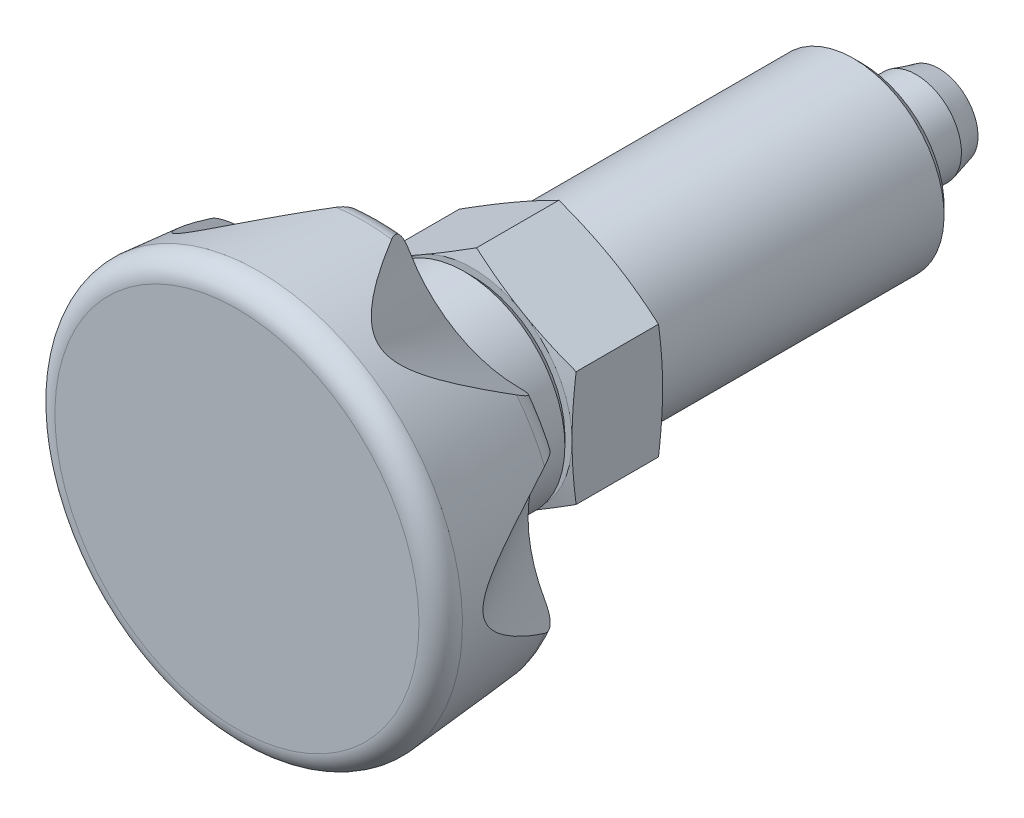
ISO-10303-21;
HEADER;
FILE_DESCRIPTION(('STEP AP214'),'2;1');
FILE_NAME('part.step','',(''),(''),'','','');
FILE_SCHEMA(('AUTOMOTIVE_DESIGN { 1 0 10303 214 1 1 1 1 }'));
ENDSEC;
DATA;
#1=APPLICATION_CONTEXT('core data for automotive mechanical design processes');
#2=APPLICATION_PROTOCOL_DEFINITION('international standard','automotive_design',2000,#1);
#3=PRODUCT_CONTEXT('',#1,'mechanical');
#4=PRODUCT('Part','Part','',(#3));
#5=PRODUCT_RELATED_PRODUCT_CATEGORY('part','',(#4));
#6=PRODUCT_DEFINITION_FORMATION('','',#4);
#7=PRODUCT_DEFINITION_CONTEXT('part definition',#1,'design');
#8=PRODUCT_DEFINITION('design','',#6,#7);
#9=PRODUCT_DEFINITION_SHAPE('','',#8);
#10=(LENGTH_UNIT() NAMED_UNIT(*) SI_UNIT(.MILLI.,.METRE.));
#11=(NAMED_UNIT(*) PLANE_ANGLE_UNIT() SI_UNIT($,.RADIAN.));
#12=(NAMED_UNIT(*) SI_UNIT($,.STERADIAN.) SOLID_ANGLE_UNIT());
#13=UNCERTAINTY_MEASURE_WITH_UNIT(LENGTH_MEASURE(1.E-05),#10,'distance_accuracy_value','');
#14=(GEOMETRIC_REPRESENTATION_CONTEXT(3) GLOBAL_UNCERTAINTY_ASSIGNED_CONTEXT((#13)) GLOBAL_UNIT_ASSIGNED_CONTEXT((#10,
#11,#12)) REPRESENTATION_CONTEXT('',''));
#15=CARTESIAN_POINT('',(0.,0.,0.));
#16=DIRECTION('',(0.,0.,1.));
#17=DIRECTION('',(1.,0.,0.));
#18=AXIS2_PLACEMENT_3D('',#15,#16,#17);
#19=CARTESIAN_POINT('',(11.,0.,10.));
#20=DIRECTION('',(0.,0.,1.));
#21=DIRECTION('',(0.,-1.,0.));
#22=AXIS2_PLACEMENT_3D('',#19,#20,#21);
#23=PLANE('',#22);
#24=CARTESIAN_POINT('',(0.,0.,10.));
#25=DIRECTION('',(0.,0.,-1.));
#26=DIRECTION('',(0.,1.,0.));
#27=AXIS2_PLACEMENT_3D('',#24,#25,#26);
#28=CIRCLE('',#27,11.);
#29=CARTESIAN_POINT('',(11.,0.,10.));
#30=VERTEX_POINT('',#29);
#31=CARTESIAN_POINT('',(5.5,-9.52627944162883,10.));
#32=VERTEX_POINT('',#31);
#33=EDGE_CURVE('E229',#30,#32,#28,.T.);
#34=ORIENTED_EDGE('',*,*,#33,.F.);
#35=CARTESIAN_POINT('',(5.5,9.52627944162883,10.));
#36=VERTEX_POINT('',#35);
#37=EDGE_CURVE('E200',#36,#30,#28,.T.);
#38=ORIENTED_EDGE('',*,*,#37,.F.);
#39=CARTESIAN_POINT('',(-5.5,9.52627944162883,10.));
#40=VERTEX_POINT('',#39);
#41=EDGE_CURVE('E572',#40,#36,#28,.T.);
#42=ORIENTED_EDGE('',*,*,#41,.F.);
#43=CARTESIAN_POINT('',(-11.,0.,10.));
#44=VERTEX_POINT('',#43);
#45=EDGE_CURVE('E561',#44,#40,#28,.T.);
#46=ORIENTED_EDGE('',*,*,#45,.F.);
#47=CARTESIAN_POINT('',(-5.5,-9.52627944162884,10.));
#48=VERTEX_POINT('',#47);
#49=EDGE_CURVE('E568',#48,#44,#28,.T.);
#50=ORIENTED_EDGE('',*,*,#49,.F.);
#51=EDGE_CURVE('E573',#32,#48,#28,.T.);
#52=ORIENTED_EDGE('',*,*,#51,.F.);
#53=EDGE_LOOP('',(#34,#38,#42,#46,#50,#52));
#54=FACE_BOUND('',#53,.T.);
#55=CARTESIAN_POINT('',(0.,0.,10.));
#56=DIRECTION('',(0.,0.,1.));
#57=DIRECTION('',(0.,-1.,0.));
#58=AXIS2_PLACEMENT_3D('',#55,#56,#57);
#59=CIRCLE('',#58,10.2111111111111);
#60=CARTESIAN_POINT('',(0.,-10.2111111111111,10.));
#61=VERTEX_POINT('',#60);
#62=EDGE_CURVE('E9',#61,#61,#59,.F.);
#63=ORIENTED_EDGE('',*,*,#62,.T.);
#64=EDGE_LOOP('',(#63));
#65=FACE_BOUND('',#64,.T.);
#66=ADVANCED_FACE('F14',(#54,#65),#23,.T.);
#67=CARTESIAN_POINT('',(0.,0.,0.));
#68=DIRECTION('',(0.,0.,1.));
#69=DIRECTION('',(0.,-1.,0.));
#70=AXIS2_PLACEMENT_3D('',#67,#68,#69);
#71=CONICAL_SURFACE('',#70,11.,1.30899693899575);
#72=CARTESIAN_POINT('',(11.,16.9707913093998,2.4715473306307));
#73=CARTESIAN_POINT('',(11.,16.4697432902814,2.3589175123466));
#74=CARTESIAN_POINT('',(11.,15.9683865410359,2.24763700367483));
#75=CARTESIAN_POINT('',(11.,14.9649035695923,2.02850329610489));
#76=CARTESIAN_POINT('',(11.,14.4627773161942,1.92065024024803));
#77=CARTESIAN_POINT('',(11.,13.4571794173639,1.70901163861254));
#78=CARTESIAN_POINT('',(11.,12.9537069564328,1.60522995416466));
#79=CARTESIAN_POINT('',(11.,11.9457263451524,1.40282696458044));
#80=CARTESIAN_POINT('',(11.,11.4412182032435,1.30420561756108));
#81=CARTESIAN_POINT('',(11.,10.4350769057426,1.1141293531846));
#82=CARTESIAN_POINT('',(11.,9.93345353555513,1.02262288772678));
#83=CARTESIAN_POINT('',(11.,8.92883562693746,0.847410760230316));
#84=CARTESIAN_POINT('',(11.,8.42584108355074,0.76370512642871));
#85=CARTESIAN_POINT('',(11.,7.41838009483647,0.605946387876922));
#86=CARTESIAN_POINT('',(11.,6.91391380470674,0.531892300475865));
#87=CARTESIAN_POINT('',(11.,5.90337087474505,0.395586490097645));
#88=CARTESIAN_POINT('',(11.,5.39729423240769,0.333334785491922));
#89=CARTESIAN_POINT('',(11.,4.37774018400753,0.222357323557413));
#90=CARTESIAN_POINT('',(11.,3.8642446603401,0.173795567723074));
#91=CARTESIAN_POINT('',(11.,2.83592640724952,0.0935261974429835));
#92=CARTESIAN_POINT('',(11.,2.32110370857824,0.061818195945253));
#93=CARTESIAN_POINT('',(11.,1.29088590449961,0.0171032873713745));
#94=CARTESIAN_POINT('',(11.,0.77549120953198,0.00408711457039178));
#95=CARTESIAN_POINT('',(11.,-0.255423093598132,-0.00244024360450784));
#96=CARTESIAN_POINT('',(11.,-0.770942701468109,0.00404852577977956));
#97=CARTESIAN_POINT('',(11.,-1.80334451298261,0.0361707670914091));
#98=CARTESIAN_POINT('',(11.,-2.32022439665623,0.0618772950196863));
#99=CARTESIAN_POINT('',(11.,-3.35279153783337,0.130955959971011));
#100=CARTESIAN_POINT('',(11.,-3.86847876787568,0.17432849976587));
#101=CARTESIAN_POINT('',(11.,-4.89865622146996,0.276506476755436));
#102=CARTESIAN_POINT('',(11.,-5.41314537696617,0.335322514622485));
#103=CARTESIAN_POINT('',(11.,-6.4404604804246,0.465887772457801));
#104=CARTESIAN_POINT('',(11.,-6.95328642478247,0.537637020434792));
#105=CARTESIAN_POINT('',(11.,-7.97450110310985,0.691296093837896));
#106=CARTESIAN_POINT('',(11.,-8.48289869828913,0.773147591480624));
#107=CARTESIAN_POINT('',(11.,-9.49826498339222,0.945322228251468));
#108=CARTESIAN_POINT('',(11.,-10.0052336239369,1.03564565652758));
#109=CARTESIAN_POINT('',(11.,-11.0179655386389,1.22312202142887));
#110=CARTESIAN_POINT('',(11.,-11.5237286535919,1.32027581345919));
#111=CARTESIAN_POINT('',(11.,-12.5341584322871,1.52007575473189));
#112=CARTESIAN_POINT('',(11.,-13.0388251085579,1.62272184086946));
#113=CARTESIAN_POINT('',(11.,-14.0473954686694,1.83249190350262));
#114=CARTESIAN_POINT('',(11.,-14.5512988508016,1.93961732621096));
#115=CARTESIAN_POINT('',(11.,-15.5583216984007,2.1574880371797));
#116=CARTESIAN_POINT('',(11.,-16.0614411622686,2.26823333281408));
#117=CARTESIAN_POINT('',(11.,-17.0669773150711,2.49268214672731));
#118=CARTESIAN_POINT('',(11.,-17.5693940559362,2.60638543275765));
#119=CARTESIAN_POINT('',(11.,-18.5736660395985,2.83624748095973));
#120=CARTESIAN_POINT('',(11.,-19.0755212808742,2.95240624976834));
#121=CARTESIAN_POINT('',(11.,-20.569629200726,3.30141993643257));
#122=CARTESIAN_POINT('',(11.,-21.5611901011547,3.53723580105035));
#123=CARTESIAN_POINT('',(11.,-23.542969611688,4.01451440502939));
#124=CARTESIAN_POINT('',(11.,-24.5331881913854,4.25597727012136));
#125=CARTESIAN_POINT('',(11.,-26.5112018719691,4.74270476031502));
#126=CARTESIAN_POINT('',(11.,-27.4989984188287,4.98796351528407));
#127=CARTESIAN_POINT('',(11.,-28.9800909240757,5.35818113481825));
#128=CARTESIAN_POINT('',(11.,-29.4736792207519,5.48197302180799));
#129=CARTESIAN_POINT('',(11.,-30.460682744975,5.73024283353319));
#130=CARTESIAN_POINT('',(11.,-30.9540979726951,5.85472075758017));
#131=CARTESIAN_POINT('',(11.,-31.44743806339,5.9794958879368));
#132=B_SPLINE_CURVE_WITH_KNOTS('',3,(#72,#73,#74,#75,#76,#77,#78,#79,#80,#81,#82,#83,#84,#85,
#86,#87,#88,#89,#90,#91,#92,#93,#94,#95,#96,#97,#98,#99,#100,#101,#102,#103,#104,#105,#106,#107,
#108,#109,#110,#111,#112,#113,#114,#115,#116,#117,#118,#119,#120,#121,#122,#123,#124,#125,#126,
#127,#128,#129,#130,#131),.UNSPECIFIED.,.F.,.F.,(4,2,2,2,2,2,2,2,2,2,2,2,2,2,2,2,2,2,2,2,2,2,2,
2,2,2,2,2,2,4),(0.,1.5406589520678,3.08138211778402,4.62353283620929,6.16567103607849,
7.69532606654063,9.2249866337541,10.7544913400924,12.283998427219,13.8311173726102,
15.3782007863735,16.9245170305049,18.470829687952,20.0230507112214,21.5753071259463,
23.128631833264,24.68195990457,26.2267057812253,27.7715043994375,29.3164968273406,
30.8614715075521,32.4069489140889,33.9524294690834,35.4977890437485,37.0431527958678,
40.1007750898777,43.1584655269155,46.2118244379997,47.7384493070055,49.2650726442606),.UNSPECIFIED.);
#133=CARTESIAN_POINT('',(11.,-6.35085296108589,0.455970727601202));
#134=VERTEX_POINT('',#133);
#135=CARTESIAN_POINT('',(11.,0.,0.));
#136=VERTEX_POINT('',#135);
#137=EDGE_CURVE('E499',#134,#136,#132,.F.);
#138=ORIENTED_EDGE('',*,*,#137,.F.);
#139=CARTESIAN_POINT('',(-0.0002,-12.7018213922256,0.456001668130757));
#140=CARTESIAN_POINT('',(0.456618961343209,-12.4380768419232,0.385302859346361));
#141=CARTESIAN_POINT('',(0.914266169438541,-12.1738541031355,0.321120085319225));
#142=CARTESIAN_POINT('',(1.83117674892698,-11.644475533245,0.208357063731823));
#143=CARTESIAN_POINT('',(2.29044070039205,-11.3793193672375,0.159783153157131));
#144=CARTESIAN_POINT('',(3.2078003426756,-10.8496815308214,0.0810734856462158));
#145=CARTESIAN_POINT('',(3.66588983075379,-10.5852034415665,0.050843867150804));
#146=CARTESIAN_POINT('',(4.58265296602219,-10.0559099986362,0.0103090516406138));
#147=CARTESIAN_POINT('',(5.04132648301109,-9.79109472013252,0.));
#148=CARTESIAN_POINT('',(5.9586735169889,-9.26146416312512,0.));
#149=CARTESIAN_POINT('',(6.4173470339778,-8.99664888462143,0.010309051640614));
#150=CARTESIAN_POINT('',(7.3341101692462,-8.46735544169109,0.0508438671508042));
#151=CARTESIAN_POINT('',(7.7921996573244,-8.20287735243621,0.0810734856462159));
#152=CARTESIAN_POINT('',(8.70955929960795,-7.6732395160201,0.159783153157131));
#153=CARTESIAN_POINT('',(9.16882325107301,-7.40808335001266,0.208357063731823));
#154=CARTESIAN_POINT('',(10.0857338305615,-6.87870478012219,0.321120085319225));
#155=CARTESIAN_POINT('',(10.5433810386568,-6.61448204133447,0.38530285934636));
#156=CARTESIAN_POINT('',(11.0002,-6.35073749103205,0.456001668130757));
#157=B_SPLINE_CURVE_WITH_KNOTS('',3,(#139,#140,#141,#142,#143,#144,#145,#146,#147,#148,#149,
#150,#151,#152,#153,#154,#155,#156),.UNSPECIFIED.,.F.,.F.,(4,2,2,2,2,2,2,2,4),(0.,
1.59670121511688,3.19404985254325,4.78315492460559,6.37195247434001,7.96075002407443,
9.54985509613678,11.1472037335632,12.74390494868),.UNSPECIFIED.);
#158=CARTESIAN_POINT('',(5.5,-9.52627944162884,0.));
#159=VERTEX_POINT('',#158);
#160=EDGE_CURVE('E528',#159,#134,#157,.T.);
#161=ORIENTED_EDGE('',*,*,#160,.F.);
#162=CARTESIAN_POINT('',(0.,0.,0.));
#163=DIRECTION('',(0.,0.,-1.));
#164=DIRECTION('',(0.,1.,0.));
#165=AXIS2_PLACEMENT_3D('',#162,#163,#164);
#166=CIRCLE('',#165,11.);
#167=EDGE_CURVE('E224',#136,#159,#166,.T.);
#168=ORIENTED_EDGE('',*,*,#167,.F.);
#169=EDGE_LOOP('',(#138,#161,#168));
#170=FACE_BOUND('',#169,.T.);
#171=ADVANCED_FACE('F614',(#170),#71,.T.);
#172=CARTESIAN_POINT('',(11.,6.35085296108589,0.455970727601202));
#173=VERTEX_POINT('',#172);
#174=EDGE_CURVE('E500',#136,#173,#132,.F.);
#175=ORIENTED_EDGE('',*,*,#174,.F.);
#176=CARTESIAN_POINT('',(5.5,9.52627944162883,0.));
#177=VERTEX_POINT('',#176);
#178=EDGE_CURVE('E216',#177,#136,#166,.T.);
#179=ORIENTED_EDGE('',*,*,#178,.F.);
#180=CARTESIAN_POINT('',(11.0002,6.35073749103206,0.456001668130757));
#181=CARTESIAN_POINT('',(10.5433810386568,6.61448204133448,0.385302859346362));
#182=CARTESIAN_POINT('',(10.0857338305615,6.8787047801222,0.321120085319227));
#183=CARTESIAN_POINT('',(9.16882325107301,7.40808335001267,0.208357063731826));
#184=CARTESIAN_POINT('',(8.70955929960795,7.67323951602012,0.159783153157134));
#185=CARTESIAN_POINT('',(7.7921996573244,8.20287735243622,0.0810734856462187));
#186=CARTESIAN_POINT('',(7.3341101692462,8.4673554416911,0.0508438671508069));
#187=CARTESIAN_POINT('',(6.4173470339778,8.99664888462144,0.0103090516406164));
#188=CARTESIAN_POINT('',(5.9586735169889,9.26146416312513,0.));
#189=CARTESIAN_POINT('',(5.0413264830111,9.79109472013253,0.));
#190=CARTESIAN_POINT('',(4.58265296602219,10.0559099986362,0.0103090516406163));
#191=CARTESIAN_POINT('',(3.6658898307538,10.5852034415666,0.0508438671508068));
#192=CARTESIAN_POINT('',(3.2078003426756,10.8496815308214,0.0810734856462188));
#193=CARTESIAN_POINT('',(2.29044070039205,11.3793193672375,0.159783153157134));
#194=CARTESIAN_POINT('',(1.83117674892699,11.644475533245,0.208357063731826));
#195=CARTESIAN_POINT('',(0.914266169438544,12.1738541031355,0.321120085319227));
#196=CARTESIAN_POINT('',(0.456618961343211,12.4380768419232,0.385302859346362));
#197=CARTESIAN_POINT('',(-0.000200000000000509,12.7018213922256,0.456001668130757));
#198=B_SPLINE_CURVE_WITH_KNOTS('',3,(#180,#181,#182,#183,#184,#185,#186,#187,#188,#189,#190,
#191,#192,#193,#194,#195,#196,#197),.UNSPECIFIED.,.F.,.F.,(4,2,2,2,2,2,2,2,4),(0.,
1.59670121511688,3.19404985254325,4.78315492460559,6.37195247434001,7.96075002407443,
9.54985509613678,11.1472037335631,12.74390494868),.UNSPECIFIED.);
#199=EDGE_CURVE('E587',#173,#177,#198,.T.);
#200=ORIENTED_EDGE('',*,*,#199,.F.);
#201=EDGE_LOOP('',(#175,#179,#200));
#202=FACE_BOUND('',#201,.T.);
#203=ADVANCED_FACE('F619',(#202),#71,.T.);
#204=CARTESIAN_POINT('',(0.,12.7017059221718,0.455970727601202));
#205=VERTEX_POINT('',#204);
#206=EDGE_CURVE('E212',#177,#205,#198,.T.);
#207=ORIENTED_EDGE('',*,*,#206,.F.);
#208=CARTESIAN_POINT('',(-5.5,9.52627944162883,0.));
#209=VERTEX_POINT('',#208);
#210=EDGE_CURVE('E210',#209,#177,#166,.T.);
#211=ORIENTED_EDGE('',*,*,#210,.F.);
#212=CARTESIAN_POINT('',(0.0002,12.7018213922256,0.456001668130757));
#213=CARTESIAN_POINT('',(-0.456618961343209,12.4380768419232,0.385302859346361));
#214=CARTESIAN_POINT('',(-0.914266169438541,12.1738541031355,0.321120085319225));
#215=CARTESIAN_POINT('',(-1.83117674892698,11.644475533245,0.208357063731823));
#216=CARTESIAN_POINT('',(-2.29044070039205,11.3793193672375,0.159783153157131));
#217=CARTESIAN_POINT('',(-3.2078003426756,10.8496815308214,0.0810734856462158));
#218=CARTESIAN_POINT('',(-3.66588983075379,10.5852034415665,0.050843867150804));
#219=CARTESIAN_POINT('',(-4.58265296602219,10.0559099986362,0.0103090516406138));
#220=CARTESIAN_POINT('',(-5.04132648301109,9.79109472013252,0.));
#221=CARTESIAN_POINT('',(-5.9586735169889,9.26146416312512,0.));
#222=CARTESIAN_POINT('',(-6.4173470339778,8.99664888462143,0.010309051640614));
#223=CARTESIAN_POINT('',(-7.3341101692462,8.46735544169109,0.0508438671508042));
#224=CARTESIAN_POINT('',(-7.7921996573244,8.20287735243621,0.0810734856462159));
#225=CARTESIAN_POINT('',(-8.70955929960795,7.6732395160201,0.159783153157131));
#226=CARTESIAN_POINT('',(-9.16882325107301,7.40808335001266,0.208357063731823));
#227=CARTESIAN_POINT('',(-10.0857338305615,6.87870478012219,0.321120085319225));
#228=CARTESIAN_POINT('',(-10.5433810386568,6.61448204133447,0.38530285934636));
#229=CARTESIAN_POINT('',(-11.0002,6.35073749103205,0.456001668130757));
#230=B_SPLINE_CURVE_WITH_KNOTS('',3,(#212,#213,#214,#215,#216,#217,#218,#219,#220,#221,#222,
#223,#224,#225,#226,#227,#228,#229),.UNSPECIFIED.,.F.,.F.,(4,2,2,2,2,2,2,2,4),(0.,
1.59670121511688,3.19404985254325,4.78315492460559,6.37195247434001,7.96075002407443,
9.54985509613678,11.1472037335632,12.74390494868),.UNSPECIFIED.);
#231=EDGE_CURVE('E191',#205,#209,#230,.T.);
#232=ORIENTED_EDGE('',*,*,#231,.F.);
#233=EDGE_LOOP('',(#207,#211,#232));
#234=FACE_BOUND('',#233,.T.);
#235=ADVANCED_FACE('F211',(#234),#71,.T.);
#236=CARTESIAN_POINT('',(0.,-12.7017059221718,0.455970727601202));
#237=VERTEX_POINT('',#236);
#238=EDGE_CURVE('E533',#237,#159,#157,.T.);
#239=ORIENTED_EDGE('',*,*,#238,.F.);
#240=CARTESIAN_POINT('',(-11.0002,-6.35073749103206,0.456001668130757));
#241=CARTESIAN_POINT('',(-10.5433810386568,-6.61448204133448,0.385302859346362));
#242=CARTESIAN_POINT('',(-10.0857338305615,-6.8787047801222,0.321120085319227));
#243=CARTESIAN_POINT('',(-9.16882325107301,-7.40808335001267,0.208357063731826));
#244=CARTESIAN_POINT('',(-8.70955929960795,-7.67323951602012,0.159783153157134));
#245=CARTESIAN_POINT('',(-7.7921996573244,-8.20287735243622,0.0810734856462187));
#246=CARTESIAN_POINT('',(-7.3341101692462,-8.4673554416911,0.0508438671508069));
#247=CARTESIAN_POINT('',(-6.4173470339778,-8.99664888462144,0.0103090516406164));
#248=CARTESIAN_POINT('',(-5.9586735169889,-9.26146416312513,0.));
#249=CARTESIAN_POINT('',(-5.0413264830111,-9.79109472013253,0.));
#250=CARTESIAN_POINT('',(-4.58265296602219,-10.0559099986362,0.0103090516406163));
#251=CARTESIAN_POINT('',(-3.6658898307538,-10.5852034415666,0.0508438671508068));
#252=CARTESIAN_POINT('',(-3.2078003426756,-10.8496815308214,0.0810734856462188));
#253=CARTESIAN_POINT('',(-2.29044070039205,-11.3793193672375,0.159783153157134));
#254=CARTESIAN_POINT('',(-1.83117674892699,-11.644475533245,0.208357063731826));
#255=CARTESIAN_POINT('',(-0.914266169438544,-12.1738541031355,0.321120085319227));
#256=CARTESIAN_POINT('',(-0.456618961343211,-12.4380768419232,0.385302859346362));
#257=CARTESIAN_POINT('',(0.000200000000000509,-12.7018213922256,0.456001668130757));
#258=B_SPLINE_CURVE_WITH_KNOTS('',3,(#240,#241,#242,#243,#244,#245,#246,#247,#248,#249,#250,
#251,#252,#253,#254,#255,#256,#257),.UNSPECIFIED.,.F.,.F.,(4,2,2,2,2,2,2,2,4),(0.,
1.59670121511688,3.19404985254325,4.78315492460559,6.37195247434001,7.96075002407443,
9.54985509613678,11.1472037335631,12.74390494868),.UNSPECIFIED.);
#259=CARTESIAN_POINT('',(-5.5,-9.52627944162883,0.));
#260=VERTEX_POINT('',#259);
#261=EDGE_CURVE('E543',#260,#237,#258,.T.);
#262=ORIENTED_EDGE('',*,*,#261,.F.);
#263=EDGE_CURVE('E223',#159,#260,#166,.T.);
#264=ORIENTED_EDGE('',*,*,#263,.F.);
#265=EDGE_LOOP('',(#239,#262,#264));
#266=FACE_BOUND('',#265,.T.);
#267=ADVANCED_FACE('F634',(#266),#71,.T.);
#268=CARTESIAN_POINT('',(-11.,6.35085296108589,0.455970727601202));
#269=VERTEX_POINT('',#268);
#270=EDGE_CURVE('E194',#209,#269,#230,.T.);
#271=ORIENTED_EDGE('',*,*,#270,.F.);
#272=CARTESIAN_POINT('',(-11.,0.,0.));
#273=VERTEX_POINT('',#272);
#274=EDGE_CURVE('E206',#273,#209,#166,.T.);
#275=ORIENTED_EDGE('',*,*,#274,.F.);
#276=CARTESIAN_POINT('',(-11.,16.9707913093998,2.4715473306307));
#277=CARTESIAN_POINT('',(-11.,16.4697432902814,2.3589175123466));
#278=CARTESIAN_POINT('',(-11.,15.9683865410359,2.24763700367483));
#279=CARTESIAN_POINT('',(-11.,14.9649035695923,2.02850329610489));
#280=CARTESIAN_POINT('',(-11.,14.4627773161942,1.92065024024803));
#281=CARTESIAN_POINT('',(-11.,13.4571794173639,1.70901163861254));
#282=CARTESIAN_POINT('',(-11.,12.9537069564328,1.60522995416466));
#283=CARTESIAN_POINT('',(-11.,11.9457263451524,1.40282696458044));
#284=CARTESIAN_POINT('',(-11.,11.4412182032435,1.30420561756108));
#285=CARTESIAN_POINT('',(-11.,10.4350769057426,1.1141293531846));
#286=CARTESIAN_POINT('',(-11.,9.93345353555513,1.02262288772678));
#287=CARTESIAN_POINT('',(-11.,8.92883562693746,0.847410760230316));
#288=CARTESIAN_POINT('',(-11.,8.42584108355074,0.76370512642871));
#289=CARTESIAN_POINT('',(-11.,7.41838009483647,0.605946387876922));
#290=CARTESIAN_POINT('',(-11.,6.91391380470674,0.531892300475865));
#291=CARTESIAN_POINT('',(-11.,5.90337087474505,0.395586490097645));
#292=CARTESIAN_POINT('',(-11.,5.39729423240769,0.333334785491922));
#293=CARTESIAN_POINT('',(-11.,4.37774018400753,0.222357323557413));
#294=CARTESIAN_POINT('',(-11.,3.8642446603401,0.173795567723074));
#295=CARTESIAN_POINT('',(-11.,2.83592640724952,0.0935261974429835));
#296=CARTESIAN_POINT('',(-11.,2.32110370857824,0.061818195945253));
#297=CARTESIAN_POINT('',(-11.,1.29088590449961,0.0171032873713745));
#298=CARTESIAN_POINT('',(-11.,0.77549120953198,0.00408711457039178));
#299=CARTESIAN_POINT('',(-11.,-0.255423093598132,-0.00244024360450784));
#300=CARTESIAN_POINT('',(-11.,-0.770942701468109,0.00404852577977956));
#301=CARTESIAN_POINT('',(-11.,-1.80334451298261,0.0361707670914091));
#302=CARTESIAN_POINT('',(-11.,-2.32022439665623,0.0618772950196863));
#303=CARTESIAN_POINT('',(-11.,-3.35279153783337,0.130955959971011));
#304=CARTESIAN_POINT('',(-11.,-3.86847876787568,0.17432849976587));
#305=CARTESIAN_POINT('',(-11.,-4.89865622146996,0.276506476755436));
#306=CARTESIAN_POINT('',(-11.,-5.41314537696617,0.335322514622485));
#307=CARTESIAN_POINT('',(-11.,-6.4404604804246,0.465887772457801));
#308=CARTESIAN_POINT('',(-11.,-6.95328642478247,0.537637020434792));
#309=CARTESIAN_POINT('',(-11.,-7.97450110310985,0.691296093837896));
#310=CARTESIAN_POINT('',(-11.,-8.48289869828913,0.773147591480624));
#311=CARTESIAN_POINT('',(-11.,-9.49826498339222,0.945322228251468));
#312=CARTESIAN_POINT('',(-11.,-10.0052336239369,1.03564565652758));
#313=CARTESIAN_POINT('',(-11.,-11.0179655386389,1.22312202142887));
#314=CARTESIAN_POINT('',(-11.,-11.5237286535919,1.32027581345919));
#315=CARTESIAN_POINT('',(-11.,-12.5341584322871,1.52007575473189));
#316=CARTESIAN_POINT('',(-11.,-13.0388251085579,1.62272184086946));
#317=CARTESIAN_POINT('',(-11.,-14.0473954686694,1.83249190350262));
#318=CARTESIAN_POINT('',(-11.,-14.5512988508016,1.93961732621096));
#319=CARTESIAN_POINT('',(-11.,-15.5583216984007,2.1574880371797));
#320=CARTESIAN_POINT('',(-11.,-16.0614411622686,2.26823333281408));
#321=CARTESIAN_POINT('',(-11.,-17.0669773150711,2.49268214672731));
#322=CARTESIAN_POINT('',(-11.,-17.5693940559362,2.60638543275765));
#323=CARTESIAN_POINT('',(-11.,-18.5736660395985,2.83624748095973));
#324=CARTESIAN_POINT('',(-11.,-19.0755212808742,2.95240624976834));
#325=CARTESIAN_POINT('',(-11.,-20.569629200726,3.30141993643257));
#326=CARTESIAN_POINT('',(-11.,-21.5611901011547,3.53723580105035));
#327=CARTESIAN_POINT('',(-11.,-23.542969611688,4.01451440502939));
#328=CARTESIAN_POINT('',(-11.,-24.5331881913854,4.25597727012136));
#329=CARTESIAN_POINT('',(-11.,-26.5112018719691,4.74270476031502));
#330=CARTESIAN_POINT('',(-11.,-27.4989984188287,4.98796351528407));
#331=CARTESIAN_POINT('',(-11.,-28.9800909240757,5.35818113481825));
#332=CARTESIAN_POINT('',(-11.,-29.4736792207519,5.48197302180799));
#333=CARTESIAN_POINT('',(-11.,-30.460682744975,5.73024283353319));
#334=CARTESIAN_POINT('',(-11.,-30.9540979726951,5.85472075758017));
#335=CARTESIAN_POINT('',(-11.,-31.44743806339,5.9794958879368));
#336=B_SPLINE_CURVE_WITH_KNOTS('',3,(#276,#277,#278,#279,#280,#281,#282,#283,#284,#285,#286,
#287,#288,#289,#290,#291,#292,#293,#294,#295,#296,#297,#298,#299,#300,#301,#302,#303,#304,#305,
#306,#307,#308,#309,#310,#311,#312,#313,#314,#315,#316,#317,#318,#319,#320,#321,#322,#323,#324,
#325,#326,#327,#328,#329,#330,#331,#332,#333,#334,#335),.UNSPECIFIED.,.F.,.F.,(4,2,2,2,2,2,2,2,
2,2,2,2,2,2,2,2,2,2,2,2,2,2,2,2,2,2,2,2,2,4),(0.,1.5406589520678,3.08138211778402,
4.62353283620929,6.16567103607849,7.69532606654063,9.2249866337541,10.7544913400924,
12.283998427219,13.8311173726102,15.3782007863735,16.9245170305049,18.470829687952,
20.0230507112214,21.5753071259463,23.128631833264,24.68195990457,26.2267057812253,
27.7715043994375,29.3164968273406,30.8614715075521,32.4069489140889,33.9524294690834,
35.4977890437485,37.0431527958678,40.1007750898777,43.1584655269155,46.2118244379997,
47.7384493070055,49.2650726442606),.UNSPECIFIED.);
#337=EDGE_CURVE('E39',#269,#273,#336,.T.);
#338=ORIENTED_EDGE('',*,*,#337,.F.);
#339=EDGE_LOOP('',(#271,#275,#338));
#340=FACE_BOUND('',#339,.T.);
#341=ADVANCED_FACE('F204',(#340),#71,.T.);
#342=CARTESIAN_POINT('',(0.,0.,7.0525588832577));
#343=DIRECTION('',(0.,0.,-1.));
#344=DIRECTION('',(0.,1.,0.));
#345=AXIS2_PLACEMENT_3D('',#342,#343,#344);
#346=CONICAL_SURFACE('',#345,22.,1.30899693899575);
#347=CARTESIAN_POINT('',(-11.0002,6.35073749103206,9.5439983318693));
#348=CARTESIAN_POINT('',(-10.5433810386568,6.61448204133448,9.61469714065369));
#349=CARTESIAN_POINT('',(-10.0857338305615,6.87870478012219,9.67887991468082));
#350=CARTESIAN_POINT('',(-9.16882325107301,7.40808335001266,9.79164293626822));
#351=CARTESIAN_POINT('',(-8.70955929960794,7.67323951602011,9.84021684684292));
#352=CARTESIAN_POINT('',(-7.79219965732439,8.20287735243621,9.91892651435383));
#353=CARTESIAN_POINT('',(-7.3341101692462,8.4673554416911,9.94915613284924));
#354=CARTESIAN_POINT('',(-6.4173470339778,8.99664888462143,9.98969094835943));
#355=CARTESIAN_POINT('',(-5.9586735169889,9.26146416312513,10.));
#356=CARTESIAN_POINT('',(-5.04132648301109,9.79109472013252,10.));
#357=CARTESIAN_POINT('',(-4.58265296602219,10.0559099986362,9.98969094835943));
#358=CARTESIAN_POINT('',(-3.66588983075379,10.5852034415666,9.94915613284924));
#359=CARTESIAN_POINT('',(-3.20780034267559,10.8496815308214,9.91892651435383));
#360=CARTESIAN_POINT('',(-2.29044070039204,11.3793193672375,9.84021684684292));
#361=CARTESIAN_POINT('',(-1.83117674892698,11.644475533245,9.79164293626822));
#362=CARTESIAN_POINT('',(-0.914266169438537,12.1738541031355,9.67887991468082));
#363=CARTESIAN_POINT('',(-0.456618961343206,12.4380768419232,9.61469714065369));
#364=CARTESIAN_POINT('',(0.000200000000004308,12.7018213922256,9.5439983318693));
#365=B_SPLINE_CURVE_WITH_KNOTS('',3,(#347,#348,#349,#350,#351,#352,#353,#354,#355,#356,#357,
#358,#359,#360,#361,#362,#363,#364),.UNSPECIFIED.,.F.,.F.,(4,2,2,2,2,2,2,2,4),(0.,
1.59670121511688,3.19404985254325,4.78315492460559,6.37195247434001,7.96075002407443,
9.54985509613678,11.1472037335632,12.74390494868),.UNSPECIFIED.);
#366=CARTESIAN_POINT('',(-11.,6.35085296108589,9.5440292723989));
#367=VERTEX_POINT('',#366);
#368=EDGE_CURVE('E208',#367,#40,#365,.T.);
#369=ORIENTED_EDGE('',*,*,#368,.F.);
#370=CARTESIAN_POINT('',(-11.,16.9707913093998,7.52845266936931));
#371=CARTESIAN_POINT('',(-11.,16.4697432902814,7.64108248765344));
#372=CARTESIAN_POINT('',(-11.,15.9683865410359,7.75236299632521));
#373=CARTESIAN_POINT('',(-11.,14.9649035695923,7.97149670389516));
#374=CARTESIAN_POINT('',(-11.,14.4627773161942,8.07934975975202));
#375=CARTESIAN_POINT('',(-11.,13.4571794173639,8.2909883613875));
#376=CARTESIAN_POINT('',(-11.,12.9537069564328,8.39477004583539));
#377=CARTESIAN_POINT('',(-11.,11.9457263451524,8.5971730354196));
#378=CARTESIAN_POINT('',(-11.,11.4412182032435,8.69579438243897));
#379=CARTESIAN_POINT('',(-11.,10.4350769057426,8.88587064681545));
#380=CARTESIAN_POINT('',(-11.,9.93345353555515,8.97737711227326));
#381=CARTESIAN_POINT('',(-11.,8.92883562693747,9.15258923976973));
#382=CARTESIAN_POINT('',(-11.,8.42584108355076,9.23629487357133));
#383=CARTESIAN_POINT('',(-11.,7.41838009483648,9.39405361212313));
#384=CARTESIAN_POINT('',(-11.,6.91391380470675,9.46810769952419));
#385=CARTESIAN_POINT('',(-11.,5.90337087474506,9.60441350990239));
#386=CARTESIAN_POINT('',(-11.,5.39729423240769,9.66666521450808));
#387=CARTESIAN_POINT('',(-11.,4.37774018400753,9.77764267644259));
#388=CARTESIAN_POINT('',(-11.,3.86424466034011,9.82620443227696));
#389=CARTESIAN_POINT('',(-11.,2.83592640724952,9.90647380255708));
#390=CARTESIAN_POINT('',(-11.,2.32110370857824,9.9381818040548));
#391=CARTESIAN_POINT('',(-11.,1.2908859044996,9.98289671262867));
#392=CARTESIAN_POINT('',(-11.,0.775491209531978,9.99591288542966));
#393=CARTESIAN_POINT('',(-11.,-0.255423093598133,10.0024402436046));
#394=CARTESIAN_POINT('',(-11.,-0.77094270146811,9.99595147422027));
#395=CARTESIAN_POINT('',(-11.,-1.80334451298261,9.96382923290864));
#396=CARTESIAN_POINT('',(-11.,-2.32022439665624,9.93812270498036));
#397=CARTESIAN_POINT('',(-11.,-3.35279153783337,9.86904404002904));
#398=CARTESIAN_POINT('',(-11.,-3.86847876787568,9.82567150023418));
#399=CARTESIAN_POINT('',(-11.,-4.89865622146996,9.72349352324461));
#400=CARTESIAN_POINT('',(-11.,-5.41314537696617,9.66467748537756));
#401=CARTESIAN_POINT('',(-11.,-6.4404604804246,9.53411222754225));
#402=CARTESIAN_POINT('',(-11.,-6.95328642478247,9.46236297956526));
#403=CARTESIAN_POINT('',(-11.,-7.97450110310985,9.30870390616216));
#404=CARTESIAN_POINT('',(-11.,-8.48289869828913,9.22685240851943));
#405=CARTESIAN_POINT('',(-11.,-9.49826498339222,9.05467777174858));
#406=CARTESIAN_POINT('',(-11.,-10.0052336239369,8.96435434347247));
#407=CARTESIAN_POINT('',(-11.,-11.0179655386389,8.77687797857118));
#408=CARTESIAN_POINT('',(-11.,-11.5237286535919,8.67972418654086));
#409=CARTESIAN_POINT('',(-11.,-12.5341584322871,8.47992424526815));
#410=CARTESIAN_POINT('',(-11.,-13.0388251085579,8.37727815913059));
#411=CARTESIAN_POINT('',(-11.,-14.0473954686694,8.16750809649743));
#412=CARTESIAN_POINT('',(-11.,-14.5512988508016,8.06038267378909));
#413=CARTESIAN_POINT('',(-11.,-15.5583216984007,7.84251196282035));
#414=CARTESIAN_POINT('',(-11.,-16.0614411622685,7.73176666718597));
#415=CARTESIAN_POINT('',(-11.,-17.0669773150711,7.50731785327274));
#416=CARTESIAN_POINT('',(-11.,-17.5693940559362,7.39361456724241));
#417=CARTESIAN_POINT('',(-11.,-18.5736660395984,7.16375251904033));
#418=CARTESIAN_POINT('',(-11.,-19.0755212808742,7.04759375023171));
#419=CARTESIAN_POINT('',(-11.,-20.5696292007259,6.69858006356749));
#420=CARTESIAN_POINT('',(-11.,-21.5611901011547,6.46276419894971));
#421=CARTESIAN_POINT('',(-11.,-23.542969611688,5.98548559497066));
#422=CARTESIAN_POINT('',(-11.,-24.5331881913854,5.74402272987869));
#423=CARTESIAN_POINT('',(-11.,-26.5112018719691,5.25729523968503));
#424=CARTESIAN_POINT('',(-11.,-27.4989984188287,5.01203648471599));
#425=CARTESIAN_POINT('',(-11.,-28.9800909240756,4.6418188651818));
#426=CARTESIAN_POINT('',(-11.,-29.4736792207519,4.51802697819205));
#427=CARTESIAN_POINT('',(-11.,-30.460682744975,4.26975716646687));
#428=CARTESIAN_POINT('',(-11.,-30.9540979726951,4.1452792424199));
#429=CARTESIAN_POINT('',(-11.,-31.44743806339,4.02050411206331));
#430=B_SPLINE_CURVE_WITH_KNOTS('',3,(#370,#371,#372,#373,#374,#375,#376,#377,#378,#379,#380,
#381,#382,#383,#384,#385,#386,#387,#388,#389,#390,#391,#392,#393,#394,#395,#396,#397,#398,#399,
#400,#401,#402,#403,#404,#405,#406,#407,#408,#409,#410,#411,#412,#413,#414,#415,#416,#417,#418,
#419,#420,#421,#422,#423,#424,#425,#426,#427,#428,#429),.UNSPECIFIED.,.F.,.F.,(4,2,2,2,2,2,2,2,
2,2,2,2,2,2,2,2,2,2,2,2,2,2,2,2,2,2,2,2,2,4),(0.,1.5406589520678,3.08138211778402,
4.62353283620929,6.16567103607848,7.69532606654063,9.2249866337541,10.7544913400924,
12.283998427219,13.8311173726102,15.3782007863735,16.9245170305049,18.470829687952,
20.0230507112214,21.5753071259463,23.128631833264,24.68195990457,26.2267057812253,
27.7715043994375,29.3164968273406,30.861471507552,32.4069489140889,33.9524294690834,
35.4977890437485,37.0431527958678,40.1007750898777,43.1584655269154,46.2118244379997,
47.7384493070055,49.2650726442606),.UNSPECIFIED.);
#431=EDGE_CURVE('E127',#44,#367,#430,.F.);
#432=ORIENTED_EDGE('',*,*,#431,.F.);
#433=ORIENTED_EDGE('',*,*,#45,.T.);
#434=EDGE_LOOP('',(#369,#432,#433));
#435=FACE_BOUND('',#434,.T.);
#436=ADVANCED_FACE('F458',(#435),#346,.T.);
#437=CARTESIAN_POINT('',(0.,12.7017059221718,9.5440292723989));
#438=VERTEX_POINT('',#437);
#439=EDGE_CURVE('E586',#40,#438,#365,.T.);
#440=ORIENTED_EDGE('',*,*,#439,.F.);
#441=ORIENTED_EDGE('',*,*,#41,.T.);
#442=CARTESIAN_POINT('',(-0.000199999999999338,12.7018213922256,9.5439983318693));
#443=CARTESIAN_POINT('',(0.456618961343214,12.4380768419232,9.61469714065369));
#444=CARTESIAN_POINT('',(0.914266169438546,12.1738541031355,9.67887991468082));
#445=CARTESIAN_POINT('',(1.83117674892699,11.644475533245,9.79164293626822));
#446=CARTESIAN_POINT('',(2.29044070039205,11.3793193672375,9.84021684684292));
#447=CARTESIAN_POINT('',(3.2078003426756,10.8496815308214,9.91892651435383));
#448=CARTESIAN_POINT('',(3.6658898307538,10.5852034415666,9.94915613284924));
#449=CARTESIAN_POINT('',(4.5826529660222,10.0559099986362,9.98969094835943));
#450=CARTESIAN_POINT('',(5.0413264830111,9.79109472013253,10.));
#451=CARTESIAN_POINT('',(5.95867351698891,9.26146416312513,10.));
#452=CARTESIAN_POINT('',(6.41734703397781,8.99664888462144,9.98969094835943));
#453=CARTESIAN_POINT('',(7.33411016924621,8.4673554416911,9.94915613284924));
#454=CARTESIAN_POINT('',(7.7921996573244,8.20287735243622,9.91892651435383));
#455=CARTESIAN_POINT('',(8.70955929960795,7.67323951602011,9.84021684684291));
#456=CARTESIAN_POINT('',(9.16882325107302,7.40808335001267,9.79164293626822));
#457=CARTESIAN_POINT('',(10.0857338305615,6.8787047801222,9.67887991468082));
#458=CARTESIAN_POINT('',(10.5433810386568,6.61448204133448,9.61469714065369));
#459=CARTESIAN_POINT('',(11.0002,6.35073749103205,9.5439983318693));
#460=B_SPLINE_CURVE_WITH_KNOTS('',3,(#442,#443,#444,#445,#446,#447,#448,#449,#450,#451,#452,
#453,#454,#455,#456,#457,#458,#459),.UNSPECIFIED.,.F.,.F.,(4,2,2,2,2,2,2,2,4),(0.,
1.59670121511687,3.19404985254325,4.78315492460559,6.37195247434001,7.96075002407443,
9.54985509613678,11.1472037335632,12.74390494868),.UNSPECIFIED.);
#461=EDGE_CURVE('E498',#438,#36,#460,.T.);
#462=ORIENTED_EDGE('',*,*,#461,.F.);
#463=EDGE_LOOP('',(#440,#441,#462));
#464=FACE_BOUND('',#463,.T.);
#465=ADVANCED_FACE('F585',(#464),#346,.T.);
#466=CARTESIAN_POINT('',(11.,6.35085296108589,9.5440292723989));
#467=VERTEX_POINT('',#466);
#468=EDGE_CURVE('E491',#36,#467,#460,.T.);
#469=ORIENTED_EDGE('',*,*,#468,.F.);
#470=ORIENTED_EDGE('',*,*,#37,.T.);
#471=CARTESIAN_POINT('',(11.,16.9707913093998,7.52845266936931));
#472=CARTESIAN_POINT('',(11.,16.4697432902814,7.64108248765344));
#473=CARTESIAN_POINT('',(11.,15.9683865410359,7.75236299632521));
#474=CARTESIAN_POINT('',(11.,14.9649035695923,7.97149670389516));
#475=CARTESIAN_POINT('',(11.,14.4627773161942,8.07934975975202));
#476=CARTESIAN_POINT('',(11.,13.4571794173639,8.2909883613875));
#477=CARTESIAN_POINT('',(11.,12.9537069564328,8.39477004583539));
#478=CARTESIAN_POINT('',(11.,11.9457263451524,8.5971730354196));
#479=CARTESIAN_POINT('',(11.,11.4412182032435,8.69579438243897));
#480=CARTESIAN_POINT('',(11.,10.4350769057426,8.88587064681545));
#481=CARTESIAN_POINT('',(11.,9.93345353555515,8.97737711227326));
#482=CARTESIAN_POINT('',(11.,8.92883562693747,9.15258923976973));
#483=CARTESIAN_POINT('',(11.,8.42584108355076,9.23629487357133));
#484=CARTESIAN_POINT('',(11.,7.41838009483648,9.39405361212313));
#485=CARTESIAN_POINT('',(11.,6.91391380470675,9.46810769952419));
#486=CARTESIAN_POINT('',(11.,5.90337087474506,9.60441350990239));
#487=CARTESIAN_POINT('',(11.,5.39729423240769,9.66666521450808));
#488=CARTESIAN_POINT('',(11.,4.37774018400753,9.77764267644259));
#489=CARTESIAN_POINT('',(11.,3.86424466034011,9.82620443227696));
#490=CARTESIAN_POINT('',(11.,2.83592640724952,9.90647380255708));
#491=CARTESIAN_POINT('',(11.,2.32110370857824,9.9381818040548));
#492=CARTESIAN_POINT('',(11.,1.2908859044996,9.98289671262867));
#493=CARTESIAN_POINT('',(11.,0.775491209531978,9.99591288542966));
#494=CARTESIAN_POINT('',(11.,-0.255423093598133,10.0024402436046));
#495=CARTESIAN_POINT('',(11.,-0.77094270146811,9.99595147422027));
#496=CARTESIAN_POINT('',(11.,-1.80334451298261,9.96382923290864));
#497=CARTESIAN_POINT('',(11.,-2.32022439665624,9.93812270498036));
#498=CARTESIAN_POINT('',(11.,-3.35279153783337,9.86904404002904));
#499=CARTESIAN_POINT('',(11.,-3.86847876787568,9.82567150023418));
#500=CARTESIAN_POINT('',(11.,-4.89865622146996,9.72349352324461));
#501=CARTESIAN_POINT('',(11.,-5.41314537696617,9.66467748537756));
#502=CARTESIAN_POINT('',(11.,-6.4404604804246,9.53411222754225));
#503=CARTESIAN_POINT('',(11.,-6.95328642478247,9.46236297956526));
#504=CARTESIAN_POINT('',(11.,-7.97450110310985,9.30870390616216));
#505=CARTESIAN_POINT('',(11.,-8.48289869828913,9.22685240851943));
#506=CARTESIAN_POINT('',(11.,-9.49826498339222,9.05467777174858));
#507=CARTESIAN_POINT('',(11.,-10.0052336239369,8.96435434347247));
#508=CARTESIAN_POINT('',(11.,-11.0179655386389,8.77687797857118));
#509=CARTESIAN_POINT('',(11.,-11.5237286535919,8.67972418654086));
#510=CARTESIAN_POINT('',(11.,-12.5341584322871,8.47992424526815));
#511=CARTESIAN_POINT('',(11.,-13.0388251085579,8.37727815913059));
#512=CARTESIAN_POINT('',(11.,-14.0473954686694,8.16750809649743));
#513=CARTESIAN_POINT('',(11.,-14.5512988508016,8.06038267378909));
#514=CARTESIAN_POINT('',(11.,-15.5583216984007,7.84251196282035));
#515=CARTESIAN_POINT('',(11.,-16.0614411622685,7.73176666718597));
#516=CARTESIAN_POINT('',(11.,-17.0669773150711,7.50731785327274));
#517=CARTESIAN_POINT('',(11.,-17.5693940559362,7.39361456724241));
#518=CARTESIAN_POINT('',(11.,-18.5736660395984,7.16375251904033));
#519=CARTESIAN_POINT('',(11.,-19.0755212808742,7.04759375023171));
#520=CARTESIAN_POINT('',(11.,-20.5696292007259,6.69858006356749));
#521=CARTESIAN_POINT('',(11.,-21.5611901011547,6.46276419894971));
#522=CARTESIAN_POINT('',(11.,-23.542969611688,5.98548559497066));
#523=CARTESIAN_POINT('',(11.,-24.5331881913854,5.74402272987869));
#524=CARTESIAN_POINT('',(11.,-26.5112018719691,5.25729523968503));
#525=CARTESIAN_POINT('',(11.,-27.4989984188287,5.01203648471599));
#526=CARTESIAN_POINT('',(11.,-28.9800909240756,4.6418188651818));
#527=CARTESIAN_POINT('',(11.,-29.4736792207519,4.51802697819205));
#528=CARTESIAN_POINT('',(11.,-30.460682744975,4.26975716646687));
#529=CARTESIAN_POINT('',(11.,-30.9540979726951,4.1452792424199));
#530=CARTESIAN_POINT('',(11.,-31.44743806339,4.02050411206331));
#531=B_SPLINE_CURVE_WITH_KNOTS('',3,(#471,#472,#473,#474,#475,#476,#477,#478,#479,#480,#481,
#482,#483,#484,#485,#486,#487,#488,#489,#490,#491,#492,#493,#494,#495,#496,#497,#498,#499,#500,
#501,#502,#503,#504,#505,#506,#507,#508,#509,#510,#511,#512,#513,#514,#515,#516,#517,#518,#519,
#520,#521,#522,#523,#524,#525,#526,#527,#528,#529,#530),.UNSPECIFIED.,.F.,.F.,(4,2,2,2,2,2,2,2,
2,2,2,2,2,2,2,2,2,2,2,2,2,2,2,2,2,2,2,2,2,4),(0.,1.5406589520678,3.08138211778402,
4.62353283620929,6.16567103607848,7.69532606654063,9.2249866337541,10.7544913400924,
12.283998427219,13.8311173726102,15.3782007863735,16.9245170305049,18.470829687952,
20.0230507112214,21.5753071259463,23.128631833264,24.68195990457,26.2267057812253,
27.7715043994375,29.3164968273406,30.861471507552,32.4069489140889,33.9524294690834,
35.4977890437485,37.0431527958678,40.1007750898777,43.1584655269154,46.2118244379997,
47.7384493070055,49.2650726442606),.UNSPECIFIED.);
#532=EDGE_CURVE('E600',#467,#30,#531,.T.);
#533=ORIENTED_EDGE('',*,*,#532,.F.);
#534=EDGE_LOOP('',(#469,#470,#533));
#535=FACE_BOUND('',#534,.T.);
#536=ADVANCED_FACE('F599',(#535),#346,.T.);
#537=CARTESIAN_POINT('',(11.,-6.35085296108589,9.5440292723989));
#538=VERTEX_POINT('',#537);
#539=EDGE_CURVE('E483',#30,#538,#531,.T.);
#540=ORIENTED_EDGE('',*,*,#539,.F.);
#541=ORIENTED_EDGE('',*,*,#33,.T.);
#542=CARTESIAN_POINT('',(11.0002,-6.35073749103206,9.5439983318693));
#543=CARTESIAN_POINT('',(10.5433810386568,-6.61448204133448,9.61469714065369));
#544=CARTESIAN_POINT('',(10.0857338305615,-6.87870478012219,9.67887991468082));
#545=CARTESIAN_POINT('',(9.16882325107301,-7.40808335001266,9.79164293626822));
#546=CARTESIAN_POINT('',(8.70955929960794,-7.67323951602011,9.84021684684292));
#547=CARTESIAN_POINT('',(7.79219965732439,-8.20287735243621,9.91892651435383));
#548=CARTESIAN_POINT('',(7.3341101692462,-8.4673554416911,9.94915613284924));
#549=CARTESIAN_POINT('',(6.4173470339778,-8.99664888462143,9.98969094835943));
#550=CARTESIAN_POINT('',(5.9586735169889,-9.26146416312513,10.));
#551=CARTESIAN_POINT('',(5.04132648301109,-9.79109472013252,10.));
#552=CARTESIAN_POINT('',(4.58265296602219,-10.0559099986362,9.98969094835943));
#553=CARTESIAN_POINT('',(3.66588983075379,-10.5852034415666,9.94915613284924));
#554=CARTESIAN_POINT('',(3.20780034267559,-10.8496815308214,9.91892651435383));
#555=CARTESIAN_POINT('',(2.29044070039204,-11.3793193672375,9.84021684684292));
#556=CARTESIAN_POINT('',(1.83117674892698,-11.644475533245,9.79164293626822));
#557=CARTESIAN_POINT('',(0.914266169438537,-12.1738541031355,9.67887991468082));
#558=CARTESIAN_POINT('',(0.456618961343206,-12.4380768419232,9.61469714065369));
#559=CARTESIAN_POINT('',(-0.000200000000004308,-12.7018213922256,9.5439983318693));
#560=B_SPLINE_CURVE_WITH_KNOTS('',3,(#542,#543,#544,#545,#546,#547,#548,#549,#550,#551,#552,
#553,#554,#555,#556,#557,#558,#559),.UNSPECIFIED.,.F.,.F.,(4,2,2,2,2,2,2,2,4),(0.,
1.59670121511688,3.19404985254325,4.78315492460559,6.37195247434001,7.96075002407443,
9.54985509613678,11.1472037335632,12.74390494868),.UNSPECIFIED.);
#561=EDGE_CURVE('E534',#538,#32,#560,.T.);
#562=ORIENTED_EDGE('',*,*,#561,.F.);
#563=EDGE_LOOP('',(#540,#541,#562));
#564=FACE_BOUND('',#563,.T.);
#565=ADVANCED_FACE('F605',(#564),#346,.T.);
#566=CARTESIAN_POINT('',(0.,-12.7017059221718,9.5440292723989));
#567=VERTEX_POINT('',#566);
#568=EDGE_CURVE('E475',#32,#567,#560,.T.);
#569=ORIENTED_EDGE('',*,*,#568,.F.);
#570=ORIENTED_EDGE('',*,*,#51,.T.);
#571=CARTESIAN_POINT('',(0.000199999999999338,-12.7018213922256,9.5439983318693));
#572=CARTESIAN_POINT('',(-0.456618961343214,-12.4380768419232,9.61469714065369));
#573=CARTESIAN_POINT('',(-0.914266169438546,-12.1738541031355,9.67887991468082));
#574=CARTESIAN_POINT('',(-1.83117674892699,-11.644475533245,9.79164293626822));
#575=CARTESIAN_POINT('',(-2.29044070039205,-11.3793193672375,9.84021684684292));
#576=CARTESIAN_POINT('',(-3.2078003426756,-10.8496815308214,9.91892651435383));
#577=CARTESIAN_POINT('',(-3.6658898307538,-10.5852034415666,9.94915613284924));
#578=CARTESIAN_POINT('',(-4.5826529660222,-10.0559099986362,9.98969094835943));
#579=CARTESIAN_POINT('',(-5.0413264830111,-9.79109472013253,10.));
#580=CARTESIAN_POINT('',(-5.95867351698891,-9.26146416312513,10.));
#581=CARTESIAN_POINT('',(-6.41734703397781,-8.99664888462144,9.98969094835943));
#582=CARTESIAN_POINT('',(-7.33411016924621,-8.4673554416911,9.94915613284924));
#583=CARTESIAN_POINT('',(-7.7921996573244,-8.20287735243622,9.91892651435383));
#584=CARTESIAN_POINT('',(-8.70955929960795,-7.67323951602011,9.84021684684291));
#585=CARTESIAN_POINT('',(-9.16882325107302,-7.40808335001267,9.79164293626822));
#586=CARTESIAN_POINT('',(-10.0857338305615,-6.8787047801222,9.67887991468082));
#587=CARTESIAN_POINT('',(-10.5433810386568,-6.61448204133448,9.61469714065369));
#588=CARTESIAN_POINT('',(-11.0002,-6.35073749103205,9.5439983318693));
#589=B_SPLINE_CURVE_WITH_KNOTS('',3,(#571,#572,#573,#574,#575,#576,#577,#578,#579,#580,#581,
#582,#583,#584,#585,#586,#587,#588),.UNSPECIFIED.,.F.,.F.,(4,2,2,2,2,2,2,2,4),(0.,
1.59670121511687,3.19404985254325,4.78315492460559,6.37195247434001,7.96075002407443,
9.54985509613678,11.1472037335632,12.74390494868),.UNSPECIFIED.);
#590=EDGE_CURVE('E547',#567,#48,#589,.T.);
#591=ORIENTED_EDGE('',*,*,#590,.F.);
#592=EDGE_LOOP('',(#569,#570,#591));
#593=FACE_BOUND('',#592,.T.);
#594=ADVANCED_FACE('F459',(#593),#346,.T.);
#595=CARTESIAN_POINT('',(5.,0.,-33.));
#596=DIRECTION('',(0.,0.,-1.));
#597=DIRECTION('',(0.,1.,0.));
#598=AXIS2_PLACEMENT_3D('',#595,#596,#597);
#599=PLANE('',#598);
#600=CARTESIAN_POINT('',(0.,0.,-33.));
#601=DIRECTION('',(0.,0.,-1.));
#602=DIRECTION('',(0.,1.,0.));
#603=AXIS2_PLACEMENT_3D('',#600,#601,#602);
#604=CIRCLE('',#603,9.08);
#605=CARTESIAN_POINT('',(0.,9.08,-33.));
#606=VERTEX_POINT('',#605);
#607=EDGE_CURVE('E235',#606,#606,#604,.T.);
#608=ORIENTED_EDGE('',*,*,#607,.T.);
#609=EDGE_LOOP('',(#608));
#610=FACE_BOUND('',#609,.T.);
#611=CARTESIAN_POINT('',(0.,0.,-33.));
#612=DIRECTION('',(0.,0.,-1.));
#613=DIRECTION('',(0.,1.,0.));
#614=AXIS2_PLACEMENT_3D('',#611,#612,#613);
#615=CIRCLE('',#614,5.);
#616=CARTESIAN_POINT('',(0.,5.,-33.));
#617=VERTEX_POINT('',#616);
#618=EDGE_CURVE('E30',#617,#617,#615,.T.);
#619=ORIENTED_EDGE('',*,*,#618,.F.);
#620=EDGE_LOOP('',(#619));
#621=FACE_BOUND('',#620,.T.);
#622=ADVANCED_FACE('F261',(#610,#621),#599,.T.);
#623=CARTESIAN_POINT('',(0.,0.,-33.));
#624=DIRECTION('',(0.,0.,1.));
#625=DIRECTION('',(0.,-1.,0.));
#626=AXIS2_PLACEMENT_3D('',#623,#624,#625);
#627=CONICAL_SURFACE('',#626,9.08,0.785398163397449);
#628=CARTESIAN_POINT('',(0.,0.,-32.08));
#629=DIRECTION('',(0.,0.,-1.));
#630=DIRECTION('',(0.,1.,0.));
#631=AXIS2_PLACEMENT_3D('',#628,#629,#630);
#632=CIRCLE('',#631,10.);
#633=CARTESIAN_POINT('',(0.,10.,-32.08));
#634=VERTEX_POINT('',#633);
#635=EDGE_CURVE('E232',#634,#634,#632,.T.);
#636=ORIENTED_EDGE('',*,*,#635,.T.);
#637=EDGE_LOOP('',(#636));
#638=FACE_BOUND('',#637,.T.);
#639=ORIENTED_EDGE('',*,*,#607,.F.);
#640=EDGE_LOOP('',(#639));
#641=FACE_BOUND('',#640,.T.);
#642=ADVANCED_FACE('F782',(#638,#641),#627,.T.);
#643=CARTESIAN_POINT('',(0.,0.,-33.));
#644=DIRECTION('',(0.,0.,-1.));
#645=DIRECTION('',(0.,1.,0.));
#646=AXIS2_PLACEMENT_3D('',#643,#644,#645);
#647=CYLINDRICAL_SURFACE('',#646,10.);
#648=CARTESIAN_POINT('',(0.,0.,0.));
#649=DIRECTION('',(0.,0.,-1.));
#650=DIRECTION('',(0.,1.,0.));
#651=AXIS2_PLACEMENT_3D('',#648,#649,#650);
#652=CIRCLE('',#651,10.);
#653=CARTESIAN_POINT('',(0.,10.,0.));
#654=VERTEX_POINT('',#653);
#655=EDGE_CURVE('E228',#654,#654,#652,.T.);
#656=ORIENTED_EDGE('',*,*,#655,.T.);
#657=EDGE_LOOP('',(#656));
#658=FACE_BOUND('',#657,.T.);
#659=ORIENTED_EDGE('',*,*,#635,.F.);
#660=EDGE_LOOP('',(#659));
#661=FACE_BOUND('',#660,.T.);
#662=ADVANCED_FACE('F632',(#658,#661),#647,.T.);
#663=CARTESIAN_POINT('',(10.,0.,0.));
#664=DIRECTION('',(0.,0.,-1.));
#665=DIRECTION('',(0.,1.,0.));
#666=AXIS2_PLACEMENT_3D('',#663,#664,#665);
#667=PLANE('',#666);
#668=ORIENTED_EDGE('',*,*,#178,.T.);
#669=ORIENTED_EDGE('',*,*,#167,.T.);
#670=ORIENTED_EDGE('',*,*,#263,.T.);
#671=EDGE_CURVE('E222',#260,#273,#166,.T.);
#672=ORIENTED_EDGE('',*,*,#671,.T.);
#673=ORIENTED_EDGE('',*,*,#274,.T.);
#674=ORIENTED_EDGE('',*,*,#210,.T.);
#675=EDGE_LOOP('',(#668,#669,#670,#672,#673,#674));
#676=FACE_BOUND('',#675,.T.);
#677=ORIENTED_EDGE('',*,*,#655,.F.);
#678=EDGE_LOOP('',(#677));
#679=FACE_BOUND('',#678,.T.);
#680=ADVANCED_FACE('F218',(#676,#679),#667,.T.);
#681=CARTESIAN_POINT('',(-11.,-6.35085296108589,0.455970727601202));
#682=VERTEX_POINT('',#681);
#683=EDGE_CURVE('E540',#682,#260,#258,.T.);
#684=ORIENTED_EDGE('',*,*,#683,.F.);
#685=EDGE_CURVE('E443',#273,#682,#336,.T.);
#686=ORIENTED_EDGE('',*,*,#685,.F.);
#687=ORIENTED_EDGE('',*,*,#671,.F.);
#688=EDGE_LOOP('',(#684,#686,#687));
#689=FACE_BOUND('',#688,.T.);
#690=ADVANCED_FACE('F456',(#689),#71,.T.);
#691=CARTESIAN_POINT('',(-11.,-6.35085296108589,9.5440292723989));
#692=VERTEX_POINT('',#691);
#693=EDGE_CURVE('E467',#48,#692,#589,.T.);
#694=ORIENTED_EDGE('',*,*,#693,.F.);
#695=ORIENTED_EDGE('',*,*,#49,.T.);
#696=EDGE_CURVE('E442',#692,#44,#430,.F.);
#697=ORIENTED_EDGE('',*,*,#696,.F.);
#698=EDGE_LOOP('',(#694,#695,#697));
#699=FACE_BOUND('',#698,.T.);
#700=ADVANCED_FACE('F453',(#699),#346,.T.);
#701=CARTESIAN_POINT('',(0.,12.7017059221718,16.5));
#702=DIRECTION('',(0.5,-0.866025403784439,0.));
#703=DIRECTION('',(0.866025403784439,0.5,0.));
#704=AXIS2_PLACEMENT_3D('',#701,#702,#703);
#705=PLANE('',#704);
#706=ORIENTED_EDGE('',*,*,#231,.T.);
#707=ORIENTED_EDGE('',*,*,#270,.T.);
#708=DIRECTION('',(0.,0.,-1.));
#709=VECTOR('',#708,1.);
#710=CARTESIAN_POINT('',(-11.,6.35085296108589,16.5));
#711=LINE('',#710,#709);
#712=EDGE_CURVE('E425',#367,#269,#711,.T.);
#713=ORIENTED_EDGE('',*,*,#712,.F.);
#714=ORIENTED_EDGE('',*,*,#368,.T.);
#715=ORIENTED_EDGE('',*,*,#439,.T.);
#716=DIRECTION('',(0.,0.,-1.));
#717=VECTOR('',#716,1.);
#718=CARTESIAN_POINT('',(0.,12.7017059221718,16.5));
#719=LINE('',#718,#717);
#720=EDGE_CURVE('E196',#438,#205,#719,.T.);
#721=ORIENTED_EDGE('',*,*,#720,.T.);
#722=EDGE_LOOP('',(#706,#707,#713,#714,#715,#721));
#723=FACE_BOUND('',#722,.T.);
#724=ADVANCED_FACE('F193',(#723),#705,.F.);
#725=CARTESIAN_POINT('',(11.,6.35085296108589,16.5));
#726=DIRECTION('',(-0.5,-0.866025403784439,0.));
#727=DIRECTION('',(0.866025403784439,-0.5,0.));
#728=AXIS2_PLACEMENT_3D('',#725,#726,#727);
#729=PLANE('',#728);
#730=ORIENTED_EDGE('',*,*,#199,.T.);
#731=ORIENTED_EDGE('',*,*,#206,.T.);
#732=ORIENTED_EDGE('',*,*,#720,.F.);
#733=ORIENTED_EDGE('',*,*,#461,.T.);
#734=ORIENTED_EDGE('',*,*,#468,.T.);
#735=DIRECTION('',(0.,0.,-1.));
#736=VECTOR('',#735,1.);
#737=CARTESIAN_POINT('',(11.,6.35085296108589,16.5));
#738=LINE('',#737,#736);
#739=EDGE_CURVE('E603',#467,#173,#738,.T.);
#740=ORIENTED_EDGE('',*,*,#739,.T.);
#741=EDGE_LOOP('',(#730,#731,#732,#733,#734,#740));
#742=FACE_BOUND('',#741,.T.);
#743=ADVANCED_FACE('F509',(#742),#729,.F.);
#744=CARTESIAN_POINT('',(11.,-6.35085296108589,16.5));
#745=DIRECTION('',(-1.,0.,0.));
#746=DIRECTION('',(0.,-1.,0.));
#747=AXIS2_PLACEMENT_3D('',#744,#745,#746);
#748=PLANE('',#747);
#749=ORIENTED_EDGE('',*,*,#137,.T.);
#750=ORIENTED_EDGE('',*,*,#174,.T.);
#751=ORIENTED_EDGE('',*,*,#739,.F.);
#752=ORIENTED_EDGE('',*,*,#532,.T.);
#753=ORIENTED_EDGE('',*,*,#539,.T.);
#754=DIRECTION('',(0.,0.,-1.));
#755=VECTOR('',#754,1.);
#756=CARTESIAN_POINT('',(11.,-6.35085296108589,16.5));
#757=LINE('',#756,#755);
#758=EDGE_CURVE('E601',#538,#134,#757,.T.);
#759=ORIENTED_EDGE('',*,*,#758,.T.);
#760=EDGE_LOOP('',(#749,#750,#751,#752,#753,#759));
#761=FACE_BOUND('',#760,.T.);
#762=ADVANCED_FACE('F513',(#761),#748,.F.);
#763=CARTESIAN_POINT('',(0.,-12.7017059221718,16.5));
#764=DIRECTION('',(-0.5,0.866025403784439,0.));
#765=DIRECTION('',(-0.866025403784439,-0.5,0.));
#766=AXIS2_PLACEMENT_3D('',#763,#764,#765);
#767=PLANE('',#766);
#768=ORIENTED_EDGE('',*,*,#238,.T.);
#769=ORIENTED_EDGE('',*,*,#160,.T.);
#770=ORIENTED_EDGE('',*,*,#758,.F.);
#771=ORIENTED_EDGE('',*,*,#561,.T.);
#772=ORIENTED_EDGE('',*,*,#568,.T.);
#773=DIRECTION('',(0.,0.,-1.));
#774=VECTOR('',#773,1.);
#775=CARTESIAN_POINT('',(0.,-12.7017059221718,16.5));
#776=LINE('',#775,#774);
#777=EDGE_CURVE('E431',#567,#237,#776,.T.);
#778=ORIENTED_EDGE('',*,*,#777,.T.);
#779=EDGE_LOOP('',(#768,#769,#770,#771,#772,#778));
#780=FACE_BOUND('',#779,.T.);
#781=ADVANCED_FACE('F519',(#780),#767,.F.);
#782=CARTESIAN_POINT('',(-11.,-6.35085296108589,16.5));
#783=DIRECTION('',(0.5,0.866025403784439,0.));
#784=DIRECTION('',(-0.866025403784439,0.5,0.));
#785=AXIS2_PLACEMENT_3D('',#782,#783,#784);
#786=PLANE('',#785);
#787=ORIENTED_EDGE('',*,*,#683,.T.);
#788=ORIENTED_EDGE('',*,*,#261,.T.);
#789=ORIENTED_EDGE('',*,*,#777,.F.);
#790=ORIENTED_EDGE('',*,*,#590,.T.);
#791=ORIENTED_EDGE('',*,*,#693,.T.);
#792=DIRECTION('',(0.,0.,-1.));
#793=VECTOR('',#792,1.);
#794=CARTESIAN_POINT('',(-11.,-6.35085296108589,16.5));
#795=LINE('',#794,#793);
#796=EDGE_CURVE('E428',#692,#682,#795,.T.);
#797=ORIENTED_EDGE('',*,*,#796,.T.);
#798=EDGE_LOOP('',(#787,#788,#789,#790,#791,#797));
#799=FACE_BOUND('',#798,.T.);
#800=ADVANCED_FACE('F524',(#799),#786,.F.);
#801=CARTESIAN_POINT('',(-11.,6.35085296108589,16.5));
#802=DIRECTION('',(1.,0.,0.));
#803=DIRECTION('',(0.,1.,0.));
#804=AXIS2_PLACEMENT_3D('',#801,#802,#803);
#805=PLANE('',#804);
#806=ORIENTED_EDGE('',*,*,#337,.T.);
#807=ORIENTED_EDGE('',*,*,#685,.T.);
#808=ORIENTED_EDGE('',*,*,#796,.F.);
#809=ORIENTED_EDGE('',*,*,#696,.T.);
#810=ORIENTED_EDGE('',*,*,#431,.T.);
#811=ORIENTED_EDGE('',*,*,#712,.T.);
#812=EDGE_LOOP('',(#806,#807,#808,#809,#810,#811));
#813=FACE_BOUND('',#812,.T.);
#814=ADVANCED_FACE('F260',(#813),#805,.F.);
#815=CARTESIAN_POINT('',(0.,0.,36.));
#816=DIRECTION('',(0.,0.,-1.));
#817=DIRECTION('',(0.,1.,0.));
#818=AXIS2_PLACEMENT_3D('',#815,#816,#817);
#819=PLANE('',#818);
#820=CARTESIAN_POINT('',(0.,0.,36.));
#821=DIRECTION('',(0.,0.,-1.));
#822=DIRECTION('',(0.,1.,0.));
#823=AXIS2_PLACEMENT_3D('',#820,#821,#822);
#824=CIRCLE('',#823,20.1);
#825=CARTESIAN_POINT('',(0.,20.1,36.));
#826=VERTEX_POINT('',#825);
#827=EDGE_CURVE('E405',#826,#826,#824,.T.);
#828=ORIENTED_EDGE('',*,*,#827,.F.);
#829=EDGE_LOOP('',(#828));
#830=FACE_BOUND('',#829,.T.);
#831=ADVANCED_FACE('F16',(#830),#819,.F.);
#832=CARTESIAN_POINT('',(0.,0.,33.6));
#833=DIRECTION('',(0.,0.,-1.));
#834=DIRECTION('',(0.,1.,0.));
#835=AXIS2_PLACEMENT_3D('',#832,#833,#834);
#836=TOROIDAL_SURFACE('',#835,20.1,2.4);
#837=ORIENTED_EDGE('',*,*,#827,.T.);
#838=EDGE_LOOP('',(#837));
#839=FACE_BOUND('',#838,.T.);
#840=CARTESIAN_POINT('',(0.,0.,33.6));
#841=DIRECTION('',(0.,0.,-1.));
#842=DIRECTION('',(0.,1.,0.));
#843=AXIS2_PLACEMENT_3D('',#840,#841,#842);
#844=CIRCLE('',#843,22.5);
#845=CARTESIAN_POINT('',(0.,22.5,33.6));
#846=VERTEX_POINT('',#845);
#847=EDGE_CURVE('E402',#846,#846,#844,.T.);
#848=ORIENTED_EDGE('',*,*,#847,.F.);
#849=EDGE_LOOP('',(#848));
#850=FACE_BOUND('',#849,.T.);
#851=ADVANCED_FACE('F660',(#839,#850),#836,.T.);
#852=CARTESIAN_POINT('',(0.,0.,33.6));
#853=DIRECTION('',(0.,0.,1.));
#854=DIRECTION('',(0.,-1.,0.));
#855=AXIS2_PLACEMENT_3D('',#852,#853,#854);
#856=CONICAL_SURFACE('',#855,22.5,0.0872664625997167);
#857=CARTESIAN_POINT('',(0.,0.,21.9908262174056));
#858=DIRECTION('',(0.,0.,-1.));
#859=DIRECTION('',(0.,1.,0.));
#860=AXIS2_PLACEMENT_3D('',#857,#858,#859);
#861=CIRCLE('',#860,21.4843289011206);
#862=CARTESIAN_POINT('',(19.9501380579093,-7.97297810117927,21.9908262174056));
#863=VERTEX_POINT('',#862);
#864=CARTESIAN_POINT('',(16.8798706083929,-13.2908373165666,21.9908262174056));
#865=VERTEX_POINT('',#864);
#866=EDGE_CURVE('E395',#863,#865,#861,.T.);
#867=ORIENTED_EDGE('',*,*,#866,.F.);
#868=CARTESIAN_POINT('',(19.9500776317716,7.97308214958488,21.9906262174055));
#869=CARTESIAN_POINT('',(20.0192011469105,7.85404859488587,22.2194095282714));
#870=CARTESIAN_POINT('',(20.0874080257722,7.73374841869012,22.4478147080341));
#871=CARTESIAN_POINT('',(20.221962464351,7.4903775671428,22.9037104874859));
#872=CARTESIAN_POINT('',(20.2883099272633,7.3673067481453,23.1312010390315));
#873=CARTESIAN_POINT('',(20.4192099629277,7.11798365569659,23.5854243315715));
#874=CARTESIAN_POINT('',(20.4837597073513,6.99172690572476,23.8121554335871));
#875=CARTESIAN_POINT('',(20.6109212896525,6.73590765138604,24.2642891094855));
#876=CARTESIAN_POINT('',(20.6735331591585,6.60634520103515,24.4896917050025));
#877=CARTESIAN_POINT('',(20.7983676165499,6.34013256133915,24.9447066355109));
#878=CARTESIAN_POINT('',(20.8605381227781,6.20338571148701,25.1742768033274));
#879=CARTESIAN_POINT('',(20.9827200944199,5.92549904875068,25.6313220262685));
#880=CARTESIAN_POINT('',(21.042731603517,5.78435932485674,25.858797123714));
#881=CARTESIAN_POINT('',(21.1604689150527,5.49710289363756,26.3109848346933));
#882=CARTESIAN_POINT('',(21.218196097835,5.35098929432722,26.5356990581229));
#883=CARTESIAN_POINT('',(21.3312723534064,5.05283890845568,26.9817582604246));
#884=CARTESIAN_POINT('',(21.3866216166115,4.90080259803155,27.203103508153));
#885=CARTESIAN_POINT('',(21.4944155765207,4.59063351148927,27.6399882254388));
#886=CARTESIAN_POINT('',(21.5468767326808,4.43254648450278,27.8555559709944));
#887=CARTESIAN_POINT('',(21.6490327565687,4.10774416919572,28.2809499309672));
#888=CARTESIAN_POINT('',(21.6987265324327,3.94102552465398,28.4907738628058));
#889=CARTESIAN_POINT('',(21.7946135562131,3.59794119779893,28.9010095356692));
#890=CARTESIAN_POINT('',(21.8408265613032,3.42164159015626,29.1014714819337));
#891=CARTESIAN_POINT('',(21.9293992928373,3.05568981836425,29.4905992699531));
#892=CARTESIAN_POINT('',(21.9717623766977,2.86604954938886,29.6792753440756));
#893=CARTESIAN_POINT('',(22.0435386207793,2.50901162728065,30.0027634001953));
#894=CARTESIAN_POINT('',(22.0738468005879,2.34475698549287,30.1407987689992));
#895=CARTESIAN_POINT('',(22.1303475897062,2.00230783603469,30.4003552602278));
#896=CARTESIAN_POINT('',(22.1565322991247,1.82408752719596,30.5218446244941));
#897=CARTESIAN_POINT('',(22.2035269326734,1.44842029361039,30.7414354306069));
#898=CARTESIAN_POINT('',(22.2242430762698,1.25070902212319,30.8391268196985));
#899=CARTESIAN_POINT('',(22.2489722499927,0.94284589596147,30.9562756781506));
#900=CARTESIAN_POINT('',(22.2561513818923,0.838517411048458,30.990396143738));
#901=CARTESIAN_POINT('',(22.2681019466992,0.626711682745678,31.0472904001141));
#902=CARTESIAN_POINT('',(22.2728749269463,0.519236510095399,31.0700714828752));
#903=CARTESIAN_POINT('',(22.28113201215,0.258294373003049,31.1095077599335));
#904=CARTESIAN_POINT('',(22.283317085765,0.103782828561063,31.1199732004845));
#905=CARTESIAN_POINT('',(22.282118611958,-0.204732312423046,31.1142409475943));
#906=CARTESIAN_POINT('',(22.2787328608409,-0.358735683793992,31.0980327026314));
#907=CARTESIAN_POINT('',(22.2668487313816,-0.660938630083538,31.0413177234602));
#908=CARTESIAN_POINT('',(22.258379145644,-0.809165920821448,31.0009478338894));
#909=CARTESIAN_POINT('',(22.2371787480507,-1.09828780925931,30.9003528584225));
#910=CARTESIAN_POINT('',(22.2244456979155,-1.23917851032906,30.8401173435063));
#911=CARTESIAN_POINT('',(22.196458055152,-1.50464959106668,30.7084520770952));
#912=CARTESIAN_POINT('',(22.1814004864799,-1.62970139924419,30.6379103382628));
#913=CARTESIAN_POINT('',(22.1488765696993,-1.87307881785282,30.4864309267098));
#914=CARTESIAN_POINT('',(22.131408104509,-1.99139838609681,30.4054841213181));
#915=CARTESIAN_POINT('',(22.0944562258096,-2.22231393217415,30.2353344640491));
#916=CARTESIAN_POINT('',(22.0749647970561,-2.33488428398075,30.1460989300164));
#917=CARTESIAN_POINT('',(22.0343759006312,-2.55446915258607,29.9615141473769));
#918=CARTESIAN_POINT('',(22.0132790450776,-2.6614857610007,29.866167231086));
#919=CARTESIAN_POINT('',(21.9560918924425,-2.93622525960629,29.6095002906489));
#920=CARTESIAN_POINT('',(21.9188814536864,-3.10002330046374,29.4442377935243));
#921=CARTESIAN_POINT('',(21.8415696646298,-3.41757700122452,29.1049108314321));
#922=CARTESIAN_POINT('',(21.8014665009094,-3.57132624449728,28.9308408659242));
#923=CARTESIAN_POINT('',(21.7187408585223,-3.87093302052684,28.5760304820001));
#924=CARTESIAN_POINT('',(21.6761134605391,-4.01677400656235,28.3952773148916));
#925=CARTESIAN_POINT('',(21.5886992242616,-4.3017107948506,28.0290315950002));
#926=CARTESIAN_POINT('',(21.5439121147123,-4.44080574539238,27.8435384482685));
#927=CARTESIAN_POINT('',(21.4521419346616,-4.71405004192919,27.4679653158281));
#928=CARTESIAN_POINT('',(21.4051487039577,-4.84817008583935,27.2778665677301));
#929=CARTESIAN_POINT('',(21.3093195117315,-5.11155926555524,26.8947930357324));
#930=CARTESIAN_POINT('',(21.26048345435,-5.24082814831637,26.7018181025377));
#931=CARTESIAN_POINT('',(21.1114910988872,-5.62207983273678,26.1199611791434));
#932=CARTESIAN_POINT('',(21.0087336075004,-5.86785063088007,25.7276672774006));
#933=CARTESIAN_POINT('',(20.8288219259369,-6.27421256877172,25.0564693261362));
#934=CARTESIAN_POINT('',(20.7533080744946,-6.43811157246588,24.7791024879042));
#935=CARTESIAN_POINT('',(20.5992440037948,-6.76050911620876,24.2219748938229));
#936=CARTESIAN_POINT('',(20.5206929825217,-6.91900620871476,23.9422135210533));
#937=CARTESIAN_POINT('',(20.3617118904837,-7.22916030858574,23.3845607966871));
#938=CARTESIAN_POINT('',(20.2813200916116,-7.3808798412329,23.1066932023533));
#939=CARTESIAN_POINT('',(20.117767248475,-7.68005308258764,22.5496111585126));
#940=CARTESIAN_POINT('',(20.0346071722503,-7.82750824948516,22.2703972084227));
#941=CARTESIAN_POINT('',(19.9500776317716,-7.97308214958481,21.9906262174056));
#942=B_SPLINE_CURVE_WITH_KNOTS('',3,(#868,#869,#870,#871,#872,#873,#874,#875,#876,#877,#878,
#879,#880,#881,#882,#883,#884,#885,#886,#887,#888,#889,#890,#891,#892,#893,#894,#895,#896,#897,
#898,#899,#900,#901,#902,#903,#904,#905,#906,#907,#908,#909,#910,#911,#912,#913,#914,#915,#916,
#917,#918,#919,#920,#921,#922,#923,#924,#925,#926,#927,#928,#929,#930,#931,#932,#933,#934,#935,
#936,#937,#938,#939,#940,#941),.UNSPECIFIED.,.F.,.F.,(4,2,2,2,2,2,2,2,2,2,2,2,2,2,2,2,2,2,2,2,2,
2,2,2,2,2,2,2,2,2,2,2,2,2,2,2,4),(0.,0.800999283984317,1.60204019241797,2.40427732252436,
3.20650135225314,4.02950267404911,4.85248733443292,5.67496685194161,6.49738038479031,
7.31447895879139,8.13189766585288,8.94425854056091,9.75590403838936,10.4051307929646,
11.0555866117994,11.7165627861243,12.0460021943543,12.3752294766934,12.8374197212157,
13.2997928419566,13.7595716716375,14.2195922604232,14.6520238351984,15.0848375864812,
15.5194368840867,15.9538712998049,16.6602008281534,17.3669770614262,18.0751791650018,
18.7834704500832,19.4954253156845,20.2074172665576,21.6295990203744,22.6222568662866,
23.6151786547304,24.5950487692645,25.5745797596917),.UNSPECIFIED.);
#943=CARTESIAN_POINT('',(19.9501380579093,7.97297810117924,21.9908262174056));
#944=VERTEX_POINT('',#943);
#945=EDGE_CURVE('E966',#944,#863,#942,.T.);
#946=ORIENTED_EDGE('',*,*,#945,.F.);
#947=CARTESIAN_POINT('',(16.8798706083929,13.2908373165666,21.9908262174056));
#948=VERTEX_POINT('',#947);
#949=EDGE_CURVE('E396',#948,#944,#861,.T.);
#950=ORIENTED_EDGE('',*,*,#949,.F.);
#951=CARTESIAN_POINT('',(3.07014712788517,21.2638151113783,21.9906262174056));
#952=CARTESIAN_POINT('',(3.20779496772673,21.264161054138,22.2194095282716));
#953=CARTESIAN_POINT('',(3.3460814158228,21.2630798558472,22.4478147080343));
#954=CARTESIAN_POINT('',(3.62412397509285,21.2579219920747,22.9037104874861));
#955=CARTESIAN_POINT('',(3.7638801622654,21.2538451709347,23.1312010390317));
#956=CARTESIAN_POINT('',(4.04525031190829,21.242546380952,23.5854243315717));
#957=CARTESIAN_POINT('',(4.18686673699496,21.2353197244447,23.8121554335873));
#958=CARTESIAN_POINT('',(4.4719935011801,21.2175352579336,24.2642891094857));
#959=CARTESIAN_POINT('',(4.61550380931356,21.2069775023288,24.4896917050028));
#960=CARTESIAN_POINT('',(4.90846794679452,21.1819809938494,24.9447066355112));
#961=CARTESIAN_POINT('',(5.0579794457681,21.1674488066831,25.1742768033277));
#962=CARTESIAN_POINT('',(5.35972734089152,21.1343181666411,25.6313220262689));
#963=CARTESIAN_POINT('',(5.51196368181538,21.1157197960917,25.8587971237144));
#964=CARTESIAN_POINT('',(5.81960370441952,21.0740550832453,26.3109848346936));
#965=CARTESIAN_POINT('',(5.97500538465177,21.0509914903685,26.5356990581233));
#966=CARTESIAN_POINT('',(6.28974932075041,20.9998432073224,26.981758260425));
#967=CARTESIAN_POINT('',(6.44909125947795,20.9717589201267,27.2031035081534));
#968=CARTESIAN_POINT('',(6.77160254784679,20.9100266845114,27.6399882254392));
#969=CARTESIAN_POINT('',(6.9347405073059,20.8764158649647,27.8555559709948));
#970=CARTESIAN_POINT('',(7.26710557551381,20.8024844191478,28.2809499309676));
#971=CARTESIAN_POINT('',(7.43633504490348,20.7621611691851,28.4907738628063));
#972=CARTESIAN_POINT('',(7.78139829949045,20.6736596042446,28.9010095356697));
#973=CARTESIAN_POINT('',(7.95718474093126,20.6255314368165,29.1014714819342));
#974=CARTESIAN_POINT('',(8.3183946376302,20.5192617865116,29.4905992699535));
#975=CARTESIAN_POINT('',(8.50380947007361,20.4611291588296,29.679275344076));
#976=CARTESIAN_POINT('',(8.84890150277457,20.3447702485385,30.0027634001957));
#977=CARTESIAN_POINT('',(9.00630428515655,20.2888905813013,30.1407987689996));
#978=CARTESIAN_POINT('',(9.33112434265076,20.1665971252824,30.4003552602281));
#979=CARTESIAN_POINT('',(9.49856001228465,20.1001635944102,30.5218446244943));
#980=CARTESIAN_POINT('',(9.84739469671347,19.9530285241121,30.7414354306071));
#981=CARTESIAN_POINT('',(10.0289757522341,19.8721135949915,30.8391268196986));
#982=CARTESIAN_POINT('',(10.30795762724,19.7395981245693,30.9562756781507));
#983=CARTESIAN_POINT('',(10.4018983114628,19.693651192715,30.990396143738));
#984=CARTESIAN_POINT('',(10.5913027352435,19.598097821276,31.0472904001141));
#985=CARTESIAN_POINT('',(10.6867654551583,19.5484937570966,31.0700714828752));
#986=CARTESIAN_POINT('',(10.9168765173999,19.4251735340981,31.1095077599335));
#987=CARTESIAN_POINT('',(11.0517799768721,19.3498100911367,31.1199732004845));
#988=CARTESIAN_POINT('',(11.318362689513,19.1945146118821,31.1142409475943));
#989=CARTESIAN_POINT('',(11.4500406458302,19.1145807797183,31.0980327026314));
#990=CARTESIAN_POINT('',(11.7058140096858,18.9531873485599,31.0413177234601));
#991=CARTESIAN_POINT('',(11.8299478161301,18.8717388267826,31.0009478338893));
#992=CARTESIAN_POINT('',(12.0697345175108,18.7088177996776,30.9003528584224));
#993=CARTESIAN_POINT('',(12.1853829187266,18.627345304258,30.8401173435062));
#994=CARTESIAN_POINT('',(12.4012937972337,18.4703717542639,30.7084520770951));
#995=CARTESIAN_POINT('',(12.5020630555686,18.3948056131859,30.6379103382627));
#996=CARTESIAN_POINT('',(12.6965721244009,18.244950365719,30.4864309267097));
#997=CARTESIAN_POINT('',(12.7903056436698,18.1706624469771,30.405484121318));
#998=CARTESIAN_POINT('',(12.9718084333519,18.0232034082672,30.2353344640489));
#999=CARTESIAN_POINT('',(13.0595515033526,17.9500381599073,30.1460989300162));
#1000=CARTESIAN_POINT('',(13.229423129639,17.805094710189,29.9615141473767));
#1001=CARTESIAN_POINT('',(13.3115538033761,17.7333159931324,29.8661672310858));
#1002=CARTESIAN_POINT('',(13.5208916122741,17.5464207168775,29.6095002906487));
#1003=CARTESIAN_POINT('',(13.6441396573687,17.4322965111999,29.444237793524));
#1004=CARTESIAN_POINT('',(13.880493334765,17.2065656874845,29.1049108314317));
#1005=CARTESIAN_POINT('',(13.9935925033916,17.0949607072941,28.9308408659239));
#1006=CARTESIAN_POINT('',(14.2116967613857,16.8735148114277,28.5760304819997));
#1007=CARTESIAN_POINT('',(14.3166850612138,16.7636779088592,28.3952773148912));
#1008=CARTESIAN_POINT('',(14.5197404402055,16.5455065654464,28.0290315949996));
#1009=CARTESIAN_POINT('',(14.6178066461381,16.4371723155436,27.843538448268));
#1010=CARTESIAN_POINT('',(14.8085580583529,16.2210748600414,27.4679653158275));
#1011=CARTESIAN_POINT('',(14.9012128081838,16.1133175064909,27.2778665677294));
#1012=CARTESIAN_POINT('',(15.0813999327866,15.8986324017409,26.8947930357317));
#1013=CARTESIAN_POINT('',(15.1689320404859,15.7917046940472,26.7018181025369));
#1014=CARTESIAN_POINT('',(15.4246095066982,15.4720476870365,26.1199611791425));
#1015=CARTESIAN_POINT('',(15.5860745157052,15.2601716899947,25.7276672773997));
#1016=CARTESIAN_POINT('',(15.8480384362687,14.9011826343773,25.0564693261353));
#1017=CARTESIAN_POINT('',(15.9522222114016,14.7538362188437,24.7791024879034));
#1018=CARTESIAN_POINT('',(16.1543946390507,14.4592140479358,24.2219748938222));
#1019=CARTESIAN_POINT('',(16.2523816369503,14.3119383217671,23.9422135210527));
#1020=CARTESIAN_POINT('',(16.4414924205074,14.0191796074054,23.3845607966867));
#1021=CARTESIAN_POINT('',(16.5326894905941,13.8736985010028,23.106693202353));
#1022=CARTESIAN_POINT('',(16.7100046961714,13.5824709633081,22.5496111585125));
#1023=CARTESIAN_POINT('',(16.7961245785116,13.4367246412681,22.2703972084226));
#1024=CARTESIAN_POINT('',(16.8799305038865,13.2907329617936,21.9906262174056));
#1025=B_SPLINE_CURVE_WITH_KNOTS('',3,(#951,#952,#953,#954,#955,#956,#957,#958,#959,#960,#961,
#962,#963,#964,#965,#966,#967,#968,#969,#970,#971,#972,#973,#974,#975,#976,#977,#978,#979,#980,
#981,#982,#983,#984,#985,#986,#987,#988,#989,#990,#991,#992,#993,#994,#995,#996,#997,#998,#999,
#1000,#1001,#1002,#1003,#1004,#1005,#1006,#1007,#1008,#1009,#1010,#1011,#1012,#1013,#1014,#1015,
#1016,#1017,#1018,#1019,#1020,#1021,#1022,#1023,#1024),.UNSPECIFIED.,.F.,.F.,(4,2,2,2,2,2,2,2,2,
2,2,2,2,2,2,2,2,2,2,2,2,2,2,2,2,2,2,2,2,2,2,2,2,2,2,2,4),(0.,0.800999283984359,1.60204019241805,
2.40427732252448,3.2065013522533,4.02950267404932,4.85248733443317,5.67496685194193,
6.49738038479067,7.31447895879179,8.13189766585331,8.94425854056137,9.75590403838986,
10.4051307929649,11.0555866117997,11.7165627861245,12.0460021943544,12.3752294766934,
12.8374197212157,13.2997928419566,13.7595716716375,14.2195922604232,14.6520238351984,
15.0848375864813,15.5194368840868,15.9538712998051,16.6602008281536,17.3669770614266,
18.0751791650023,18.7834704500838,19.4954253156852,20.2074172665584,21.6295990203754,
22.6222568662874,23.6151786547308,24.5950487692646,25.5745797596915),.UNSPECIFIED.);
#1026=CARTESIAN_POINT('',(3.07026744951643,21.2638154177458,21.9908262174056));
#1027=VERTEX_POINT('',#1026);
#1028=EDGE_CURVE('E115',#1027,#948,#1025,.T.);
#1029=ORIENTED_EDGE('',*,*,#1028,.F.);
#1030=CARTESIAN_POINT('',(-3.07026744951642,21.2638154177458,21.9908262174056));
#1031=VERTEX_POINT('',#1030);
#1032=EDGE_CURVE('E394',#1031,#1027,#861,.T.);
#1033=ORIENTED_EDGE('',*,*,#1032,.F.);
#1034=CARTESIAN_POINT('',(-16.8799305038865,13.2907329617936,21.9906262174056));
#1035=CARTESIAN_POINT('',(-16.8114061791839,13.4101124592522,22.2194095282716));
#1036=CARTESIAN_POINT('',(-16.7413266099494,13.5293314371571,22.4478147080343));
#1037=CARTESIAN_POINT('',(-16.5978384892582,13.767544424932,22.9037104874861));
#1038=CARTESIAN_POINT('',(-16.5244297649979,13.8865384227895,23.1312010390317));
#1039=CARTESIAN_POINT('',(-16.3739596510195,14.1245627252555,23.5854243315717));
#1040=CARTESIAN_POINT('',(-16.2968929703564,14.24359281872,23.8121554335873));
#1041=CARTESIAN_POINT('',(-16.1389277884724,14.4816276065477,24.2642891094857));
#1042=CARTESIAN_POINT('',(-16.0580293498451,14.6006323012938,24.4896917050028));
#1043=CARTESIAN_POINT('',(-15.8898996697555,14.8418484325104,24.9447066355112));
#1044=CARTESIAN_POINT('',(-15.8025586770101,14.9640630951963,25.1742768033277));
#1045=CARTESIAN_POINT('',(-15.6229927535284,15.2088191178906,25.6313220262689));
#1046=CARTESIAN_POINT('',(-15.5307679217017,15.3313604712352,25.8587971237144));
#1047=CARTESIAN_POINT('',(-15.3408652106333,15.576952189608,26.3109848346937));
#1048=CARTESIAN_POINT('',(-15.2431907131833,15.7000021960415,26.5356990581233));
#1049=CARTESIAN_POINT('',(-15.0415230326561,15.947004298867,26.981758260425));
#1050=CARTESIAN_POINT('',(-14.9375303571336,16.0709563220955,27.2031035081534));
#1051=CARTESIAN_POINT('',(-14.722813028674,16.3193931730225,27.6399882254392));
#1052=CARTESIAN_POINT('',(-14.612136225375,16.4438693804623,27.8555559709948));
#1053=CARTESIAN_POINT('',(-14.381927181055,16.6947402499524,28.2809499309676));
#1054=CARTESIAN_POINT('',(-14.2623914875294,16.8211356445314,28.4907738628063));
#1055=CARTESIAN_POINT('',(-14.0132152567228,17.0757184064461,28.9010095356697));
#1056=CARTESIAN_POINT('',(-13.883641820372,17.2038898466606,29.1014714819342));
#1057=CARTESIAN_POINT('',(-13.6110046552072,17.4635719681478,29.4905992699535));
#1058=CARTESIAN_POINT('',(-13.4679529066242,17.5950796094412,29.679275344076));
#1059=CARTESIAN_POINT('',(-13.1946371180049,17.8357586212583,30.0027634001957));
#1060=CARTESIAN_POINT('',(-13.0675425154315,17.9441335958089,30.1407987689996));
#1061=CARTESIAN_POINT('',(-12.7992232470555,18.1642892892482,30.4003552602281));
#1062=CARTESIAN_POINT('',(-12.6579722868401,18.2760760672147,30.5218446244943));
#1063=CARTESIAN_POINT('',(-12.3561322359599,18.5046082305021,30.7414354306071));
#1064=CARTESIAN_POINT('',(-12.1952673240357,18.6214045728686,30.8391268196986));
#1065=CARTESIAN_POINT('',(-11.9410146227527,18.7967522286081,30.9562756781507));
#1066=CARTESIAN_POINT('',(-11.8542530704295,18.8551337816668,30.990396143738));
#1067=CARTESIAN_POINT('',(-11.6767992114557,18.9713861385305,31.0472904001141));
#1068=CARTESIAN_POINT('',(-11.586109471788,19.0292572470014,31.0700714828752));
#1069=CARTESIAN_POINT('',(-11.3642554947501,19.1668791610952,31.1095077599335));
#1070=CARTESIAN_POINT('',(-11.2315371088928,19.2460272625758,31.1199732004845));
#1071=CARTESIAN_POINT('',(-10.963755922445,19.3992469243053,31.1142409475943));
#1072=CARTESIAN_POINT('',(-10.8286922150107,19.4733164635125,31.0980327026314));
#1073=CARTESIAN_POINT('',(-10.5610347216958,19.6141259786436,31.0413177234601));
#1074=CARTESIAN_POINT('',(-10.4284313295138,19.6809047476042,31.0009478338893));
#1075=CARTESIAN_POINT('',(-10.1674442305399,19.8071056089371,30.9003528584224));
#1076=CARTESIAN_POINT('',(-10.0390627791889,19.8665238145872,30.8401173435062));
#1077=CARTESIAN_POINT('',(-9.79516425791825,19.9750213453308,30.7084520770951));
#1078=CARTESIAN_POINT('',(-9.67933743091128,20.0245070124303,30.6379103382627));
#1079=CARTESIAN_POINT('',(-9.45230444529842,20.118029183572,30.4864309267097));
#1080=CARTESIAN_POINT('',(-9.34110246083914,20.162060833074,30.405484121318));
#1081=CARTESIAN_POINT('',(-9.12264779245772,20.2455173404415,30.2353344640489));
#1082=CARTESIAN_POINT('',(-9.0154132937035,20.2849224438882,30.1460989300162));
#1083=CARTESIAN_POINT('',(-8.80495277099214,20.3595638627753,29.9615141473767));
#1084=CARTESIAN_POINT('',(-8.70172524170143,20.3948017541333,29.8661672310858));
#1085=CARTESIAN_POINT('',(-8.43520028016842,20.482645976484,29.6095002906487));
#1086=CARTESIAN_POINT('',(-8.27474179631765,20.5323198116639,29.444237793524));
#1087=CARTESIAN_POINT('',(-7.96107632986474,20.6241426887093,29.1049108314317));
#1088=CARTESIAN_POINT('',(-7.80787399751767,20.6662869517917,28.9308408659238));
#1089=CARTESIAN_POINT('',(-7.50704409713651,20.7444478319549,28.5760304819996));
#1090=CARTESIAN_POINT('',(-7.35942839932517,20.7804519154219,28.3952773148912));
#1091=CARTESIAN_POINT('',(-7.06895878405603,20.8472173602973,28.0290315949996));
#1092=CARTESIAN_POINT('',(-6.92610546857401,20.8779780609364,27.843538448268));
#1093=CARTESIAN_POINT('',(-6.64358387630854,20.935124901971,27.4679653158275));
#1094=CARTESIAN_POINT('',(-6.50393589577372,20.9614875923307,27.2778665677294));
#1095=CARTESIAN_POINT('',(-6.22791957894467,21.0101916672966,26.8947930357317));
#1096=CARTESIAN_POINT('',(-6.09155141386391,21.0325328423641,26.7018181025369));
#1097=CARTESIAN_POINT('',(-5.68688159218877,21.0941275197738,26.1199611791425));
#1098=CARTESIAN_POINT('',(-5.4226590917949,21.1280223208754,25.7276672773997));
#1099=CARTESIAN_POINT('',(-4.98078348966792,21.1753952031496,25.0564693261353));
#1100=CARTESIAN_POINT('',(-4.80108586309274,21.19194779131,24.7791024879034));
#1101=CARTESIAN_POINT('',(-4.44484936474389,21.2197231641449,24.2219748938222));
#1102=CARTESIAN_POINT('',(-4.26831134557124,21.2309445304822,23.9422135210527));
#1103=CARTESIAN_POINT('',(-3.92021946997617,21.2483399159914,23.3845607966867));
#1104=CARTESIAN_POINT('',(-3.74863060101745,21.2545783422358,23.106693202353));
#1105=CARTESIAN_POINT('',(-3.40776255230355,21.2625240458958,22.5496111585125));
#1106=CARTESIAN_POINT('',(-3.23848259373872,21.2642328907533,22.2703972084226));
#1107=CARTESIAN_POINT('',(-3.07014712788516,21.2638151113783,21.9906262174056));
#1108=B_SPLINE_CURVE_WITH_KNOTS('',3,(#1034,#1035,#1036,#1037,#1038,#1039,#1040,#1041,#1042,
#1043,#1044,#1045,#1046,#1047,#1048,#1049,#1050,#1051,#1052,#1053,#1054,#1055,#1056,#1057,#1058,
#1059,#1060,#1061,#1062,#1063,#1064,#1065,#1066,#1067,#1068,#1069,#1070,#1071,#1072,#1073,#1074,
#1075,#1076,#1077,#1078,#1079,#1080,#1081,#1082,#1083,#1084,#1085,#1086,#1087,#1088,#1089,#1090,
#1091,#1092,#1093,#1094,#1095,#1096,#1097,#1098,#1099,#1100,#1101,#1102,#1103,#1104,#1105,#1106,
#1107),.UNSPECIFIED.,.F.,.F.,(4,2,2,2,2,2,2,2,2,2,2,2,2,2,2,2,2,2,2,2,2,2,2,2,2,2,2,2,2,2,2,2,2,
2,2,2,4),(0.,0.800999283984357,1.60204019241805,2.40427732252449,3.2065013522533,
4.02950267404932,4.85248733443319,5.67496685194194,6.49738038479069,7.31447895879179,
8.13189766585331,8.94425854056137,9.75590403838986,10.4051307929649,11.0555866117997,
11.7165627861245,12.0460021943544,12.3752294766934,12.8374197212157,13.2997928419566,
13.7595716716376,14.2195922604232,14.6520238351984,15.0848375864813,15.5194368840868,
15.9538712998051,16.6602008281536,17.3669770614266,18.0751791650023,18.7834704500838,
19.4954253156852,20.2074172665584,21.6295990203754,22.6222568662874,23.6151786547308,
24.5950487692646,25.5745797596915),.UNSPECIFIED.);
#1109=CARTESIAN_POINT('',(-16.8798706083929,13.2908373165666,21.9908262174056));
#1110=VERTEX_POINT('',#1109);
#1111=EDGE_CURVE('E353',#1110,#1031,#1108,.T.);
#1112=ORIENTED_EDGE('',*,*,#1111,.F.);
#1113=CARTESIAN_POINT('',(-19.9501380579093,7.97297810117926,21.9908262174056));
#1114=VERTEX_POINT('',#1113);
#1115=EDGE_CURVE('E392',#1114,#1110,#861,.T.);
#1116=ORIENTED_EDGE('',*,*,#1115,.F.);
#1117=CARTESIAN_POINT('',(-19.9500776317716,-7.9730821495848,21.9906262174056));
#1118=CARTESIAN_POINT('',(-20.0192011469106,-7.8540485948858,22.2194095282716));
#1119=CARTESIAN_POINT('',(-20.0874080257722,-7.73374841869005,22.4478147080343));
#1120=CARTESIAN_POINT('',(-20.2219624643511,-7.49037756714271,22.9037104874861));
#1121=CARTESIAN_POINT('',(-20.2883099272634,-7.3673067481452,23.1312010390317));
#1122=CARTESIAN_POINT('',(-20.4192099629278,-7.11798365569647,23.5854243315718));
#1123=CARTESIAN_POINT('',(-20.4837597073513,-6.99172690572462,23.8121554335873));
#1124=CARTESIAN_POINT('',(-20.6109212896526,-6.73590765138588,24.2642891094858));
#1125=CARTESIAN_POINT('',(-20.6735331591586,-6.60634520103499,24.4896917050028));
#1126=CARTESIAN_POINT('',(-20.79836761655,-6.34013256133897,24.9447066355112));
#1127=CARTESIAN_POINT('',(-20.8605381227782,-6.20338571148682,25.1742768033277));
#1128=CARTESIAN_POINT('',(-20.98272009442,-5.92549904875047,25.6313220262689));
#1129=CARTESIAN_POINT('',(-21.0427316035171,-5.78435932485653,25.8587971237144));
#1130=CARTESIAN_POINT('',(-21.1604689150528,-5.49710289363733,26.3109848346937));
#1131=CARTESIAN_POINT('',(-21.218196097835,-5.35098929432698,26.5356990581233));
#1132=CARTESIAN_POINT('',(-21.3312723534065,-5.05283890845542,26.981758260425));
#1133=CARTESIAN_POINT('',(-21.3866216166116,-4.90080259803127,27.2031035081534));
#1134=CARTESIAN_POINT('',(-21.4944155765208,-4.59063351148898,27.6399882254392));
#1135=CARTESIAN_POINT('',(-21.5468767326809,-4.43254648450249,27.8555559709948));
#1136=CARTESIAN_POINT('',(-21.6490327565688,-4.10774416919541,28.2809499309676));
#1137=CARTESIAN_POINT('',(-21.6987265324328,-3.94102552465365,28.4907738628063));
#1138=CARTESIAN_POINT('',(-21.7946135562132,-3.59794119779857,28.9010095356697));
#1139=CARTESIAN_POINT('',(-21.8408265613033,-3.42164159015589,29.1014714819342));
#1140=CARTESIAN_POINT('',(-21.9293992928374,-3.05568981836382,29.4905992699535));
#1141=CARTESIAN_POINT('',(-21.9717623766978,-2.86604954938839,29.679275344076));
#1142=CARTESIAN_POINT('',(-22.0435386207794,-2.50901162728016,30.0027634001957));
#1143=CARTESIAN_POINT('',(-22.073846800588,-2.3447569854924,30.1407987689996));
#1144=CARTESIAN_POINT('',(-22.1303475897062,-2.00230783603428,30.4003552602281));
#1145=CARTESIAN_POINT('',(-22.1565322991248,-1.82408752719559,30.5218446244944));
#1146=CARTESIAN_POINT('',(-22.2035269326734,-1.44842029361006,30.7414354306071));
#1147=CARTESIAN_POINT('',(-22.2242430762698,-1.25070902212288,30.8391268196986));
#1148=CARTESIAN_POINT('',(-22.2489722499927,-0.942845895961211,30.9562756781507));
#1149=CARTESIAN_POINT('',(-22.2561513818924,-0.838517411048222,30.990396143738));
#1150=CARTESIAN_POINT('',(-22.2681019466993,-0.626711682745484,31.0472904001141));
#1151=CARTESIAN_POINT('',(-22.2728749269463,-0.519236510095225,31.0700714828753));
#1152=CARTESIAN_POINT('',(-22.28113201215,-0.258294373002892,31.1095077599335));
#1153=CARTESIAN_POINT('',(-22.283317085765,-0.103782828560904,31.1199732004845));
#1154=CARTESIAN_POINT('',(-22.2821186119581,0.2047323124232,31.1142409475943));
#1155=CARTESIAN_POINT('',(-22.2787328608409,0.35873568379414,31.0980327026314));
#1156=CARTESIAN_POINT('',(-22.2668487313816,0.660938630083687,31.0413177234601));
#1157=CARTESIAN_POINT('',(-22.258379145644,0.809165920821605,31.0009478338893));
#1158=CARTESIAN_POINT('',(-22.2371787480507,1.09828780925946,30.9003528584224));
#1159=CARTESIAN_POINT('',(-22.2244456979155,1.23917851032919,30.8401173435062));
#1160=CARTESIAN_POINT('',(-22.196458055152,1.50464959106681,30.7084520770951));
#1161=CARTESIAN_POINT('',(-22.1814004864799,1.62970139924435,30.6379103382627));
#1162=CARTESIAN_POINT('',(-22.1488765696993,1.87307881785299,30.4864309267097));
#1163=CARTESIAN_POINT('',(-22.1314081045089,1.99139838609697,30.405484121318));
#1164=CARTESIAN_POINT('',(-22.0944562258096,2.22231393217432,30.2353344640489));
#1165=CARTESIAN_POINT('',(-22.0749647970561,2.33488428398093,30.1460989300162));
#1166=CARTESIAN_POINT('',(-22.0343759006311,2.55446915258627,29.9615141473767));
#1167=CARTESIAN_POINT('',(-22.0132790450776,2.66148576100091,29.8661672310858));
#1168=CARTESIAN_POINT('',(-21.9560918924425,2.93622525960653,29.6095002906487));
#1169=CARTESIAN_POINT('',(-21.9188814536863,3.10002330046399,29.444237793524));
#1170=CARTESIAN_POINT('',(-21.8415696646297,3.4175770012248,29.1049108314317));
#1171=CARTESIAN_POINT('',(-21.8014665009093,3.57132624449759,28.9308408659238));
#1172=CARTESIAN_POINT('',(-21.7187408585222,3.87093302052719,28.5760304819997));
#1173=CARTESIAN_POINT('',(-21.676113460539,4.01677400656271,28.3952773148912));
#1174=CARTESIAN_POINT('',(-21.5886992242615,4.30171079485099,28.0290315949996));
#1175=CARTESIAN_POINT('',(-21.5439121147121,4.44080574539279,27.843538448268));
#1176=CARTESIAN_POINT('',(-21.4521419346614,4.71405004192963,27.4679653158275));
#1177=CARTESIAN_POINT('',(-21.4051487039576,4.84817008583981,27.2778665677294));
#1178=CARTESIAN_POINT('',(-21.3093195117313,5.11155926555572,26.8947930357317));
#1179=CARTESIAN_POINT('',(-21.2604834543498,5.24082814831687,26.7018181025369));
#1180=CARTESIAN_POINT('',(-21.1114910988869,5.62207983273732,26.1199611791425));
#1181=CARTESIAN_POINT('',(-21.0087336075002,5.86785063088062,25.7276672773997));
#1182=CARTESIAN_POINT('',(-20.8288219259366,6.27421256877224,25.0564693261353));
#1183=CARTESIAN_POINT('',(-20.7533080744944,6.43811157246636,24.7791024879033));
#1184=CARTESIAN_POINT('',(-20.5992440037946,6.76050911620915,24.2219748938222));
#1185=CARTESIAN_POINT('',(-20.5206929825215,6.91900620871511,23.9422135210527));
#1186=CARTESIAN_POINT('',(-20.3617118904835,7.229160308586,23.3845607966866));
#1187=CARTESIAN_POINT('',(-20.2813200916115,7.38087984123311,23.1066932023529));
#1188=CARTESIAN_POINT('',(-20.117767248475,7.68005308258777,22.5496111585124));
#1189=CARTESIAN_POINT('',(-20.0346071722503,7.82750824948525,22.2703972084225));
#1190=CARTESIAN_POINT('',(-19.9500776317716,7.97308214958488,21.9906262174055));
#1191=B_SPLINE_CURVE_WITH_KNOTS('',3,(#1117,#1118,#1119,#1120,#1121,#1122,#1123,#1124,#1125,
#1126,#1127,#1128,#1129,#1130,#1131,#1132,#1133,#1134,#1135,#1136,#1137,#1138,#1139,#1140,#1141,
#1142,#1143,#1144,#1145,#1146,#1147,#1148,#1149,#1150,#1151,#1152,#1153,#1154,#1155,#1156,#1157,
#1158,#1159,#1160,#1161,#1162,#1163,#1164,#1165,#1166,#1167,#1168,#1169,#1170,#1171,#1172,#1173,
#1174,#1175,#1176,#1177,#1178,#1179,#1180,#1181,#1182,#1183,#1184,#1185,#1186,#1187,#1188,#1189,
#1190),.UNSPECIFIED.,.F.,.F.,(4,2,2,2,2,2,2,2,2,2,2,2,2,2,2,2,2,2,2,2,2,2,2,2,2,2,2,2,2,2,2,2,2,
2,2,2,4),(0.,0.800999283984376,1.60204019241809,2.40427732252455,3.20650135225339,
4.02950267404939,4.85248733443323,5.67496685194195,6.49738038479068,7.31447895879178,
8.13189766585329,8.94425854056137,9.75590403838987,10.405130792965,11.0555866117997,
11.7165627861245,12.0460021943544,12.3752294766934,12.8374197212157,13.2997928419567,
13.7595716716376,14.2195922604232,14.6520238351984,15.0848375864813,15.5194368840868,
15.9538712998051,16.6602008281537,17.3669770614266,18.0751791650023,18.7834704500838,
19.4954253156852,20.2074172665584,21.6295990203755,22.6222568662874,23.6151786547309,
24.5950487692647,25.5745797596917),.UNSPECIFIED.);
#1192=CARTESIAN_POINT('',(-19.9501380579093,-7.97297810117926,21.9908262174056));
#1193=VERTEX_POINT('',#1192);
#1194=EDGE_CURVE('E292',#1193,#1114,#1191,.T.);
#1195=ORIENTED_EDGE('',*,*,#1194,.F.);
#1196=CARTESIAN_POINT('',(-16.8798706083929,-13.2908373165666,21.9908262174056));
#1197=VERTEX_POINT('',#1196);
#1198=EDGE_CURVE('E388',#1197,#1193,#861,.T.);
#1199=ORIENTED_EDGE('',*,*,#1198,.F.);
#1200=CARTESIAN_POINT('',(-3.07014712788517,-21.2638151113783,21.9906262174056));
#1201=CARTESIAN_POINT('',(-3.20779496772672,-21.264161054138,22.2194095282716));
#1202=CARTESIAN_POINT('',(-3.34608141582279,-21.2630798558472,22.4478147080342));
#1203=CARTESIAN_POINT('',(-3.62412397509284,-21.2579219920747,22.9037104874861));
#1204=CARTESIAN_POINT('',(-3.76388016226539,-21.2538451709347,23.1312010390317));
#1205=CARTESIAN_POINT('',(-4.04525031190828,-21.242546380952,23.5854243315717));
#1206=CARTESIAN_POINT('',(-4.18686673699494,-21.2353197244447,23.8121554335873));
#1207=CARTESIAN_POINT('',(-4.47199350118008,-21.2175352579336,24.2642891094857));
#1208=CARTESIAN_POINT('',(-4.61550380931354,-21.2069775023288,24.4896917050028));
#1209=CARTESIAN_POINT('',(-4.9084679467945,-21.1819809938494,24.9447066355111));
#1210=CARTESIAN_POINT('',(-5.05797944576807,-21.1674488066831,25.1742768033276));
#1211=CARTESIAN_POINT('',(-5.35972734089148,-21.1343181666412,25.6313220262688));
#1212=CARTESIAN_POINT('',(-5.51196368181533,-21.1157197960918,25.8587971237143));
#1213=CARTESIAN_POINT('',(-5.81960370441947,-21.0740550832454,26.3109848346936));
#1214=CARTESIAN_POINT('',(-5.97500538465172,-21.0509914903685,26.5356990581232));
#1215=CARTESIAN_POINT('',(-6.28974932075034,-20.9998432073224,26.9817582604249));
#1216=CARTESIAN_POINT('',(-6.44909125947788,-20.9717589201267,27.2031035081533));
#1217=CARTESIAN_POINT('',(-6.7716025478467,-20.9100266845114,27.6399882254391));
#1218=CARTESIAN_POINT('',(-6.93474050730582,-20.8764158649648,27.8555559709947));
#1219=CARTESIAN_POINT('',(-7.26710557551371,-20.8024844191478,28.2809499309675));
#1220=CARTESIAN_POINT('',(-7.43633504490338,-20.7621611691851,28.4907738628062));
#1221=CARTESIAN_POINT('',(-7.78139829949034,-20.6736596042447,28.9010095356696));
#1222=CARTESIAN_POINT('',(-7.95718474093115,-20.6255314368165,29.1014714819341));
#1223=CARTESIAN_POINT('',(-8.31839463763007,-20.5192617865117,29.4905992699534));
#1224=CARTESIAN_POINT('',(-8.50380947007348,-20.4611291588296,29.6792753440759));
#1225=CARTESIAN_POINT('',(-8.84890150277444,-20.3447702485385,30.0027634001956));
#1226=CARTESIAN_POINT('',(-9.00630428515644,-20.2888905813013,30.1407987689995));
#1227=CARTESIAN_POINT('',(-9.33112434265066,-20.1665971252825,30.400355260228));
#1228=CARTESIAN_POINT('',(-9.49856001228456,-20.1001635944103,30.5218446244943));
#1229=CARTESIAN_POINT('',(-9.84739469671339,-19.9530285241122,30.7414354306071));
#1230=CARTESIAN_POINT('',(-10.028975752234,-19.8721135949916,30.8391268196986));
#1231=CARTESIAN_POINT('',(-10.30795762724,-19.7395981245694,30.9562756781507));
#1232=CARTESIAN_POINT('',(-10.4018983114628,-19.6936511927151,30.990396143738));
#1233=CARTESIAN_POINT('',(-10.5913027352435,-19.598097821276,31.0472904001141));
#1234=CARTESIAN_POINT('',(-10.6867654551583,-19.5484937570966,31.0700714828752));
#1235=CARTESIAN_POINT('',(-10.9168765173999,-19.4251735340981,31.1095077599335));
#1236=CARTESIAN_POINT('',(-11.0517799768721,-19.3498100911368,31.1199732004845));
#1237=CARTESIAN_POINT('',(-11.318362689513,-19.1945146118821,31.1142409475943));
#1238=CARTESIAN_POINT('',(-11.4500406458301,-19.1145807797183,31.0980327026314));
#1239=CARTESIAN_POINT('',(-11.7058140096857,-18.9531873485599,31.0413177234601));
#1240=CARTESIAN_POINT('',(-11.8299478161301,-18.8717388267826,31.0009478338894));
#1241=CARTESIAN_POINT('',(-12.0697345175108,-18.7088177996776,30.9003528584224));
#1242=CARTESIAN_POINT('',(-12.1853829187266,-18.627345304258,30.8401173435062));
#1243=CARTESIAN_POINT('',(-12.4012937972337,-18.470371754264,30.7084520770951));
#1244=CARTESIAN_POINT('',(-12.5020630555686,-18.394805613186,30.6379103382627));
#1245=CARTESIAN_POINT('',(-12.6965721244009,-18.2449503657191,30.4864309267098));
#1246=CARTESIAN_POINT('',(-12.7903056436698,-18.1706624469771,30.4054841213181));
#1247=CARTESIAN_POINT('',(-12.9718084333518,-18.0232034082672,30.235334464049));
#1248=CARTESIAN_POINT('',(-13.0595515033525,-17.9500381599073,30.1460989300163));
#1249=CARTESIAN_POINT('',(-13.229423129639,-17.8050947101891,29.9615141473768));
#1250=CARTESIAN_POINT('',(-13.3115538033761,-17.7333159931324,29.8661672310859));
#1251=CARTESIAN_POINT('',(-13.520891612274,-17.5464207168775,29.6095002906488));
#1252=CARTESIAN_POINT('',(-13.6441396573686,-17.4322965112,29.4442377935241));
#1253=CARTESIAN_POINT('',(-13.8804933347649,-17.2065656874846,29.1049108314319));
#1254=CARTESIAN_POINT('',(-13.9935925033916,-17.0949607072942,28.930840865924));
#1255=CARTESIAN_POINT('',(-14.2116967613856,-16.8735148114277,28.5760304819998));
#1256=CARTESIAN_POINT('',(-14.3166850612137,-16.7636779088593,28.3952773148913));
#1257=CARTESIAN_POINT('',(-14.5197404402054,-16.5455065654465,28.0290315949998));
#1258=CARTESIAN_POINT('',(-14.617806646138,-16.4371723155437,27.8435384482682));
#1259=CARTESIAN_POINT('',(-14.8085580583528,-16.2210748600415,27.4679653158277));
#1260=CARTESIAN_POINT('',(-14.9012128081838,-16.113317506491,27.2778665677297));
#1261=CARTESIAN_POINT('',(-15.0813999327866,-15.898632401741,26.894793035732));
#1262=CARTESIAN_POINT('',(-15.1689320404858,-15.7917046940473,26.7018181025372));
#1263=CARTESIAN_POINT('',(-15.4246095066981,-15.4720476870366,26.1199611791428));
#1264=CARTESIAN_POINT('',(-15.5860745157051,-15.2601716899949,25.7276672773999));
#1265=CARTESIAN_POINT('',(-15.8480384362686,-14.9011826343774,25.0564693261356));
#1266=CARTESIAN_POINT('',(-15.9522222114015,-14.7538362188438,24.7791024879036));
#1267=CARTESIAN_POINT('',(-16.1543946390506,-14.4592140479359,24.2219748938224));
#1268=CARTESIAN_POINT('',(-16.2523816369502,-14.3119383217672,23.9422135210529));
#1269=CARTESIAN_POINT('',(-16.4414924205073,-14.0191796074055,23.3845607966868));
#1270=CARTESIAN_POINT('',(-16.532689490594,-13.8736985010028,23.1066932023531));
#1271=CARTESIAN_POINT('',(-16.7100046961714,-13.5824709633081,22.5496111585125));
#1272=CARTESIAN_POINT('',(-16.7961245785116,-13.4367246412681,22.2703972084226));
#1273=CARTESIAN_POINT('',(-16.8799305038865,-13.2907329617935,21.9906262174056));
#1274=B_SPLINE_CURVE_WITH_KNOTS('',3,(#1200,#1201,#1202,#1203,#1204,#1205,#1206,#1207,#1208,
#1209,#1210,#1211,#1212,#1213,#1214,#1215,#1216,#1217,#1218,#1219,#1220,#1221,#1222,#1223,#1224,
#1225,#1226,#1227,#1228,#1229,#1230,#1231,#1232,#1233,#1234,#1235,#1236,#1237,#1238,#1239,#1240,
#1241,#1242,#1243,#1244,#1245,#1246,#1247,#1248,#1249,#1250,#1251,#1252,#1253,#1254,#1255,#1256,
#1257,#1258,#1259,#1260,#1261,#1262,#1263,#1264,#1265,#1266,#1267,#1268,#1269,#1270,#1271,#1272,
#1273),.UNSPECIFIED.,.F.,.F.,(4,2,2,2,2,2,2,2,2,2,2,2,2,2,2,2,2,2,2,2,2,2,2,2,2,2,2,2,2,2,2,2,2,
2,2,2,4),(0.,0.800999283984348,1.60204019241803,2.40427732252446,3.20650135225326,
4.02950267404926,4.8524873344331,5.67496685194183,6.49738038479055,7.31447895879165,
8.13189766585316,8.94425854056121,9.75590403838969,10.4051307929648,11.0555866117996,
11.7165627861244,12.0460021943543,12.3752294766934,12.8374197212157,13.2997928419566,
13.7595716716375,14.2195922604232,14.6520238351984,15.0848375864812,15.5194368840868,
15.953871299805,16.6602008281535,17.3669770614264,18.0751791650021,18.7834704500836,
19.4954253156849,20.2074172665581,21.6295990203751,22.6222568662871,23.6151786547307,
24.5950487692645,25.5745797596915),.UNSPECIFIED.);
#1275=CARTESIAN_POINT('',(-3.07026744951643,-21.2638154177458,21.9908262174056));
#1276=VERTEX_POINT('',#1275);
#1277=EDGE_CURVE('E335',#1276,#1197,#1274,.T.);
#1278=ORIENTED_EDGE('',*,*,#1277,.F.);
#1279=CARTESIAN_POINT('',(3.07026744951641,-21.2638154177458,21.9908262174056));
#1280=VERTEX_POINT('',#1279);
#1281=EDGE_CURVE('E378',#1280,#1276,#861,.T.);
#1282=ORIENTED_EDGE('',*,*,#1281,.F.);
#1283=CARTESIAN_POINT('',(16.8799305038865,-13.2907329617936,21.9906262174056));
#1284=CARTESIAN_POINT('',(16.8114061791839,-13.4101124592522,22.2194095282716));
#1285=CARTESIAN_POINT('',(16.7413266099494,-13.5293314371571,22.4478147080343));
#1286=CARTESIAN_POINT('',(16.5978384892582,-13.767544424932,22.9037104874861));
#1287=CARTESIAN_POINT('',(16.524429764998,-13.8865384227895,23.1312010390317));
#1288=CARTESIAN_POINT('',(16.3739596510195,-14.1245627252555,23.5854243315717));
#1289=CARTESIAN_POINT('',(16.2968929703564,-14.24359281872,23.8121554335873));
#1290=CARTESIAN_POINT('',(16.1389277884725,-14.4816276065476,24.2642891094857));
#1291=CARTESIAN_POINT('',(16.0580293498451,-14.6006323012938,24.4896917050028));
#1292=CARTESIAN_POINT('',(15.8898996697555,-14.8418484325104,24.9447066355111));
#1293=CARTESIAN_POINT('',(15.8025586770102,-14.9640630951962,25.1742768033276));
#1294=CARTESIAN_POINT('',(15.6229927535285,-15.2088191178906,25.6313220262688));
#1295=CARTESIAN_POINT('',(15.5307679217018,-15.3313604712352,25.8587971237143));
#1296=CARTESIAN_POINT('',(15.3408652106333,-15.576952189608,26.3109848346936));
#1297=CARTESIAN_POINT('',(15.2431907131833,-15.7000021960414,26.5356990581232));
#1298=CARTESIAN_POINT('',(15.0415230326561,-15.9470042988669,26.9817582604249));
#1299=CARTESIAN_POINT('',(14.9375303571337,-16.0709563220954,27.2031035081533));
#1300=CARTESIAN_POINT('',(14.722813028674,-16.3193931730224,27.6399882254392));
#1301=CARTESIAN_POINT('',(14.612136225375,-16.4438693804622,27.8555559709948));
#1302=CARTESIAN_POINT('',(14.3819271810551,-16.6947402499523,28.2809499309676));
#1303=CARTESIAN_POINT('',(14.2623914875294,-16.8211356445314,28.4907738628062));
#1304=CARTESIAN_POINT('',(14.0132152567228,-17.075718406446,28.9010095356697));
#1305=CARTESIAN_POINT('',(13.883641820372,-17.2038898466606,29.1014714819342));
#1306=CARTESIAN_POINT('',(13.6110046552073,-17.4635719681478,29.4905992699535));
#1307=CARTESIAN_POINT('',(13.4679529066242,-17.5950796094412,29.679275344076));
#1308=CARTESIAN_POINT('',(13.1946371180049,-17.8357586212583,30.0027634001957));
#1309=CARTESIAN_POINT('',(13.0675425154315,-17.9441335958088,30.1407987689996));
#1310=CARTESIAN_POINT('',(12.7992232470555,-18.1642892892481,30.4003552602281));
#1311=CARTESIAN_POINT('',(12.6579722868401,-18.2760760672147,30.5218446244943));
#1312=CARTESIAN_POINT('',(12.3561322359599,-18.5046082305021,30.7414354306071));
#1313=CARTESIAN_POINT('',(12.1952673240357,-18.6214045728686,30.8391268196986));
#1314=CARTESIAN_POINT('',(11.9410146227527,-18.7967522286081,30.9562756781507));
#1315=CARTESIAN_POINT('',(11.8542530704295,-18.8551337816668,30.9903961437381));
#1316=CARTESIAN_POINT('',(11.6767992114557,-18.9713861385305,31.0472904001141));
#1317=CARTESIAN_POINT('',(11.586109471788,-19.0292572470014,31.0700714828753));
#1318=CARTESIAN_POINT('',(11.3642554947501,-19.1668791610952,31.1095077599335));
#1319=CARTESIAN_POINT('',(11.2315371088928,-19.2460272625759,31.1199732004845));
#1320=CARTESIAN_POINT('',(10.963755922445,-19.3992469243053,31.1142409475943));
#1321=CARTESIAN_POINT('',(10.8286922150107,-19.4733164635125,31.0980327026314));
#1322=CARTESIAN_POINT('',(10.5610347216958,-19.6141259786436,31.0413177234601));
#1323=CARTESIAN_POINT('',(10.4284313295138,-19.6809047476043,31.0009478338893));
#1324=CARTESIAN_POINT('',(10.1674442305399,-19.8071056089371,30.9003528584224));
#1325=CARTESIAN_POINT('',(10.0390627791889,-19.8665238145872,30.8401173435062));
#1326=CARTESIAN_POINT('',(9.79516425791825,-19.9750213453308,30.7084520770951));
#1327=CARTESIAN_POINT('',(9.67933743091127,-20.0245070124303,30.6379103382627));
#1328=CARTESIAN_POINT('',(9.45230444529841,-20.118029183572,30.4864309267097));
#1329=CARTESIAN_POINT('',(9.34110246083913,-20.1620608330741,30.405484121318));
#1330=CARTESIAN_POINT('',(9.12264779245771,-20.2455173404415,30.2353344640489));
#1331=CARTESIAN_POINT('',(9.0154132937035,-20.2849224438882,30.1460989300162));
#1332=CARTESIAN_POINT('',(8.80495277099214,-20.3595638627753,29.9615141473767));
#1333=CARTESIAN_POINT('',(8.70172524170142,-20.3948017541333,29.8661672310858));
#1334=CARTESIAN_POINT('',(8.43520028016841,-20.482645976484,29.6095002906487));
#1335=CARTESIAN_POINT('',(8.27474179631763,-20.5323198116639,29.444237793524));
#1336=CARTESIAN_POINT('',(7.96107632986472,-20.6241426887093,29.1049108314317));
#1337=CARTESIAN_POINT('',(7.80787399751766,-20.6662869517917,28.9308408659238));
#1338=CARTESIAN_POINT('',(7.5070440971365,-20.7444478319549,28.5760304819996));
#1339=CARTESIAN_POINT('',(7.35942839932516,-20.7804519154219,28.3952773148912));
#1340=CARTESIAN_POINT('',(7.06895878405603,-20.8472173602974,28.0290315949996));
#1341=CARTESIAN_POINT('',(6.92610546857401,-20.8779780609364,27.843538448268));
#1342=CARTESIAN_POINT('',(6.64358387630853,-20.9351249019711,27.4679653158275));
#1343=CARTESIAN_POINT('',(6.50393589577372,-20.9614875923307,27.2778665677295));
#1344=CARTESIAN_POINT('',(6.22791957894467,-21.0101916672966,26.8947930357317));
#1345=CARTESIAN_POINT('',(6.09155141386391,-21.0325328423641,26.7018181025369));
#1346=CARTESIAN_POINT('',(5.68688159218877,-21.0941275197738,26.1199611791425));
#1347=CARTESIAN_POINT('',(5.42265909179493,-21.1280223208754,25.7276672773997));
#1348=CARTESIAN_POINT('',(4.98078348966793,-21.1753952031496,25.0564693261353));
#1349=CARTESIAN_POINT('',(4.80108586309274,-21.19194779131,24.7791024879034));
#1350=CARTESIAN_POINT('',(4.44484936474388,-21.2197231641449,24.2219748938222));
#1351=CARTESIAN_POINT('',(4.26831134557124,-21.2309445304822,23.9422135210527));
#1352=CARTESIAN_POINT('',(3.92021946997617,-21.2483399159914,23.3845607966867));
#1353=CARTESIAN_POINT('',(3.74863060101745,-21.2545783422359,23.106693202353));
#1354=CARTESIAN_POINT('',(3.40776255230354,-21.2625240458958,22.5496111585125));
#1355=CARTESIAN_POINT('',(3.23848259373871,-21.2642328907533,22.2703972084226));
#1356=CARTESIAN_POINT('',(3.07014712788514,-21.2638151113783,21.9906262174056));
#1357=B_SPLINE_CURVE_WITH_KNOTS('',3,(#1283,#1284,#1285,#1286,#1287,#1288,#1289,#1290,#1291,
#1292,#1293,#1294,#1295,#1296,#1297,#1298,#1299,#1300,#1301,#1302,#1303,#1304,#1305,#1306,#1307,
#1308,#1309,#1310,#1311,#1312,#1313,#1314,#1315,#1316,#1317,#1318,#1319,#1320,#1321,#1322,#1323,
#1324,#1325,#1326,#1327,#1328,#1329,#1330,#1331,#1332,#1333,#1334,#1335,#1336,#1337,#1338,#1339,
#1340,#1341,#1342,#1343,#1344,#1345,#1346,#1347,#1348,#1349,#1350,#1351,#1352,#1353,#1354,#1355,
#1356),.UNSPECIFIED.,.F.,.F.,(4,2,2,2,2,2,2,2,2,2,2,2,2,2,2,2,2,2,2,2,2,2,2,2,2,2,2,2,2,2,2,2,2,
2,2,2,4),(0.,0.800999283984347,1.60204019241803,2.40427732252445,3.20650135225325,
4.02950267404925,4.8524873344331,5.67496685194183,6.49738038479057,7.3144789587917,
8.13189766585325,8.94425854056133,9.75590403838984,10.4051307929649,11.0555866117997,
11.7165627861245,12.0460021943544,12.3752294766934,12.8374197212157,13.2997928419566,
13.7595716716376,14.2195922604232,14.6520238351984,15.0848375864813,15.5194368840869,
15.9538712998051,16.6602008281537,17.3669770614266,18.0751791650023,18.7834704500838,
19.4954253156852,20.2074172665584,21.6295990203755,22.6222568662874,23.6151786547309,
24.5950487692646,25.5745797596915),.UNSPECIFIED.);
#1358=EDGE_CURVE('E121',#865,#1280,#1357,.T.);
#1359=ORIENTED_EDGE('',*,*,#1358,.F.);
#1360=EDGE_LOOP('',(#867,#946,#950,#1029,#1033,#1112,#1116,#1195,#1199,#1278,#1282,#1359));
#1361=FACE_BOUND('',#1360,.T.);
#1362=ORIENTED_EDGE('',*,*,#847,.T.);
#1363=EDGE_LOOP('',(#1362));
#1364=FACE_BOUND('',#1363,.T.);
#1365=ADVANCED_FACE('F250',(#1361,#1364),#856,.T.);
#1366=CARTESIAN_POINT('',(0.,0.,22.2));
#1367=DIRECTION('',(0.,0.,-1.));
#1368=DIRECTION('',(0.,1.,0.));
#1369=AXIS2_PLACEMENT_3D('',#1366,#1367,#1368);
#1370=TOROIDAL_SURFACE('',#1369,19.0934616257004,2.4);
#1371=ORIENTED_EDGE('',*,*,#866,.T.);
#1372=CARTESIAN_POINT('',(16.8798107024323,-13.2909416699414,21.9910262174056));
#1373=CARTESIAN_POINT('',(16.8964350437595,-13.2619808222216,21.9355182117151));
#1374=CARTESIAN_POINT('',(16.9108586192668,-13.2324983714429,21.8796401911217));
#1375=CARTESIAN_POINT('',(16.9350191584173,-13.172537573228,21.7673455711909));
#1376=CARTESIAN_POINT('',(16.9447519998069,-13.1420583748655,21.7109285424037));
#1377=CARTESIAN_POINT('',(16.9665725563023,-13.0487404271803,21.5403428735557));
#1378=CARTESIAN_POINT('',(16.9709839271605,-12.9845242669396,21.4258076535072));
#1379=CARTESIAN_POINT('',(16.9569235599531,-12.8537328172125,21.1985928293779));
#1380=CARTESIAN_POINT('',(16.9383286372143,-12.7871466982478,21.0859265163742));
#1381=CARTESIAN_POINT('',(16.8761006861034,-12.6547098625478,20.8676707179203));
#1382=CARTESIAN_POINT('',(16.8325716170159,-12.5888572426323,20.7620538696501));
#1383=CARTESIAN_POINT('',(16.7274834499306,-12.4697419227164,20.5757406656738));
#1384=CARTESIAN_POINT('',(16.6690778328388,-12.4159672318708,20.4935966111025));
#1385=CARTESIAN_POINT('',(16.5342210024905,-12.3142463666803,20.3413321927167));
#1386=CARTESIAN_POINT('',(16.4577759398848,-12.2662982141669,20.2712077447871));
#1387=CARTESIAN_POINT('',(16.3009435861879,-12.1845687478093,20.1538149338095));
#1388=CARTESIAN_POINT('',(16.2224225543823,-12.1497520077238,20.1047489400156));
#1389=CARTESIAN_POINT('',(16.0566375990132,-12.0874750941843,20.0181715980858));
#1390=CARTESIAN_POINT('',(15.9693741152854,-12.0600145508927,19.9806596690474));
#1391=CARTESIAN_POINT('',(15.7863226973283,-12.0122333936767,19.916074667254));
#1392=CARTESIAN_POINT('',(15.6903632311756,-11.9921372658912,19.8893276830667));
#1393=CARTESIAN_POINT('',(15.4947876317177,-11.9600274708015,19.8468116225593));
#1394=CARTESIAN_POINT('',(15.3951697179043,-11.9480177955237,19.8310479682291));
#1395=CARTESIAN_POINT('',(15.1282041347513,-11.9260918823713,19.8018952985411));
#1396=CARTESIAN_POINT('',(14.9594058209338,-11.9227485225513,19.7968882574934));
#1397=CARTESIAN_POINT('',(14.6229574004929,-11.9331908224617,19.8066397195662));
#1398=CARTESIAN_POINT('',(14.4553115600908,-11.9470222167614,19.8214510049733));
#1399=CARTESIAN_POINT('',(14.1400778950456,-11.9864020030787,19.8631781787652));
#1400=CARTESIAN_POINT('',(13.9921357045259,-12.0106678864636,19.8887641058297));
#1401=CARTESIAN_POINT('',(13.6997368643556,-12.0684115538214,19.948452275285));
#1402=CARTESIAN_POINT('',(13.5552837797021,-12.1018983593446,19.9825628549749));
#1403=CARTESIAN_POINT('',(13.2692432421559,-12.1766901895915,20.0570513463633));
#1404=CARTESIAN_POINT('',(13.1276752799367,-12.2180361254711,20.0974618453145));
#1405=CARTESIAN_POINT('',(12.8479927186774,-12.3071637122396,20.1824468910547));
#1406=CARTESIAN_POINT('',(12.7098761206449,-12.3549415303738,20.2270189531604));
#1407=CARTESIAN_POINT('',(12.4121471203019,-12.4650148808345,20.3269490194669));
#1408=CARTESIAN_POINT('',(12.2531029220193,-12.5283791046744,20.3828113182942));
#1409=CARTESIAN_POINT('',(11.9382008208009,-12.6615200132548,20.4959176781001));
#1410=CARTESIAN_POINT('',(11.7823437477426,-12.7312983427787,20.5531620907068));
#1411=CARTESIAN_POINT('',(11.472618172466,-12.8764413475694,20.6671185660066));
#1412=CARTESIAN_POINT('',(11.3187545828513,-12.9518175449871,20.7238292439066));
#1413=CARTESIAN_POINT('',(11.0124120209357,-13.10720093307,20.8345821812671));
#1414=CARTESIAN_POINT('',(10.8599330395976,-13.1872080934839,20.8886244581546));
#1415=CARTESIAN_POINT('',(10.5576270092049,-13.3499011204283,20.9911687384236));
#1416=CARTESIAN_POINT('',(10.4077935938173,-13.43253124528,21.0397397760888));
#1417=CARTESIAN_POINT('',(10.1077066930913,-13.6007995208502,21.1300160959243));
#1418=CARTESIAN_POINT('',(9.95745318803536,-13.686437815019,21.1717210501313));
#1419=CARTESIAN_POINT('',(9.65633436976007,-13.8596098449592,21.2457760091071));
#1420=CARTESIAN_POINT('',(9.5054723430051,-13.9471369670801,21.2781542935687));
#1421=CARTESIAN_POINT('',(9.20240718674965,-14.123376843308,21.3314176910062));
#1422=CARTESIAN_POINT('',(9.05020436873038,-14.2120893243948,21.3523054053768));
#1423=CARTESIAN_POINT('',(8.76314654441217,-14.3790014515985,21.3790970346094));
#1424=CARTESIAN_POINT('',(8.62841883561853,-14.4571754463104,21.3865071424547));
#1425=CARTESIAN_POINT('',(8.35859295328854,-14.6131647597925,21.3905439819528));
#1426=CARTESIAN_POINT('',(8.22349478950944,-14.6909800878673,21.3871709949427));
#1427=CARTESIAN_POINT('',(7.95342524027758,-14.8460786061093,21.36987849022));
#1428=CARTESIAN_POINT('',(7.81845431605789,-14.9233608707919,21.3559438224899));
#1429=CARTESIAN_POINT('',(7.54952522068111,-15.0773373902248,21.3184907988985));
#1430=CARTESIAN_POINT('',(7.4155671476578,-15.1540315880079,21.2949715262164));
#1431=CARTESIAN_POINT('',(7.01231700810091,-15.385906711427,21.2113921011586));
#1432=CARTESIAN_POINT('',(6.74547263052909,-15.5407192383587,21.1386232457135));
#1433=CARTESIAN_POINT('',(6.22102870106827,-15.8545753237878,20.972945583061));
#1434=CARTESIAN_POINT('',(5.96343026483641,-16.0136193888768,20.8800343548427));
#1435=CARTESIAN_POINT('',(5.52474899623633,-16.2992491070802,20.7114316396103));
#1436=CARTESIAN_POINT('',(5.34134182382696,-16.4233865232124,20.6376279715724));
#1437=CARTESIAN_POINT('',(4.98058596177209,-16.6801779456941,20.4898055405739));
#1438=CARTESIAN_POINT('',(4.80323839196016,-16.8128335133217,20.4157867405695));
#1439=CARTESIAN_POINT('',(4.45674952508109,-17.08860228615,20.2725244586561));
#1440=CARTESIAN_POINT('',(4.28756233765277,-17.2316418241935,20.2032530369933));
#1441=CARTESIAN_POINT('',(4.04064687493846,-17.4567207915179,20.1066291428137));
#1442=CARTESIAN_POINT('',(3.95951720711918,-17.5334673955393,20.0756460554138));
#1443=CARTESIAN_POINT('',(3.79992329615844,-17.6908636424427,20.0169424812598));
#1444=CARTESIAN_POINT('',(3.72145837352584,-17.7715122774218,19.9892211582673));
#1445=CARTESIAN_POINT('',(3.56651748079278,-17.9383637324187,19.9376215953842));
#1446=CARTESIAN_POINT('',(3.49009046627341,-18.0246327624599,19.9138088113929));
#1447=CARTESIAN_POINT('',(3.34129085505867,-18.2018695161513,19.8718132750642));
#1448=CARTESIAN_POINT('',(3.26891603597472,-18.2928346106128,19.8536274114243));
#1449=CARTESIAN_POINT('',(3.12940435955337,-18.4794149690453,19.8244392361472));
#1450=CARTESIAN_POINT('',(3.06225208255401,-18.575015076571,19.8134150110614));
#1451=CARTESIAN_POINT('',(2.93436370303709,-18.7709299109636,19.800300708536));
#1452=CARTESIAN_POINT('',(2.87362036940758,-18.8712391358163,19.7982004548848));
#1453=CARTESIAN_POINT('',(2.76002662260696,-19.0764400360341,19.8050514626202));
#1454=CARTESIAN_POINT('',(2.70720408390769,-19.1813462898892,19.8140407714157));
#1455=CARTESIAN_POINT('',(2.61191308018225,-19.3939338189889,19.8454469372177));
#1456=CARTESIAN_POINT('',(2.56944176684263,-19.5016143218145,19.8678600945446));
#1457=CARTESIAN_POINT('',(2.49686795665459,-19.7182113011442,19.9284747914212));
#1458=CARTESIAN_POINT('',(2.46689874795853,-19.8271289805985,19.9668381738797));
#1459=CARTESIAN_POINT('',(2.42216002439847,-20.0407958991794,20.060410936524));
#1460=CARTESIAN_POINT('',(2.40737340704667,-20.1455497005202,20.1156012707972));
#1461=CARTESIAN_POINT('',(2.39467993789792,-20.3346875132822,20.2348938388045));
#1462=CARTESIAN_POINT('',(2.395057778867,-20.4200365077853,20.2972895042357));
#1463=CARTESIAN_POINT('',(2.40810224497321,-20.5805311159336,20.4329701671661));
#1464=CARTESIAN_POINT('',(2.42076909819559,-20.6556765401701,20.5062553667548));
#1465=CARTESIAN_POINT('',(2.45583719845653,-20.7885874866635,20.6556352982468));
#1466=CARTESIAN_POINT('',(2.4774763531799,-20.8472122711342,20.7311529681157));
#1467=CARTESIAN_POINT('',(2.52891095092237,-20.9528670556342,20.8872875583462));
#1468=CARTESIAN_POINT('',(2.55870657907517,-20.9998967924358,20.9679045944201));
#1469=CARTESIAN_POINT('',(2.62811356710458,-21.0859292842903,21.1398722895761));
#1470=CARTESIAN_POINT('',(2.66837723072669,-21.1237899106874,21.2315267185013));
#1471=CARTESIAN_POINT('',(2.75531855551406,-21.1857510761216,21.4164711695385));
#1472=CARTESIAN_POINT('',(2.80200161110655,-21.2098399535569,21.5097625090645));
#1473=CARTESIAN_POINT('',(2.88558218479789,-21.2396662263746,21.6681516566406));
#1474=CARTESIAN_POINT('',(2.92122028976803,-21.2487396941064,21.7333210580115));
#1475=CARTESIAN_POINT('',(2.99442599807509,-21.26075826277,21.8628401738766));
#1476=CARTESIAN_POINT('',(3.03198635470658,-21.2637248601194,21.9271919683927));
#1477=CARTESIAN_POINT('',(3.07038777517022,-21.2638157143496,21.9910262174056));
#1478=B_SPLINE_CURVE_WITH_KNOTS('',3,(#1372,#1373,#1374,#1375,#1376,#1377,#1378,#1379,#1380,
#1381,#1382,#1383,#1384,#1385,#1386,#1387,#1388,#1389,#1390,#1391,#1392,#1393,#1394,#1395,#1396,
#1397,#1398,#1399,#1400,#1401,#1402,#1403,#1404,#1405,#1406,#1407,#1408,#1409,#1410,#1411,#1412,
#1413,#1414,#1415,#1416,#1417,#1418,#1419,#1420,#1421,#1422,#1423,#1424,#1425,#1426,#1427,#1428,
#1429,#1430,#1431,#1432,#1433,#1434,#1435,#1436,#1437,#1438,#1439,#1440,#1441,#1442,#1443,#1444,
#1445,#1446,#1447,#1448,#1449,#1450,#1451,#1452,#1453,#1454,#1455,#1456,#1457,#1458,#1459,#1460,
#1461,#1462,#1463,#1464,#1465,#1466,#1467,#1468,#1469,#1470,#1471,#1472,#1473,#1474,#1475,#1476,
#1477),.UNSPECIFIED.,.F.,.F.,(4,2,2,2,2,2,2,2,2,2,2,2,2,2,2,2,2,2,2,2,2,2,2,2,2,2,2,2,2,2,2,2,2,
2,2,2,2,2,2,2,2,2,2,2,2,2,2,2,2,2,2,2,4),(0.,0.194255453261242,0.388681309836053,
0.780890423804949,1.17520869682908,1.56789476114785,1.90854600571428,2.2490812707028,
2.54446993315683,2.83984374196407,3.14359134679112,3.44748879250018,3.95127670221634,
4.45640902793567,4.91198916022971,5.36801661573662,5.82648639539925,6.28468417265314,
6.82474432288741,7.36494335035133,7.90628685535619,8.44762682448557,8.98110881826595,
9.51461628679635,10.0464886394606,10.5782405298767,11.0457055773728,11.5131584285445,
11.9812830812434,12.4494525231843,13.3989211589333,14.3485039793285,15.0486457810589,
15.7489162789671,16.4446299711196,16.7922072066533,17.1396951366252,17.4925120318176,
17.8451334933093,18.1966708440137,18.5478072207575,18.9001516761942,19.2523990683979,
19.6083113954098,19.9638223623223,20.2792471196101,20.5946777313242,20.8875188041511,
21.1803665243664,21.500254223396,21.8204123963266,22.0446356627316,22.2680682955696),.UNSPECIFIED.);
#1479=CARTESIAN_POINT('',(14.9109913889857,-11.9257122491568,19.8));
#1480=VERTEX_POINT('',#1479);
#1481=EDGE_CURVE('E424',#865,#1480,#1478,.T.);
#1482=ORIENTED_EDGE('',*,*,#1481,.T.);
#1483=CARTESIAN_POINT('',(0.,0.,19.8));
#1484=DIRECTION('',(0.,0.,-1.));
#1485=DIRECTION('',(0.,1.,0.));
#1486=AXIS2_PLACEMENT_3D('',#1483,#1484,#1485);
#1487=CIRCLE('',#1486,19.0934616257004);
#1488=CARTESIAN_POINT('',(17.7834654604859,-6.95044121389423,19.8));
#1489=VERTEX_POINT('',#1488);
#1490=EDGE_CURVE('E400',#1489,#1480,#1487,.T.);
#1491=ORIENTED_EDGE('',*,*,#1490,.F.);
#1492=CARTESIAN_POINT('',(19.9501984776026,7.97287404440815,21.9910262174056));
#1493=CARTESIAN_POINT('',(19.9334298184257,8.00175157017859,21.9355182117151));
#1494=CARTESIAN_POINT('',(19.9151090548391,8.02898397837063,21.8796401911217));
#1495=CARTESIAN_POINT('',(19.8752617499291,8.0798880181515,21.7673455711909));
#1496=CARTESIAN_POINT('',(19.8537324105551,8.10355650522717,21.7109285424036));
#1497=CARTESIAN_POINT('',(19.7838269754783,8.16911263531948,21.5403428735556));
#1498=CARTESIAN_POINT('',(19.7304198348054,8.20504107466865,21.4258076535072));
#1499=CARTESIAN_POINT('',(19.6101209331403,8.25826016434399,21.1985928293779));
#1500=CARTESIAN_POINT('',(19.5431582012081,8.27544954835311,21.0859265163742));
#1501=CARTESIAN_POINT('',(19.3973505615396,8.28777697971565,20.8676707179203));
#1502=CARTESIAN_POINT('',(19.3185559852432,8.28300601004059,20.7620538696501));
#1503=CARTESIAN_POINT('',(19.1628550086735,8.25155464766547,20.5757406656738));
#1504=CARTESIAN_POINT('',(19.0870819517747,8.22786124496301,20.4935966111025));
#1505=CARTESIAN_POINT('',(18.9315606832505,8.1619322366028,20.3413321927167));
#1506=CARTESIAN_POINT('',(18.8518138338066,8.11970294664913,20.2712077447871));
#1507=CARTESIAN_POINT('',(18.7026178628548,8.02474687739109,20.1538149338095));
#1508=CARTESIAN_POINT('',(18.6332051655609,7.97415403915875,20.1047489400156));
#1509=CARTESIAN_POINT('',(18.4963792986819,7.86171851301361,20.0181715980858));
#1510=CARTESIAN_POINT('',(18.4289660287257,7.79987639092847,19.9806596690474));
#1511=CARTESIAN_POINT('',(18.2960606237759,7.66523979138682,19.916074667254));
#1512=CARTESIAN_POINT('',(18.2306771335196,7.59218451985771,19.8893276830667));
#1513=CARTESIAN_POINT('',(18.1050814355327,7.43886597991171,19.8468116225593));
#1514=CARTESIAN_POINT('',(18.0448717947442,7.35859917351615,19.8310479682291));
#1515=CARTESIAN_POINT('',(17.8924006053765,7.13836315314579,19.8018952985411));
#1516=CARTESIAN_POINT('',(17.8051060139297,6.99385120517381,19.7968882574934));
#1517=CARTESIAN_POINT('',(17.6459251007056,6.69725717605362,19.8066397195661));
#1518=CARTESIAN_POINT('',(17.5740805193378,6.54515592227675,19.8214510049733));
#1519=CARTESIAN_POINT('',(17.4505675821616,6.25246566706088,19.8631781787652));
#1520=CARTESIAN_POINT('',(17.3976113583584,6.1122110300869,19.8887641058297));
#1521=CARTESIAN_POINT('',(17.3014194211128,5.83011437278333,19.948452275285));
#1522=CARTESIAN_POINT('',(17.2581933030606,5.68827092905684,19.9825628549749));
#1523=CARTESIAN_POINT('',(17.179944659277,5.40315664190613,20.0570513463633));
#1524=CARTESIAN_POINT('',(17.1449673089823,5.25988222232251,20.0974618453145));
#1525=CARTESIAN_POINT('',(17.0823127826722,4.97310622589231,20.1824468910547));
#1526=CARTESIAN_POINT('',(17.0546312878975,4.82960483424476,20.2270189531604));
#1527=CARTESIAN_POINT('',(17.0010931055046,4.51672728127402,20.3269490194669));
#1528=CARTESIAN_POINT('',(16.9764460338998,4.34730885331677,20.3828113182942));
#1529=CARTESIAN_POINT('',(16.9342983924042,4.00802517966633,20.4959176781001));
#1530=CARTESIAN_POINT('',(16.9167996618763,3.83815983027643,20.5531620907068));
#1531=CARTESIAN_POINT('',(16.8876344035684,3.49735811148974,20.6671185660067));
#1532=CARTESIAN_POINT('',(16.8759803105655,3.32642023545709,20.7238292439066));
#1533=CARTESIAN_POINT('',(16.8573749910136,2.98342810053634,20.8345821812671));
#1534=CARTESIAN_POINT('',(16.8504237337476,2.81137384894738,20.8886244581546));
#1535=CARTESIAN_POINT('',(16.8401670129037,2.46822263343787,20.9911687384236));
#1536=CARTESIAN_POINT('',(16.8368100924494,2.2971480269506,21.0397397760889));
#1537=CARTESIAN_POINT('',(16.8324912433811,1.95313100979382,21.1300160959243));
#1538=CARTESIAN_POINT('',(16.8315294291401,1.78018851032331,21.1717210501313));
#1539=CARTESIAN_POINT('',(16.8309413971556,1.43282594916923,21.2457760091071));
#1540=CARTESIAN_POINT('',(16.831311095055,1.25841204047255,21.2781542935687));
#1541=CARTESIAN_POINT('',(16.8324067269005,0.907829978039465,21.3314176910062));
#1542=CARTESIAN_POINT('',(16.8331325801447,0.731662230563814,21.3523054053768));
#1543=CARTESIAN_POINT('',(16.8341538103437,0.399606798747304,21.3790970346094));
#1544=CARTESIAN_POINT('',(16.8344906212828,0.243842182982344,21.3865071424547));
#1545=CARTESIAN_POINT('',(16.8346683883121,-0.0678285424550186,21.3905439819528));
#1546=CARTESIAN_POINT('',(16.8345093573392,-0.223734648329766,21.3871709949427));
#1547=CARTESIAN_POINT('',(16.8337938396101,-0.535170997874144,21.36987849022));
#1548=CARTESIAN_POINT('',(16.8332367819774,-0.690700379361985,21.3559438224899));
#1549=CARTESIAN_POINT('',(16.8321198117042,-1.00058806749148,21.3184907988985));
#1550=CARTESIAN_POINT('',(16.8315598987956,-1.15494626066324,21.2949715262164));
#1551=CARTESIAN_POINT('',(16.8307445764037,-1.62010868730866,21.2113921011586));
#1552=CARTESIAN_POINT('',(16.8313939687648,-1.9286089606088,21.1386232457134));
#1553=CARTESIAN_POINT('',(16.8409793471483,-2.53971876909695,20.9729455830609));
#1554=CARTESIAN_POINT('',(16.8499163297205,-2.84232759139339,20.8800343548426));
#1555=CARTESIAN_POINT('',(16.8779382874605,-3.36505157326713,20.7114316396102));
#1556=CARTESIAN_POINT('',(16.8937408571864,-3.58595555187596,20.6376279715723));
#1557=CARTESIAN_POINT('',(16.9357508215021,-4.02677500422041,20.4898055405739));
#1558=CARTESIAN_POINT('',(16.9619601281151,-4.24669028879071,20.4157867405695));
#1559=CARTESIAN_POINT('',(17.0275384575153,-4.68464283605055,20.2725244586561));
#1560=CARTESIAN_POINT('',(17.0668207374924,-4.90268300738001,20.2032530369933));
#1561=CARTESIAN_POINT('',(17.1382871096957,-5.22905755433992,20.1066291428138));
#1562=CARTESIAN_POINT('',(17.1641867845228,-5.3376912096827,20.0756460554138));
#1563=CARTESIAN_POINT('',(17.2206989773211,-5.55460171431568,20.0169424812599));
#1564=CARTESIAN_POINT('',(17.2513102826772,-5.66287864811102,19.9892211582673));
#1565=CARTESIAN_POINT('',(17.3183374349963,-5.88048712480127,19.9376215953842));
#1566=CARTESIAN_POINT('',(17.3548350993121,-5.98980937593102,19.9138088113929));
#1567=CARTESIAN_POINT('',(17.4339268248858,-6.20729199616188,19.8718132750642));
#1568=CARTESIAN_POINT('',(17.4765174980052,-6.31545297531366,19.8536274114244));
#1569=CARTESIAN_POINT('',(17.5683449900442,-6.52956381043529,19.8244392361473));
#1570=CARTESIAN_POINT('',(17.6175609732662,-6.6355194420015,19.8134150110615));
#1571=CARTESIAN_POINT('',(17.72328400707,-6.84423144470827,19.8003007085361));
#1572=CARTESIAN_POINT('',(17.7797826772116,-6.94699132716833,19.7982004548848));
#1573=CARTESIAN_POINT('',(17.9006949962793,-7.14796684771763,19.8050514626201));
#1574=CARTESIAN_POINT('',(17.965135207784,-7.24616563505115,19.8140407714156));
#1575=CARTESIAN_POINT('',(18.1015959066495,-7.43498382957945,19.8454469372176));
#1576=CARTESIAN_POINT('',(18.1736143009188,-7.52560531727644,19.8678600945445));
#1577=CARTESIAN_POINT('',(18.3249058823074,-7.69675457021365,19.928474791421));
#1578=CARTESIAN_POINT('',(18.404246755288,-7.77716750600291,19.9668381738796));
#1579=CARTESIAN_POINT('',(18.5669183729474,-7.92274583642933,20.0604109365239));
#1580=CARTESIAN_POINT('',(18.6502445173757,-7.98792832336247,20.1156012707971));
#1581=CARTESIAN_POINT('',(18.8076959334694,-8.09349009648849,20.2348938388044));
#1582=CARTESIAN_POINT('',(18.8817992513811,-8.13583737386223,20.2972895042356));
#1583=CARTESIAN_POINT('',(19.0273138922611,-8.20478783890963,20.432970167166));
#1584=CARTESIAN_POINT('',(19.0987251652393,-8.23139073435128,20.5062553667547));
#1585=CARTESIAN_POINT('',(19.2313634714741,-8.26747634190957,20.6556352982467));
#1586=CARTESIAN_POINT('',(19.2929536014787,-8.27804867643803,20.7311529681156));
#1587=CARTESIAN_POINT('',(19.4101706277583,-8.28633240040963,20.8872875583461));
#1588=CARTESIAN_POINT('',(19.4657973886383,-8.28404349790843,20.96790459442));
#1589=CARTESIAN_POINT('',(19.5750072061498,-8.26695152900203,21.139872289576));
#1590=CARTESIAN_POINT('',(19.627927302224,-8.25101248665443,21.2315267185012));
#1591=CARTESIAN_POINT('',(19.7250579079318,-8.20669967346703,21.4164711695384));
#1592=CARTESIAN_POINT('',(19.7692610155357,-8.1783154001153,21.5097625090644));
#1593=CARTESIAN_POINT('',(19.8368816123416,-8.12084563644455,21.6681516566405));
#1594=CARTESIAN_POINT('',(19.862558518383,-8.0945188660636,21.7333210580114));
#1595=CARTESIAN_POINT('',(19.9095697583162,-8.03713014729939,21.8628401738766));
#1596=CARTESIAN_POINT('',(19.9309190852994,-8.00608522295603,21.9271919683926));
#1597=CARTESIAN_POINT('',(19.9501984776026,-7.97287404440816,21.9910262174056));
#1598=B_SPLINE_CURVE_WITH_KNOTS('',3,(#1492,#1493,#1494,#1495,#1496,#1497,#1498,#1499,#1500,
#1501,#1502,#1503,#1504,#1505,#1506,#1507,#1508,#1509,#1510,#1511,#1512,#1513,#1514,#1515,#1516,
#1517,#1518,#1519,#1520,#1521,#1522,#1523,#1524,#1525,#1526,#1527,#1528,#1529,#1530,#1531,#1532,
#1533,#1534,#1535,#1536,#1537,#1538,#1539,#1540,#1541,#1542,#1543,#1544,#1545,#1546,#1547,#1548,
#1549,#1550,#1551,#1552,#1553,#1554,#1555,#1556,#1557,#1558,#1559,#1560,#1561,#1562,#1563,#1564,
#1565,#1566,#1567,#1568,#1569,#1570,#1571,#1572,#1573,#1574,#1575,#1576,#1577,#1578,#1579,#1580,
#1581,#1582,#1583,#1584,#1585,#1586,#1587,#1588,#1589,#1590,#1591,#1592,#1593,#1594,#1595,#1596,
#1597),.UNSPECIFIED.,.F.,.F.,(4,2,2,2,2,2,2,2,2,2,2,2,2,2,2,2,2,2,2,2,2,2,2,2,2,2,2,2,2,2,2,2,2,
2,2,2,2,2,2,2,2,2,2,2,2,2,2,2,2,2,2,2,4),(0.,0.194255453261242,0.38868130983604,
0.780890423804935,1.17520869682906,1.56789476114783,1.90854600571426,2.24908127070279,
2.54446993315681,2.83984374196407,3.14359134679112,3.44748879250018,3.95127670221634,
4.45640902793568,4.91198916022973,5.36801661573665,5.82648639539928,6.28468417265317,
6.82474432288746,7.36494335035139,7.90628685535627,8.44762682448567,8.98110881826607,
9.51461628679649,10.0464886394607,10.5782405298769,11.045705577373,11.5131584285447,
11.9812830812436,12.4494525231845,13.3989211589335,14.3485039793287,15.0486457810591,
15.7489162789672,16.4446299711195,16.7922072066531,17.1396951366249,17.4925120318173,
17.8451334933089,18.1966708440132,18.5478072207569,18.9001516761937,19.2523990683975,
19.6083113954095,19.963822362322,20.2792471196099,20.594677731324,20.8875188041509,
21.1803665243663,21.5002542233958,21.8204123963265,22.0446356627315,22.2680682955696),.UNSPECIFIED.);
#1599=EDGE_CURVE('E309',#1489,#863,#1598,.T.);
#1600=ORIENTED_EDGE('',*,*,#1599,.T.);
#1601=EDGE_LOOP('',(#1371,#1482,#1491,#1600));
#1602=FACE_BOUND('',#1601,.T.);
#1603=ADVANCED_FACE('F298',(#1602),#1370,.T.);
#1604=CARTESIAN_POINT('',(30.,0.,16.2));
#1605=DIRECTION('',(0.,0.,-1.));
#1606=DIRECTION('',(1.,0.,0.));
#1607=AXIS2_PLACEMENT_3D('',#1604,#1605,#1606);
#1608=CONICAL_SURFACE('',#1607,16.0714285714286,0.510508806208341);
#1609=ORIENTED_EDGE('',*,*,#945,.T.);
#1610=ORIENTED_EDGE('',*,*,#1599,.F.);
#1611=CARTESIAN_POINT('',(30.,0.,19.8));
#1612=DIRECTION('',(0.,0.,1.));
#1613=DIRECTION('',(0.,-1.,0.));
#1614=AXIS2_PLACEMENT_3D('',#1611,#1612,#1613);
#1615=CIRCLE('',#1614,14.0553317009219);
#1616=CARTESIAN_POINT('',(17.7834654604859,6.95044121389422,19.8));
#1617=VERTEX_POINT('',#1616);
#1618=EDGE_CURVE('E408',#1489,#1617,#1615,.F.);
#1619=ORIENTED_EDGE('',*,*,#1618,.T.);
#1620=EDGE_CURVE('E363',#944,#1617,#1598,.T.);
#1621=ORIENTED_EDGE('',*,*,#1620,.F.);
#1622=EDGE_LOOP('',(#1609,#1610,#1619,#1621));
#1623=FACE_BOUND('',#1622,.T.);
#1624=ADVANCED_FACE('F302',(#1623),#1608,.F.);
#1625=CARTESIAN_POINT('',(14.9109913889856,11.9257122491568,19.8));
#1626=VERTEX_POINT('',#1625);
#1627=EDGE_CURVE('E970',#1626,#1617,#1487,.T.);
#1628=ORIENTED_EDGE('',*,*,#1627,.F.);
#1629=CARTESIAN_POINT('',(3.07038777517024,21.2638157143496,21.9910262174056));
#1630=CARTESIAN_POINT('',(3.03699477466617,21.2637323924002,21.9355182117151));
#1631=CARTESIAN_POINT('',(3.00425043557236,21.2614823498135,21.8796401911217));
#1632=CARTESIAN_POINT('',(2.94024259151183,21.2524255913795,21.7673455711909));
#1633=CARTESIAN_POINT('',(2.90898041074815,21.2456148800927,21.7109285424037));
#1634=CARTESIAN_POINT('',(2.81725441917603,21.2178530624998,21.5403428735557));
#1635=CARTESIAN_POINT('',(2.7594359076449,21.1895653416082,21.4258076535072));
#1636=CARTESIAN_POINT('',(2.65319737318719,21.1119929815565,21.1985928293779));
#1637=CARTESIAN_POINT('',(2.60482956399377,21.0625962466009,21.0859265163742));
#1638=CARTESIAN_POINT('',(2.52124987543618,20.9424868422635,20.8676707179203));
#1639=CARTESIAN_POINT('',(2.48598436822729,20.8718632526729,20.7620538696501));
#1640=CARTESIAN_POINT('',(2.43537155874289,20.7212965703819,20.5757406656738));
#1641=CARTESIAN_POINT('',(2.41800411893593,20.6438284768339,20.4935966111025));
#1642=CARTESIAN_POINT('',(2.3973396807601,20.4761786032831,20.3413321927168));
#1643=CARTESIAN_POINT('',(2.39403789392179,20.386001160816,20.2712077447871));
#1644=CARTESIAN_POINT('',(2.40167427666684,20.2093156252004,20.1538149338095));
#1645=CARTESIAN_POINT('',(2.41078261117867,20.1239060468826,20.1047489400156));
#1646=CARTESIAN_POINT('',(2.43974169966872,19.9491936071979,20.0181715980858));
#1647=CARTESIAN_POINT('',(2.45959191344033,19.8598909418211,19.9806596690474));
#1648=CARTESIAN_POINT('',(2.50973792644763,19.6774731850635,19.916074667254));
#1649=CARTESIAN_POINT('',(2.54031390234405,19.5843217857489,19.8893276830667));
#1650=CARTESIAN_POINT('',(2.61029380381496,19.3988934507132,19.8468116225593));
#1651=CARTESIAN_POINT('',(2.64970207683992,19.3066169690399,19.8310479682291));
#1652=CARTESIAN_POINT('',(2.76419647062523,19.0644550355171,19.8018952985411));
#1653=CARTESIAN_POINT('',(2.84570019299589,18.9165997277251,19.7968882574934));
#1654=CARTESIAN_POINT('',(3.0229677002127,18.6304479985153,19.8066397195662));
#1655=CARTESIAN_POINT('',(3.11876895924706,18.4921781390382,19.8214510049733));
#1656=CARTESIAN_POINT('',(3.31048968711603,18.2388676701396,19.8631781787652));
#1657=CARTESIAN_POINT('',(3.40547565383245,18.1228789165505,19.8887641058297));
#1658=CARTESIAN_POINT('',(3.60168255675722,17.8985259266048,19.948452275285));
#1659=CARTESIAN_POINT('',(3.70290952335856,17.7901692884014,19.9825628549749));
#1660=CARTESIAN_POINT('',(3.91070141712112,17.5798468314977,20.0570513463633));
#1661=CARTESIAN_POINT('',(4.0172920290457,17.4779183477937,20.0974618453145));
#1662=CARTESIAN_POINT('',(4.23432006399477,17.2802699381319,20.1824468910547));
#1663=CARTESIAN_POINT('',(4.34475516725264,17.1845463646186,20.2270189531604));
#1664=CARTESIAN_POINT('',(4.58894598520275,16.9817421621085,20.3269490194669));
#1665=CARTESIAN_POINT('',(4.72334311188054,16.8756879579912,20.3828113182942));
#1666=CARTESIAN_POINT('',(4.99609757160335,16.6695451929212,20.4959176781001));
#1667=CARTESIAN_POINT('',(5.13445591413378,16.5694581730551,20.5531620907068));
#1668=CARTESIAN_POINT('',(5.41501623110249,16.3737994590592,20.6671185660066));
#1669=CARTESIAN_POINT('',(5.55722572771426,16.2782377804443,20.7238292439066));
#1670=CARTESIAN_POINT('',(5.84496297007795,16.0906290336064,20.8345821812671));
#1671=CARTESIAN_POINT('',(5.99049069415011,15.9985819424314,20.8886244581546));
#1672=CARTESIAN_POINT('',(6.2825400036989,15.8181237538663,20.9911687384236));
#1673=CARTESIAN_POINT('',(6.42901649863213,15.7296792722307,21.0397397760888));
#1674=CARTESIAN_POINT('',(6.7247845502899,15.5539305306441,21.1300160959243));
#1675=CARTESIAN_POINT('',(6.87407624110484,15.4666263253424,21.1717210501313));
#1676=CARTESIAN_POINT('',(7.17460702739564,15.2924357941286,21.2457760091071));
#1677=CARTESIAN_POINT('',(7.32583875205,15.2055490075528,21.2781542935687));
#1678=CARTESIAN_POINT('',(7.62999954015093,15.0312068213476,21.3314176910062));
#1679=CARTESIAN_POINT('',(7.78292821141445,14.9437515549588,21.3523054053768));
#1680=CARTESIAN_POINT('',(8.07100726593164,14.7786082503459,21.3790970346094));
#1681=CARTESIAN_POINT('',(8.20607178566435,14.7010176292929,21.3865071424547));
#1682=CARTESIAN_POINT('',(8.4760754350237,14.5453362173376,21.3905439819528));
#1683=CARTESIAN_POINT('',(8.61101456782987,14.4672454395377,21.3871709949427));
#1684=CARTESIAN_POINT('',(8.88036859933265,14.3109076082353,21.36987849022));
#1685=CARTESIAN_POINT('',(9.01478246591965,14.2326604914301,21.3559438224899));
#1686=CARTESIAN_POINT('',(9.28259459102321,14.0767493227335,21.3184907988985));
#1687=CARTESIAN_POINT('',(9.41599275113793,13.9990853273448,21.2949715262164));
#1688=CARTESIAN_POINT('',(9.81842756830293,13.7657980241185,21.2113921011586));
#1689=CARTESIAN_POINT('',(10.0859213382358,13.6121102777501,21.1386232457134));
#1690=CARTESIAN_POINT('',(10.6199506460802,13.314856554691,20.9729455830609));
#1691=CARTESIAN_POINT('',(10.8864860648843,13.1712917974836,20.8800343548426));
#1692=CARTESIAN_POINT('',(11.3531892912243,12.9341975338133,20.7114316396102));
#1693=CARTESIAN_POINT('',(11.5523990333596,12.8374309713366,20.6376279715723));
#1694=CARTESIAN_POINT('',(11.9551648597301,12.6534029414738,20.4898055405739));
#1695=CARTESIAN_POINT('',(12.1587217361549,12.566143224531,20.4157867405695));
#1696=CARTESIAN_POINT('',(12.5707889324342,12.4039594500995,20.2725244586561));
#1697=CARTESIAN_POINT('',(12.7792583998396,12.3289588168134,20.2032530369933));
#1698=CARTESIAN_POINT('',(13.0976402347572,12.2276632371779,20.1066291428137));
#1699=CARTESIAN_POINT('',(13.2046695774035,12.1957761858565,20.0756460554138));
#1700=CARTESIAN_POINT('',(13.4207756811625,12.1362619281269,20.0169424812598));
#1701=CARTESIAN_POINT('',(13.5298519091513,12.1086336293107,19.9892211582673));
#1702=CARTESIAN_POINT('',(13.7518199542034,12.0578766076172,19.9376215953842));
#1703=CARTESIAN_POINT('',(13.8647446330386,12.0348233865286,19.9138088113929));
#1704=CARTESIAN_POINT('',(14.092635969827,11.9945775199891,19.8718132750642));
#1705=CARTESIAN_POINT('',(14.2076014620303,11.9773816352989,19.8536274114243));
#1706=CARTESIAN_POINT('',(14.4389406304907,11.9498511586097,19.8244392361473));
#1707=CARTESIAN_POINT('',(14.5553088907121,11.9394956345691,19.8134150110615));
#1708=CARTESIAN_POINT('',(14.7889203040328,11.9266984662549,19.8003007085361));
#1709=CARTESIAN_POINT('',(14.9061623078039,11.9242478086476,19.7982004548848));
#1710=CARTESIAN_POINT('',(15.1406683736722,11.928473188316,19.8050514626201));
#1711=CARTESIAN_POINT('',(15.2579311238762,11.9351806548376,19.8140407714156));
#1712=CARTESIAN_POINT('',(15.4896828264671,11.9589499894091,19.8454469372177));
#1713=CARTESIAN_POINT('',(15.6041725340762,11.9760090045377,19.8678600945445));
#1714=CARTESIAN_POINT('',(15.8280379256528,12.0214567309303,19.928474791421));
#1715=CARTESIAN_POINT('',(15.9373480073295,12.0499614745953,19.9668381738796));
#1716=CARTESIAN_POINT('',(16.144758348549,12.1180500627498,20.0604109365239));
#1717=CARTESIAN_POINT('',(16.242871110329,12.1576213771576,20.1156012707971));
#1718=CARTESIAN_POINT('',(16.4130159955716,12.2411974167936,20.2348938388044));
#1719=CARTESIAN_POINT('',(16.4867414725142,12.284199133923,20.2972895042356));
#1720=CARTESIAN_POINT('',(16.619211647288,12.3757432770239,20.432970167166));
#1721=CARTESIAN_POINT('',(16.6779560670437,12.4242858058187,20.5062553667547));
#1722=CARTESIAN_POINT('',(16.7755262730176,12.5211111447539,20.6556352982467));
#1723=CARTESIAN_POINT('',(16.8154772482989,12.5691635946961,20.7311529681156));
#1724=CARTESIAN_POINT('',(16.881259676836,12.6665346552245,20.8872875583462));
#1725=CARTESIAN_POINT('',(16.9070908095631,12.7158532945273,20.9679045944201));
#1726=CARTESIAN_POINT('',(16.9468936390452,12.8189777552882,21.1398722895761));
#1727=CARTESIAN_POINT('',(16.9595500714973,12.8727774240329,21.2315267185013));
#1728=CARTESIAN_POINT('',(16.9697393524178,12.9790514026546,21.4164711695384));
#1729=CARTESIAN_POINT('',(16.9672594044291,13.0315245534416,21.5097625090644));
#1730=CARTESIAN_POINT('',(16.9512994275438,13.11882058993,21.6681516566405));
#1731=CARTESIAN_POINT('',(16.9413382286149,13.1542208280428,21.7333210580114));
#1732=CARTESIAN_POINT('',(16.9151437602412,13.2236281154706,21.8628401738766));
#1733=CARTESIAN_POINT('',(16.8989327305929,13.2576396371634,21.9271919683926));
#1734=CARTESIAN_POINT('',(16.8798107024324,13.2909416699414,21.9910262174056));
#1735=B_SPLINE_CURVE_WITH_KNOTS('',3,(#1629,#1630,#1631,#1632,#1633,#1634,#1635,#1636,#1637,
#1638,#1639,#1640,#1641,#1642,#1643,#1644,#1645,#1646,#1647,#1648,#1649,#1650,#1651,#1652,#1653,
#1654,#1655,#1656,#1657,#1658,#1659,#1660,#1661,#1662,#1663,#1664,#1665,#1666,#1667,#1668,#1669,
#1670,#1671,#1672,#1673,#1674,#1675,#1676,#1677,#1678,#1679,#1680,#1681,#1682,#1683,#1684,#1685,
#1686,#1687,#1688,#1689,#1690,#1691,#1692,#1693,#1694,#1695,#1696,#1697,#1698,#1699,#1700,#1701,
#1702,#1703,#1704,#1705,#1706,#1707,#1708,#1709,#1710,#1711,#1712,#1713,#1714,#1715,#1716,#1717,
#1718,#1719,#1720,#1721,#1722,#1723,#1724,#1725,#1726,#1727,#1728,#1729,#1730,#1731,#1732,#1733,
#1734),.UNSPECIFIED.,.F.,.F.,(4,2,2,2,2,2,2,2,2,2,2,2,2,2,2,2,2,2,2,2,2,2,2,2,2,2,2,2,2,2,2,2,2,
2,2,2,2,2,2,2,2,2,2,2,2,2,2,2,2,2,2,2,4),(0.,0.194255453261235,0.388681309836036,
0.780890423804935,1.17520869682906,1.56789476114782,1.90854600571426,2.24908127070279,
2.54446993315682,2.83984374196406,3.14359134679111,3.44748879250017,3.95127670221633,
4.45640902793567,4.91198916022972,5.36801661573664,5.82648639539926,6.28468417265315,
6.82474432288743,7.36494335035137,7.90628685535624,8.44762682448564,8.98110881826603,
9.51461628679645,10.0464886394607,10.5782405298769,11.0457055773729,11.5131584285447,
11.9812830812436,12.4494525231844,13.3989211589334,14.3485039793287,15.048645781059,
15.7489162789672,16.4446299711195,16.7922072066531,17.139695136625,17.4925120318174,
17.845133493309,18.1966708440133,18.5478072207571,18.9001516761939,19.2523990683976,
19.6083113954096,19.9638223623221,20.27924711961,20.5946777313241,20.887518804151,
21.1803665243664,21.5002542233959,21.8204123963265,22.0446356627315,22.2680682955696),.UNSPECIFIED.);
#1736=EDGE_CURVE('E273',#1626,#948,#1735,.T.);
#1737=ORIENTED_EDGE('',*,*,#1736,.T.);
#1738=ORIENTED_EDGE('',*,*,#949,.T.);
#1739=ORIENTED_EDGE('',*,*,#1620,.T.);
#1740=EDGE_LOOP('',(#1628,#1737,#1738,#1739));
#1741=FACE_BOUND('',#1740,.T.);
#1742=ADVANCED_FACE('F268',(#1741),#1370,.T.);
#1743=CARTESIAN_POINT('',(15.,25.9807621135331,16.2));
#1744=DIRECTION('',(0.,0.,-1.));
#1745=DIRECTION('',(1.,0.,0.));
#1746=AXIS2_PLACEMENT_3D('',#1743,#1744,#1745);
#1747=CONICAL_SURFACE('',#1746,16.0714285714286,0.510508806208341);
#1748=ORIENTED_EDGE('',*,*,#1028,.T.);
#1749=ORIENTED_EDGE('',*,*,#1736,.F.);
#1750=CARTESIAN_POINT('',(15.,25.9807621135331,19.8));
#1751=DIRECTION('',(0.,0.,1.));
#1752=DIRECTION('',(0.,-1.,0.));
#1753=AXIS2_PLACEMENT_3D('',#1750,#1751,#1752);
#1754=CIRCLE('',#1753,14.0553317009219);
#1755=CARTESIAN_POINT('',(2.87247407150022,18.876153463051,19.8));
#1756=VERTEX_POINT('',#1755);
#1757=EDGE_CURVE('E248',#1626,#1756,#1754,.F.);
#1758=ORIENTED_EDGE('',*,*,#1757,.T.);
#1759=EDGE_CURVE('E419',#1027,#1756,#1735,.T.);
#1760=ORIENTED_EDGE('',*,*,#1759,.F.);
#1761=EDGE_LOOP('',(#1748,#1749,#1758,#1760));
#1762=FACE_BOUND('',#1761,.T.);
#1763=ADVANCED_FACE('F259',(#1762),#1747,.F.);
#1764=ORIENTED_EDGE('',*,*,#1032,.T.);
#1765=ORIENTED_EDGE('',*,*,#1759,.T.);
#1766=CARTESIAN_POINT('',(-2.8724740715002,18.876153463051,19.8));
#1767=VERTEX_POINT('',#1766);
#1768=EDGE_CURVE('E971',#1767,#1756,#1487,.T.);
#1769=ORIENTED_EDGE('',*,*,#1768,.F.);
#1770=CARTESIAN_POINT('',(-16.8798107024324,13.2909416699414,21.9910262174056));
#1771=CARTESIAN_POINT('',(-16.8964350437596,13.2619808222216,21.9355182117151));
#1772=CARTESIAN_POINT('',(-16.9108586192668,13.2324983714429,21.8796401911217));
#1773=CARTESIAN_POINT('',(-16.9350191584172,13.172537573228,21.7673455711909));
#1774=CARTESIAN_POINT('',(-16.9447519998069,13.1420583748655,21.7109285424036));
#1775=CARTESIAN_POINT('',(-16.9665725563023,13.0487404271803,21.5403428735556));
#1776=CARTESIAN_POINT('',(-16.9709839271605,12.9845242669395,21.4258076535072));
#1777=CARTESIAN_POINT('',(-16.9569235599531,12.8537328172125,21.1985928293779));
#1778=CARTESIAN_POINT('',(-16.9383286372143,12.7871466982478,21.0859265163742));
#1779=CARTESIAN_POINT('',(-16.8761006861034,12.6547098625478,20.8676707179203));
#1780=CARTESIAN_POINT('',(-16.8325716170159,12.5888572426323,20.7620538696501));
#1781=CARTESIAN_POINT('',(-16.7274834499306,12.4697419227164,20.5757406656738));
#1782=CARTESIAN_POINT('',(-16.6690778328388,12.4159672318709,20.4935966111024));
#1783=CARTESIAN_POINT('',(-16.5342210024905,12.3142463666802,20.3413321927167));
#1784=CARTESIAN_POINT('',(-16.4577759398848,12.2662982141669,20.2712077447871));
#1785=CARTESIAN_POINT('',(-16.3009435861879,12.1845687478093,20.1538149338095));
#1786=CARTESIAN_POINT('',(-16.2224225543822,12.1497520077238,20.1047489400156));
#1787=CARTESIAN_POINT('',(-16.0566375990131,12.0874750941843,20.0181715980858));
#1788=CARTESIAN_POINT('',(-15.9693741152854,12.0600145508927,19.9806596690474));
#1789=CARTESIAN_POINT('',(-15.7863226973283,12.0122333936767,19.916074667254));
#1790=CARTESIAN_POINT('',(-15.6903632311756,11.9921372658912,19.8893276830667));
#1791=CARTESIAN_POINT('',(-15.4947876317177,11.9600274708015,19.8468116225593));
#1792=CARTESIAN_POINT('',(-15.3951697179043,11.9480177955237,19.8310479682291));
#1793=CARTESIAN_POINT('',(-15.1282041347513,11.9260918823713,19.8018952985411));
#1794=CARTESIAN_POINT('',(-14.9594058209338,11.9227485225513,19.7968882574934));
#1795=CARTESIAN_POINT('',(-14.6229574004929,11.9331908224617,19.8066397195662));
#1796=CARTESIAN_POINT('',(-14.4553115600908,11.9470222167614,19.8214510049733));
#1797=CARTESIAN_POINT('',(-14.1400778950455,11.9864020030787,19.8631781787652));
#1798=CARTESIAN_POINT('',(-13.9921357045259,12.0106678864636,19.8887641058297));
#1799=CARTESIAN_POINT('',(-13.6997368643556,12.0684115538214,19.948452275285));
#1800=CARTESIAN_POINT('',(-13.5552837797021,12.1018983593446,19.9825628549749));
#1801=CARTESIAN_POINT('',(-13.2692432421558,12.1766901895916,20.0570513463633));
#1802=CARTESIAN_POINT('',(-13.1276752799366,12.2180361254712,20.0974618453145));
#1803=CARTESIAN_POINT('',(-12.8479927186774,12.3071637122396,20.1824468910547));
#1804=CARTESIAN_POINT('',(-12.7098761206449,12.3549415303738,20.2270189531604));
#1805=CARTESIAN_POINT('',(-12.4121471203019,12.4650148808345,20.3269490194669));
#1806=CARTESIAN_POINT('',(-12.2531029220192,12.5283791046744,20.3828113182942));
#1807=CARTESIAN_POINT('',(-11.9382008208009,12.6615200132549,20.4959176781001));
#1808=CARTESIAN_POINT('',(-11.7823437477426,12.7312983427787,20.5531620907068));
#1809=CARTESIAN_POINT('',(-11.4726181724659,12.8764413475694,20.6671185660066));
#1810=CARTESIAN_POINT('',(-11.3187545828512,12.9518175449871,20.7238292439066));
#1811=CARTESIAN_POINT('',(-11.0124120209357,13.1072009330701,20.8345821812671));
#1812=CARTESIAN_POINT('',(-10.8599330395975,13.187208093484,20.8886244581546));
#1813=CARTESIAN_POINT('',(-10.5576270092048,13.3499011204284,20.9911687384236));
#1814=CARTESIAN_POINT('',(-10.4077935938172,13.4325312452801,21.0397397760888));
#1815=CARTESIAN_POINT('',(-10.1077066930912,13.6007995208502,21.1300160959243));
#1816=CARTESIAN_POINT('',(-9.95745318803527,13.686437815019,21.1717210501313));
#1817=CARTESIAN_POINT('',(-9.65633436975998,13.8596098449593,21.2457760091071));
#1818=CARTESIAN_POINT('',(-9.50547234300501,13.9471369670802,21.2781542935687));
#1819=CARTESIAN_POINT('',(-9.20240718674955,14.1233768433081,21.3314176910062));
#1820=CARTESIAN_POINT('',(-9.05020436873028,14.2120893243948,21.3523054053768));
#1821=CARTESIAN_POINT('',(-8.76314654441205,14.3790014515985,21.3790970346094));
#1822=CARTESIAN_POINT('',(-8.62841883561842,14.4571754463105,21.3865071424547));
#1823=CARTESIAN_POINT('',(-8.35859295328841,14.6131647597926,21.3905439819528));
#1824=CARTESIAN_POINT('',(-8.22349478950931,14.6909800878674,21.3871709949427));
#1825=CARTESIAN_POINT('',(-7.95342524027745,14.8460786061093,21.36987849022));
#1826=CARTESIAN_POINT('',(-7.81845431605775,14.923360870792,21.3559438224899));
#1827=CARTESIAN_POINT('',(-7.54952522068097,15.0773373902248,21.3184907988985));
#1828=CARTESIAN_POINT('',(-7.41556714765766,15.154031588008,21.2949715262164));
#1829=CARTESIAN_POINT('',(-7.01231700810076,15.385906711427,21.2113921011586));
#1830=CARTESIAN_POINT('',(-6.74547263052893,15.5407192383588,21.1386232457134));
#1831=CARTESIAN_POINT('',(-6.22102870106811,15.8545753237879,20.972945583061));
#1832=CARTESIAN_POINT('',(-5.96343026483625,16.0136193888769,20.8800343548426));
#1833=CARTESIAN_POINT('',(-5.52474899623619,16.2992491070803,20.7114316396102));
#1834=CARTESIAN_POINT('',(-5.34134182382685,16.4233865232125,20.6376279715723));
#1835=CARTESIAN_POINT('',(-4.98058596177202,16.6801779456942,20.4898055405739));
#1836=CARTESIAN_POINT('',(-4.80323839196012,16.8128335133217,20.4157867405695));
#1837=CARTESIAN_POINT('',(-4.4567495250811,17.08860228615,20.2725244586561));
#1838=CARTESIAN_POINT('',(-4.2875623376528,17.2316418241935,20.2032530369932));
#1839=CARTESIAN_POINT('',(-4.04064687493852,17.4567207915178,20.1066291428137));
#1840=CARTESIAN_POINT('',(-3.95951720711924,17.5334673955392,20.0756460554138));
#1841=CARTESIAN_POINT('',(-3.79992329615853,17.6908636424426,20.0169424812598));
#1842=CARTESIAN_POINT('',(-3.72145837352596,17.7715122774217,19.9892211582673));
#1843=CARTESIAN_POINT('',(-3.56651748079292,17.9383637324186,19.9376215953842));
#1844=CARTESIAN_POINT('',(-3.49009046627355,18.0246327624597,19.9138088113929));
#1845=CARTESIAN_POINT('',(-3.34129085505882,18.2018695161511,19.8718132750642));
#1846=CARTESIAN_POINT('',(-3.26891603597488,18.2928346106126,19.8536274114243));
#1847=CARTESIAN_POINT('',(-3.12940435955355,18.4794149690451,19.8244392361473));
#1848=CARTESIAN_POINT('',(-3.06225208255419,18.5750150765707,19.8134150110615));
#1849=CARTESIAN_POINT('',(-2.93436370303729,18.7709299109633,19.8003007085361));
#1850=CARTESIAN_POINT('',(-2.87362036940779,18.871239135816,19.7982004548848));
#1851=CARTESIAN_POINT('',(-2.76002662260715,19.0764400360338,19.8050514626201));
#1852=CARTESIAN_POINT('',(-2.70720408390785,19.1813462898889,19.8140407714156));
#1853=CARTESIAN_POINT('',(-2.61191308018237,19.3939338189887,19.8454469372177));
#1854=CARTESIAN_POINT('',(-2.56944176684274,19.5016143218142,19.8678600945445));
#1855=CARTESIAN_POINT('',(-2.49686795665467,19.718211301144,19.928474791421));
#1856=CARTESIAN_POINT('',(-2.4668987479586,19.8271289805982,19.9668381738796));
#1857=CARTESIAN_POINT('',(-2.4221600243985,20.0407958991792,20.0604109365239));
#1858=CARTESIAN_POINT('',(-2.4073734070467,20.14554970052,20.1156012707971));
#1859=CARTESIAN_POINT('',(-2.39467993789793,20.3346875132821,20.2348938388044));
#1860=CARTESIAN_POINT('',(-2.39505777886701,20.4200365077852,20.2972895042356));
#1861=CARTESIAN_POINT('',(-2.4081022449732,20.5805311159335,20.432970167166));
#1862=CARTESIAN_POINT('',(-2.42076909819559,20.6556765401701,20.5062553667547));
#1863=CARTESIAN_POINT('',(-2.45583719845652,20.7885874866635,20.6556352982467));
#1864=CARTESIAN_POINT('',(-2.47747635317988,20.8472122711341,20.7311529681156));
#1865=CARTESIAN_POINT('',(-2.52891095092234,20.9528670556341,20.8872875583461));
#1866=CARTESIAN_POINT('',(-2.55870657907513,20.9998967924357,20.96790459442));
#1867=CARTESIAN_POINT('',(-2.62811356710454,21.0859292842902,21.139872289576));
#1868=CARTESIAN_POINT('',(-2.66837723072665,21.1237899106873,21.2315267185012));
#1869=CARTESIAN_POINT('',(-2.75531855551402,21.1857510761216,21.4164711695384));
#1870=CARTESIAN_POINT('',(-2.8020016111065,21.2098399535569,21.5097625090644));
#1871=CARTESIAN_POINT('',(-2.88558218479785,21.2396662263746,21.6681516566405));
#1872=CARTESIAN_POINT('',(-2.921220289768,21.2487396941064,21.7333210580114));
#1873=CARTESIAN_POINT('',(-2.99442599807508,21.26075826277,21.8628401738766));
#1874=CARTESIAN_POINT('',(-3.03198635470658,21.2637248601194,21.9271919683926));
#1875=CARTESIAN_POINT('',(-3.07038777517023,21.2638157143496,21.9910262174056));
#1876=B_SPLINE_CURVE_WITH_KNOTS('',3,(#1770,#1771,#1772,#1773,#1774,#1775,#1776,#1777,#1778,
#1779,#1780,#1781,#1782,#1783,#1784,#1785,#1786,#1787,#1788,#1789,#1790,#1791,#1792,#1793,#1794,
#1795,#1796,#1797,#1798,#1799,#1800,#1801,#1802,#1803,#1804,#1805,#1806,#1807,#1808,#1809,#1810,
#1811,#1812,#1813,#1814,#1815,#1816,#1817,#1818,#1819,#1820,#1821,#1822,#1823,#1824,#1825,#1826,
#1827,#1828,#1829,#1830,#1831,#1832,#1833,#1834,#1835,#1836,#1837,#1838,#1839,#1840,#1841,#1842,
#1843,#1844,#1845,#1846,#1847,#1848,#1849,#1850,#1851,#1852,#1853,#1854,#1855,#1856,#1857,#1858,
#1859,#1860,#1861,#1862,#1863,#1864,#1865,#1866,#1867,#1868,#1869,#1870,#1871,#1872,#1873,#1874,
#1875),.UNSPECIFIED.,.F.,.F.,(4,2,2,2,2,2,2,2,2,2,2,2,2,2,2,2,2,2,2,2,2,2,2,2,2,2,2,2,2,2,2,2,2,
2,2,2,2,2,2,2,2,2,2,2,2,2,2,2,2,2,2,2,4),(0.,0.194255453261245,0.388681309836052,
0.780890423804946,1.17520869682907,1.56789476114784,1.90854600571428,2.24908127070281,
2.54446993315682,2.83984374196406,3.14359134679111,3.44748879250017,3.95127670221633,
4.45640902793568,4.91198916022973,5.36801661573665,5.82648639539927,6.28468417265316,
6.82474432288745,7.36494335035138,7.90628685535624,8.44762682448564,8.98110881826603,
9.51461628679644,10.0464886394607,10.5782405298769,11.0457055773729,11.5131584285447,
11.9812830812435,12.4494525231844,13.3989211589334,14.3485039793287,15.048645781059,
15.7489162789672,16.4446299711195,16.7922072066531,17.139695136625,17.4925120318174,
17.845133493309,18.1966708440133,18.547807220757,18.9001516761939,19.2523990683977,
19.6083113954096,19.9638223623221,20.27924711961,20.5946777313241,20.887518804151,
21.1803665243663,21.5002542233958,21.8204123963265,22.0446356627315,22.2680682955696),.UNSPECIFIED.);
#1877=EDGE_CURVE('E320',#1767,#1031,#1876,.T.);
#1878=ORIENTED_EDGE('',*,*,#1877,.T.);
#1879=EDGE_LOOP('',(#1764,#1765,#1769,#1878));
#1880=FACE_BOUND('',#1879,.T.);
#1881=ADVANCED_FACE('F267',(#1880),#1370,.T.);
#1882=CARTESIAN_POINT('',(-15.,25.9807621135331,16.2));
#1883=DIRECTION('',(0.,0.,-1.));
#1884=DIRECTION('',(1.,0.,0.));
#1885=AXIS2_PLACEMENT_3D('',#1882,#1883,#1884);
#1886=CONICAL_SURFACE('',#1885,16.0714285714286,0.510508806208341);
#1887=ORIENTED_EDGE('',*,*,#1111,.T.);
#1888=ORIENTED_EDGE('',*,*,#1877,.F.);
#1889=CARTESIAN_POINT('',(-15.,25.9807621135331,19.8));
#1890=DIRECTION('',(0.,0.,1.));
#1891=DIRECTION('',(0.,-1.,0.));
#1892=AXIS2_PLACEMENT_3D('',#1889,#1890,#1891);
#1893=CIRCLE('',#1892,14.0553317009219);
#1894=CARTESIAN_POINT('',(-14.9109913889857,11.9257122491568,19.8));
#1895=VERTEX_POINT('',#1894);
#1896=EDGE_CURVE('E413',#1767,#1895,#1893,.F.);
#1897=ORIENTED_EDGE('',*,*,#1896,.T.);
#1898=EDGE_CURVE('E358',#1110,#1895,#1876,.T.);
#1899=ORIENTED_EDGE('',*,*,#1898,.F.);
#1900=EDGE_LOOP('',(#1887,#1888,#1897,#1899));
#1901=FACE_BOUND('',#1900,.T.);
#1902=ADVANCED_FACE('F345',(#1901),#1886,.F.);
#1903=CARTESIAN_POINT('',(-17.7834654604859,6.95044121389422,19.8));
#1904=VERTEX_POINT('',#1903);
#1905=EDGE_CURVE('E975',#1904,#1895,#1487,.T.);
#1906=ORIENTED_EDGE('',*,*,#1905,.F.);
#1907=CARTESIAN_POINT('',(-19.9501984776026,-7.97287404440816,21.9910262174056));
#1908=CARTESIAN_POINT('',(-19.9334298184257,-8.0017515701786,21.9355182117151));
#1909=CARTESIAN_POINT('',(-19.9151090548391,-8.02898397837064,21.8796401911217));
#1910=CARTESIAN_POINT('',(-19.8752617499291,-8.07988801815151,21.7673455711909));
#1911=CARTESIAN_POINT('',(-19.8537324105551,-8.10355650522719,21.7109285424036));
#1912=CARTESIAN_POINT('',(-19.7838269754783,-8.16911263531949,21.5403428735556));
#1913=CARTESIAN_POINT('',(-19.7304198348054,-8.20504107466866,21.4258076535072));
#1914=CARTESIAN_POINT('',(-19.6101209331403,-8.258260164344,21.1985928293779));
#1915=CARTESIAN_POINT('',(-19.5431582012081,-8.27544954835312,21.0859265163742));
#1916=CARTESIAN_POINT('',(-19.3973505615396,-8.28777697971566,20.8676707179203));
#1917=CARTESIAN_POINT('',(-19.3185559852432,-8.28300601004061,20.7620538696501));
#1918=CARTESIAN_POINT('',(-19.1628550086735,-8.25155464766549,20.5757406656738));
#1919=CARTESIAN_POINT('',(-19.0870819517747,-8.22786124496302,20.4935966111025));
#1920=CARTESIAN_POINT('',(-18.9315606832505,-8.16193223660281,20.3413321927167));
#1921=CARTESIAN_POINT('',(-18.8518138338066,-8.11970294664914,20.2712077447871));
#1922=CARTESIAN_POINT('',(-18.7026178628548,-8.0247468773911,20.1538149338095));
#1923=CARTESIAN_POINT('',(-18.6332051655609,-7.97415403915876,20.1047489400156));
#1924=CARTESIAN_POINT('',(-18.4963792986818,-7.86171851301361,20.0181715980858));
#1925=CARTESIAN_POINT('',(-18.4289660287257,-7.79987639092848,19.9806596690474));
#1926=CARTESIAN_POINT('',(-18.2960606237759,-7.66523979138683,19.916074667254));
#1927=CARTESIAN_POINT('',(-18.2306771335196,-7.59218451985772,19.8893276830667));
#1928=CARTESIAN_POINT('',(-18.1050814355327,-7.43886597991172,19.8468116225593));
#1929=CARTESIAN_POINT('',(-18.0448717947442,-7.35859917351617,19.8310479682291));
#1930=CARTESIAN_POINT('',(-17.8924006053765,-7.13836315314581,19.8018952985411));
#1931=CARTESIAN_POINT('',(-17.8051060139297,-6.99385120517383,19.7968882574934));
#1932=CARTESIAN_POINT('',(-17.6459251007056,-6.69725717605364,19.8066397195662));
#1933=CARTESIAN_POINT('',(-17.5740805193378,-6.54515592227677,19.8214510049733));
#1934=CARTESIAN_POINT('',(-17.4505675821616,-6.2524656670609,19.8631781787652));
#1935=CARTESIAN_POINT('',(-17.3976113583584,-6.11221103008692,19.8887641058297));
#1936=CARTESIAN_POINT('',(-17.3014194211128,-5.83011437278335,19.948452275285));
#1937=CARTESIAN_POINT('',(-17.2581933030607,-5.68827092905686,19.9825628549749));
#1938=CARTESIAN_POINT('',(-17.179944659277,-5.40315664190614,20.0570513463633));
#1939=CARTESIAN_POINT('',(-17.1449673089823,-5.25988222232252,20.0974618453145));
#1940=CARTESIAN_POINT('',(-17.0823127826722,-4.97310622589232,20.1824468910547));
#1941=CARTESIAN_POINT('',(-17.0546312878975,-4.82960483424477,20.2270189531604));
#1942=CARTESIAN_POINT('',(-17.0010931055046,-4.51672728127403,20.3269490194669));
#1943=CARTESIAN_POINT('',(-16.9764460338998,-4.34730885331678,20.3828113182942));
#1944=CARTESIAN_POINT('',(-16.9342983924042,-4.00802517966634,20.4959176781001));
#1945=CARTESIAN_POINT('',(-16.9167996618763,-3.83815983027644,20.5531620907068));
#1946=CARTESIAN_POINT('',(-16.8876344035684,-3.49735811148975,20.6671185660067));
#1947=CARTESIAN_POINT('',(-16.8759803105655,-3.3264202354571,20.7238292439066));
#1948=CARTESIAN_POINT('',(-16.8573749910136,-2.98342810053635,20.8345821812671));
#1949=CARTESIAN_POINT('',(-16.8504237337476,-2.81137384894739,20.8886244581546));
#1950=CARTESIAN_POINT('',(-16.8401670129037,-2.46822263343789,20.9911687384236));
#1951=CARTESIAN_POINT('',(-16.8368100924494,-2.29714802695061,21.0397397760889));
#1952=CARTESIAN_POINT('',(-16.8324912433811,-1.95313100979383,21.1300160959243));
#1953=CARTESIAN_POINT('',(-16.8315294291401,-1.78018851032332,21.1717210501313));
#1954=CARTESIAN_POINT('',(-16.8309413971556,-1.43282594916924,21.2457760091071));
#1955=CARTESIAN_POINT('',(-16.831311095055,-1.25841204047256,21.2781542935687));
#1956=CARTESIAN_POINT('',(-16.8324067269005,-0.907829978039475,21.3314176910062));
#1957=CARTESIAN_POINT('',(-16.8331325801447,-0.731662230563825,21.3523054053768));
#1958=CARTESIAN_POINT('',(-16.8341538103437,-0.399606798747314,21.3790970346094));
#1959=CARTESIAN_POINT('',(-16.8344906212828,-0.243842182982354,21.3865071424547));
#1960=CARTESIAN_POINT('',(-16.8346683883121,0.0678285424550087,21.3905439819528));
#1961=CARTESIAN_POINT('',(-16.8345093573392,0.223734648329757,21.3871709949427));
#1962=CARTESIAN_POINT('',(-16.8337938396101,0.535170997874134,21.36987849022));
#1963=CARTESIAN_POINT('',(-16.8332367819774,0.690700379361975,21.3559438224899));
#1964=CARTESIAN_POINT('',(-16.8321198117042,1.00058806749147,21.3184907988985));
#1965=CARTESIAN_POINT('',(-16.8315598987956,1.15494626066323,21.2949715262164));
#1966=CARTESIAN_POINT('',(-16.8307445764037,1.62010868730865,21.2113921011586));
#1967=CARTESIAN_POINT('',(-16.8313939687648,1.92860896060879,21.1386232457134));
#1968=CARTESIAN_POINT('',(-16.8409793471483,2.53971876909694,20.9729455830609));
#1969=CARTESIAN_POINT('',(-16.8499163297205,2.84232759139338,20.8800343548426));
#1970=CARTESIAN_POINT('',(-16.8779382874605,3.36505157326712,20.7114316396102));
#1971=CARTESIAN_POINT('',(-16.8937408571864,3.58595555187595,20.6376279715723));
#1972=CARTESIAN_POINT('',(-16.9357508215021,4.0267750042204,20.4898055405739));
#1973=CARTESIAN_POINT('',(-16.9619601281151,4.2466902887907,20.4157867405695));
#1974=CARTESIAN_POINT('',(-17.0275384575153,4.68464283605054,20.2725244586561));
#1975=CARTESIAN_POINT('',(-17.0668207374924,4.90268300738,20.2032530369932));
#1976=CARTESIAN_POINT('',(-17.1382871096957,5.22905755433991,20.1066291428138));
#1977=CARTESIAN_POINT('',(-17.1641867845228,5.33769120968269,20.0756460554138));
#1978=CARTESIAN_POINT('',(-17.2206989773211,5.55460171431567,20.0169424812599));
#1979=CARTESIAN_POINT('',(-17.2513102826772,5.66287864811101,19.9892211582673));
#1980=CARTESIAN_POINT('',(-17.3183374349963,5.88048712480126,19.9376215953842));
#1981=CARTESIAN_POINT('',(-17.3548350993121,5.98980937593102,19.9138088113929));
#1982=CARTESIAN_POINT('',(-17.4339268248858,6.20729199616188,19.8718132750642));
#1983=CARTESIAN_POINT('',(-17.4765174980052,6.31545297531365,19.8536274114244));
#1984=CARTESIAN_POINT('',(-17.5683449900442,6.52956381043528,19.8244392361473));
#1985=CARTESIAN_POINT('',(-17.6175609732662,6.6355194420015,19.8134150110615));
#1986=CARTESIAN_POINT('',(-17.72328400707,6.84423144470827,19.8003007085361));
#1987=CARTESIAN_POINT('',(-17.7797826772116,6.94699132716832,19.7982004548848));
#1988=CARTESIAN_POINT('',(-17.9006949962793,7.14796684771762,19.8050514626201));
#1989=CARTESIAN_POINT('',(-17.965135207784,7.24616563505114,19.8140407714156));
#1990=CARTESIAN_POINT('',(-18.1015959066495,7.43498382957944,19.8454469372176));
#1991=CARTESIAN_POINT('',(-18.1736143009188,7.52560531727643,19.8678600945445));
#1992=CARTESIAN_POINT('',(-18.3249058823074,7.69675457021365,19.928474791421));
#1993=CARTESIAN_POINT('',(-18.404246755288,7.7771675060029,19.9668381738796));
#1994=CARTESIAN_POINT('',(-18.5669183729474,7.92274583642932,20.0604109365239));
#1995=CARTESIAN_POINT('',(-18.6502445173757,7.98792832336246,20.1156012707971));
#1996=CARTESIAN_POINT('',(-18.8076959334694,8.09349009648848,20.2348938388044));
#1997=CARTESIAN_POINT('',(-18.8817992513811,8.13583737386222,20.2972895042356));
#1998=CARTESIAN_POINT('',(-19.0273138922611,8.20478783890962,20.432970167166));
#1999=CARTESIAN_POINT('',(-19.0987251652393,8.23139073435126,20.5062553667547));
#2000=CARTESIAN_POINT('',(-19.2313634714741,8.26747634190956,20.6556352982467));
#2001=CARTESIAN_POINT('',(-19.2929536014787,8.27804867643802,20.7311529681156));
#2002=CARTESIAN_POINT('',(-19.4101706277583,8.28633240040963,20.8872875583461));
#2003=CARTESIAN_POINT('',(-19.4657973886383,8.28404349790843,20.96790459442));
#2004=CARTESIAN_POINT('',(-19.5750072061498,8.26695152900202,21.139872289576));
#2005=CARTESIAN_POINT('',(-19.627927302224,8.25101248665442,21.2315267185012));
#2006=CARTESIAN_POINT('',(-19.7250579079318,8.20669967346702,21.4164711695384));
#2007=CARTESIAN_POINT('',(-19.7692610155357,8.17831540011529,21.5097625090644));
#2008=CARTESIAN_POINT('',(-19.8368816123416,8.12084563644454,21.6681516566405));
#2009=CARTESIAN_POINT('',(-19.862558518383,8.09451886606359,21.7333210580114));
#2010=CARTESIAN_POINT('',(-19.9095697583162,8.03713014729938,21.8628401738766));
#2011=CARTESIAN_POINT('',(-19.9309190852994,8.00608522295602,21.9271919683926));
#2012=CARTESIAN_POINT('',(-19.9501984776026,7.97287404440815,21.9910262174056));
#2013=B_SPLINE_CURVE_WITH_KNOTS('',3,(#1907,#1908,#1909,#1910,#1911,#1912,#1913,#1914,#1915,
#1916,#1917,#1918,#1919,#1920,#1921,#1922,#1923,#1924,#1925,#1926,#1927,#1928,#1929,#1930,#1931,
#1932,#1933,#1934,#1935,#1936,#1937,#1938,#1939,#1940,#1941,#1942,#1943,#1944,#1945,#1946,#1947,
#1948,#1949,#1950,#1951,#1952,#1953,#1954,#1955,#1956,#1957,#1958,#1959,#1960,#1961,#1962,#1963,
#1964,#1965,#1966,#1967,#1968,#1969,#1970,#1971,#1972,#1973,#1974,#1975,#1976,#1977,#1978,#1979,
#1980,#1981,#1982,#1983,#1984,#1985,#1986,#1987,#1988,#1989,#1990,#1991,#1992,#1993,#1994,#1995,
#1996,#1997,#1998,#1999,#2000,#2001,#2002,#2003,#2004,#2005,#2006,#2007,#2008,#2009,#2010,#2011,
#2012),.UNSPECIFIED.,.F.,.F.,(4,2,2,2,2,2,2,2,2,2,2,2,2,2,2,2,2,2,2,2,2,2,2,2,2,2,2,2,2,2,2,2,2,
2,2,2,2,2,2,2,2,2,2,2,2,2,2,2,2,2,2,2,4),(0.,0.194255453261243,0.38868130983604,
0.780890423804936,1.17520869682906,1.56789476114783,1.90854600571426,2.24908127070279,
2.54446993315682,2.83984374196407,3.14359134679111,3.44748879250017,3.95127670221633,
4.45640902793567,4.91198916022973,5.36801661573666,5.82648639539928,6.28468417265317,
6.82474432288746,7.3649433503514,7.90628685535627,8.44762682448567,8.98110881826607,
9.51461628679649,10.0464886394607,10.5782405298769,11.045705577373,11.5131584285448,
11.9812830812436,12.4494525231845,13.3989211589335,14.3485039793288,15.0486457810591,
15.7489162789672,16.4446299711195,16.7922072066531,17.1396951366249,17.4925120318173,
17.8451334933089,18.1966708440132,18.5478072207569,18.9001516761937,19.2523990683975,
19.6083113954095,19.963822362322,20.2792471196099,20.594677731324,20.8875188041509,
21.1803665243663,21.5002542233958,21.8204123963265,22.0446356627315,22.2680682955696),.UNSPECIFIED.);
#2014=EDGE_CURVE('E284',#1904,#1114,#2013,.T.);
#2015=ORIENTED_EDGE('',*,*,#2014,.T.);
#2016=ORIENTED_EDGE('',*,*,#1115,.T.);
#2017=ORIENTED_EDGE('',*,*,#1898,.T.);
#2018=EDGE_LOOP('',(#1906,#2015,#2016,#2017));
#2019=FACE_BOUND('',#2018,.T.);
#2020=ADVANCED_FACE('F304',(#2019),#1370,.T.);
#2021=CARTESIAN_POINT('',(-30.,0.,16.2));
#2022=DIRECTION('',(0.,0.,-1.));
#2023=DIRECTION('',(1.,0.,0.));
#2024=AXIS2_PLACEMENT_3D('',#2021,#2022,#2023);
#2025=CONICAL_SURFACE('',#2024,16.0714285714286,0.510508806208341);
#2026=ORIENTED_EDGE('',*,*,#1194,.T.);
#2027=ORIENTED_EDGE('',*,*,#2014,.F.);
#2028=CARTESIAN_POINT('',(-30.,0.,19.8));
#2029=DIRECTION('',(0.,0.,1.));
#2030=DIRECTION('',(0.,-1.,0.));
#2031=AXIS2_PLACEMENT_3D('',#2028,#2029,#2030);
#2032=CIRCLE('',#2031,14.0553317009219);
#2033=CARTESIAN_POINT('',(-17.7834654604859,-6.95044121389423,19.8));
#2034=VERTEX_POINT('',#2033);
#2035=EDGE_CURVE('E416',#1904,#2034,#2032,.F.);
#2036=ORIENTED_EDGE('',*,*,#2035,.T.);
#2037=EDGE_CURVE('E291',#1193,#2034,#2013,.T.);
#2038=ORIENTED_EDGE('',*,*,#2037,.F.);
#2039=EDGE_LOOP('',(#2026,#2027,#2036,#2038));
#2040=FACE_BOUND('',#2039,.T.);
#2041=ADVANCED_FACE('F269',(#2040),#2025,.F.);
#2042=ORIENTED_EDGE('',*,*,#1198,.T.);
#2043=ORIENTED_EDGE('',*,*,#2037,.T.);
#2044=CARTESIAN_POINT('',(-14.9109913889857,-11.9257122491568,19.8));
#2045=VERTEX_POINT('',#2044);
#2046=EDGE_CURVE('E974',#2045,#2034,#1487,.T.);
#2047=ORIENTED_EDGE('',*,*,#2046,.F.);
#2048=CARTESIAN_POINT('',(-3.07038777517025,-21.2638157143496,21.9910262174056));
#2049=CARTESIAN_POINT('',(-3.03699477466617,-21.2637323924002,21.9355182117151));
#2050=CARTESIAN_POINT('',(-3.00425043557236,-21.2614823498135,21.8796401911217));
#2051=CARTESIAN_POINT('',(-2.94024259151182,-21.2524255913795,21.7673455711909));
#2052=CARTESIAN_POINT('',(-2.90898041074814,-21.2456148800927,21.7109285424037));
#2053=CARTESIAN_POINT('',(-2.81725441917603,-21.2178530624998,21.5403428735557));
#2054=CARTESIAN_POINT('',(-2.75943590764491,-21.1895653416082,21.4258076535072));
#2055=CARTESIAN_POINT('',(-2.65319737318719,-21.1119929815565,21.1985928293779));
#2056=CARTESIAN_POINT('',(-2.60482956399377,-21.0625962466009,21.0859265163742));
#2057=CARTESIAN_POINT('',(-2.52124987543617,-20.9424868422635,20.8676707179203));
#2058=CARTESIAN_POINT('',(-2.48598436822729,-20.8718632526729,20.7620538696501));
#2059=CARTESIAN_POINT('',(-2.4353715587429,-20.7212965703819,20.5757406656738));
#2060=CARTESIAN_POINT('',(-2.41800411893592,-20.6438284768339,20.4935966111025));
#2061=CARTESIAN_POINT('',(-2.39733968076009,-20.4761786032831,20.3413321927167));
#2062=CARTESIAN_POINT('',(-2.3940378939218,-20.386001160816,20.2712077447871));
#2063=CARTESIAN_POINT('',(-2.40167427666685,-20.2093156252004,20.1538149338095));
#2064=CARTESIAN_POINT('',(-2.41078261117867,-20.1239060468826,20.1047489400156));
#2065=CARTESIAN_POINT('',(-2.43974169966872,-19.9491936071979,20.0181715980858));
#2066=CARTESIAN_POINT('',(-2.45959191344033,-19.8598909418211,19.9806596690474));
#2067=CARTESIAN_POINT('',(-2.50973792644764,-19.6774731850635,19.916074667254));
#2068=CARTESIAN_POINT('',(-2.54031390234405,-19.5843217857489,19.8893276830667));
#2069=CARTESIAN_POINT('',(-2.61029380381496,-19.3988934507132,19.8468116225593));
#2070=CARTESIAN_POINT('',(-2.64970207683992,-19.3066169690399,19.8310479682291));
#2071=CARTESIAN_POINT('',(-2.76419647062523,-19.0644550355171,19.8018952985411));
#2072=CARTESIAN_POINT('',(-2.84570019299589,-18.9165997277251,19.7968882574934));
#2073=CARTESIAN_POINT('',(-3.02296770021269,-18.6304479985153,19.8066397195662));
#2074=CARTESIAN_POINT('',(-3.11876895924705,-18.4921781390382,19.8214510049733));
#2075=CARTESIAN_POINT('',(-3.31048968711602,-18.2388676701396,19.8631781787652));
#2076=CARTESIAN_POINT('',(-3.40547565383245,-18.1228789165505,19.8887641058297));
#2077=CARTESIAN_POINT('',(-3.60168255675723,-17.8985259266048,19.948452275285));
#2078=CARTESIAN_POINT('',(-3.70290952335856,-17.7901692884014,19.9825628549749));
#2079=CARTESIAN_POINT('',(-3.91070141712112,-17.5798468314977,20.0570513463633));
#2080=CARTESIAN_POINT('',(-4.0172920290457,-17.4779183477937,20.0974618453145));
#2081=CARTESIAN_POINT('',(-4.23432006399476,-17.2802699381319,20.1824468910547));
#2082=CARTESIAN_POINT('',(-4.34475516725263,-17.1845463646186,20.2270189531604));
#2083=CARTESIAN_POINT('',(-4.58894598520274,-16.9817421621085,20.3269490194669));
#2084=CARTESIAN_POINT('',(-4.72334311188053,-16.8756879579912,20.3828113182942));
#2085=CARTESIAN_POINT('',(-4.99609757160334,-16.6695451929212,20.4959176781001));
#2086=CARTESIAN_POINT('',(-5.13445591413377,-16.5694581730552,20.5531620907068));
#2087=CARTESIAN_POINT('',(-5.41501623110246,-16.3737994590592,20.6671185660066));
#2088=CARTESIAN_POINT('',(-5.55722572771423,-16.2782377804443,20.7238292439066));
#2089=CARTESIAN_POINT('',(-5.84496297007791,-16.0906290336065,20.8345821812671));
#2090=CARTESIAN_POINT('',(-5.99049069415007,-15.9985819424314,20.8886244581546));
#2091=CARTESIAN_POINT('',(-6.28254000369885,-15.8181237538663,20.9911687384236));
#2092=CARTESIAN_POINT('',(-6.42901649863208,-15.7296792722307,21.0397397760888));
#2093=CARTESIAN_POINT('',(-6.72478455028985,-15.5539305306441,21.1300160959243));
#2094=CARTESIAN_POINT('',(-6.87407624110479,-15.4666263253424,21.1717210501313));
#2095=CARTESIAN_POINT('',(-7.17460702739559,-15.2924357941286,21.2457760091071));
#2096=CARTESIAN_POINT('',(-7.32583875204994,-15.2055490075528,21.2781542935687));
#2097=CARTESIAN_POINT('',(-7.62999954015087,-15.0312068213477,21.3314176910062));
#2098=CARTESIAN_POINT('',(-7.78292821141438,-14.9437515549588,21.3523054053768));
#2099=CARTESIAN_POINT('',(-8.07100726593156,-14.778608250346,21.3790970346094));
#2100=CARTESIAN_POINT('',(-8.20607178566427,-14.701017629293,21.3865071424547));
#2101=CARTESIAN_POINT('',(-8.47607543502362,-14.5453362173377,21.3905439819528));
#2102=CARTESIAN_POINT('',(-8.61101456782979,-14.4672454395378,21.3871709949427));
#2103=CARTESIAN_POINT('',(-8.88036859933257,-14.3109076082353,21.36987849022));
#2104=CARTESIAN_POINT('',(-9.01478246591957,-14.2326604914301,21.3559438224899));
#2105=CARTESIAN_POINT('',(-9.28259459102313,-14.0767493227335,21.3184907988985));
#2106=CARTESIAN_POINT('',(-9.41599275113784,-13.9990853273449,21.2949715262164));
#2107=CARTESIAN_POINT('',(-9.81842756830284,-13.7657980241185,21.2113921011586));
#2108=CARTESIAN_POINT('',(-10.0859213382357,-13.6121102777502,21.1386232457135));
#2109=CARTESIAN_POINT('',(-10.6199506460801,-13.3148565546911,20.972945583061));
#2110=CARTESIAN_POINT('',(-10.8864860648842,-13.1712917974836,20.8800343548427));
#2111=CARTESIAN_POINT('',(-11.3531892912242,-12.9341975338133,20.7114316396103));
#2112=CARTESIAN_POINT('',(-11.5523990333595,-12.8374309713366,20.6376279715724));
#2113=CARTESIAN_POINT('',(-11.95516485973,-12.6534029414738,20.4898055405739));
#2114=CARTESIAN_POINT('',(-12.1587217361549,-12.5661432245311,20.4157867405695));
#2115=CARTESIAN_POINT('',(-12.5707889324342,-12.4039594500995,20.2725244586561));
#2116=CARTESIAN_POINT('',(-12.7792583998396,-12.3289588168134,20.2032530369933));
#2117=CARTESIAN_POINT('',(-13.0976402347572,-12.2276632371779,20.1066291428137));
#2118=CARTESIAN_POINT('',(-13.2046695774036,-12.1957761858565,20.0756460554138));
#2119=CARTESIAN_POINT('',(-13.4207756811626,-12.1362619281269,20.0169424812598));
#2120=CARTESIAN_POINT('',(-13.5298519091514,-12.1086336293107,19.9892211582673));
#2121=CARTESIAN_POINT('',(-13.7518199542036,-12.0578766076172,19.9376215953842));
#2122=CARTESIAN_POINT('',(-13.8647446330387,-12.0348233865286,19.9138088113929));
#2123=CARTESIAN_POINT('',(-14.0926359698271,-11.9945775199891,19.8718132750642));
#2124=CARTESIAN_POINT('',(-14.2076014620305,-11.9773816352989,19.8536274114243));
#2125=CARTESIAN_POINT('',(-14.4389406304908,-11.9498511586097,19.8244392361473));
#2126=CARTESIAN_POINT('',(-14.5553088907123,-11.9394956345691,19.8134150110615));
#2127=CARTESIAN_POINT('',(-14.788920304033,-11.9266984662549,19.8003007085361));
#2128=CARTESIAN_POINT('',(-14.9061623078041,-11.9242478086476,19.7982004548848));
#2129=CARTESIAN_POINT('',(-15.1406683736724,-11.928473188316,19.8050514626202));
#2130=CARTESIAN_POINT('',(-15.2579311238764,-11.9351806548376,19.8140407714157));
#2131=CARTESIAN_POINT('',(-15.4896828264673,-11.9589499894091,19.8454469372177));
#2132=CARTESIAN_POINT('',(-15.6041725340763,-11.9760090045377,19.8678600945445));
#2133=CARTESIAN_POINT('',(-15.8280379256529,-12.0214567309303,19.928474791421));
#2134=CARTESIAN_POINT('',(-15.9373480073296,-12.0499614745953,19.9668381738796));
#2135=CARTESIAN_POINT('',(-16.144758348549,-12.1180500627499,20.060410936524));
#2136=CARTESIAN_POINT('',(-16.2428711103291,-12.1576213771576,20.1156012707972));
#2137=CARTESIAN_POINT('',(-16.4130159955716,-12.2411974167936,20.2348938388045));
#2138=CARTESIAN_POINT('',(-16.4867414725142,-12.284199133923,20.2972895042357));
#2139=CARTESIAN_POINT('',(-16.619211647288,-12.3757432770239,20.4329701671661));
#2140=CARTESIAN_POINT('',(-16.6779560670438,-12.4242858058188,20.5062553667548));
#2141=CARTESIAN_POINT('',(-16.7755262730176,-12.5211111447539,20.6556352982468));
#2142=CARTESIAN_POINT('',(-16.8154772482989,-12.5691635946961,20.7311529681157));
#2143=CARTESIAN_POINT('',(-16.881259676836,-12.6665346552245,20.8872875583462));
#2144=CARTESIAN_POINT('',(-16.9070908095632,-12.7158532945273,20.9679045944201));
#2145=CARTESIAN_POINT('',(-16.9468936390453,-12.8189777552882,21.1398722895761));
#2146=CARTESIAN_POINT('',(-16.9595500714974,-12.872777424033,21.2315267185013));
#2147=CARTESIAN_POINT('',(-16.9697393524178,-12.9790514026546,21.4164711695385));
#2148=CARTESIAN_POINT('',(-16.9672594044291,-13.0315245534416,21.5097625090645));
#2149=CARTESIAN_POINT('',(-16.9512994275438,-13.11882058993,21.6681516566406));
#2150=CARTESIAN_POINT('',(-16.9413382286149,-13.1542208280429,21.7333210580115));
#2151=CARTESIAN_POINT('',(-16.9151437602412,-13.2236281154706,21.8628401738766));
#2152=CARTESIAN_POINT('',(-16.8989327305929,-13.2576396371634,21.9271919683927));
#2153=CARTESIAN_POINT('',(-16.8798107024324,-13.2909416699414,21.9910262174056));
#2154=B_SPLINE_CURVE_WITH_KNOTS('',3,(#2048,#2049,#2050,#2051,#2052,#2053,#2054,#2055,#2056,
#2057,#2058,#2059,#2060,#2061,#2062,#2063,#2064,#2065,#2066,#2067,#2068,#2069,#2070,#2071,#2072,
#2073,#2074,#2075,#2076,#2077,#2078,#2079,#2080,#2081,#2082,#2083,#2084,#2085,#2086,#2087,#2088,
#2089,#2090,#2091,#2092,#2093,#2094,#2095,#2096,#2097,#2098,#2099,#2100,#2101,#2102,#2103,#2104,
#2105,#2106,#2107,#2108,#2109,#2110,#2111,#2112,#2113,#2114,#2115,#2116,#2117,#2118,#2119,#2120,
#2121,#2122,#2123,#2124,#2125,#2126,#2127,#2128,#2129,#2130,#2131,#2132,#2133,#2134,#2135,#2136,
#2137,#2138,#2139,#2140,#2141,#2142,#2143,#2144,#2145,#2146,#2147,#2148,#2149,#2150,#2151,#2152,
#2153),.UNSPECIFIED.,.F.,.F.,(4,2,2,2,2,2,2,2,2,2,2,2,2,2,2,2,2,2,2,2,2,2,2,2,2,2,2,2,2,2,2,2,2,
2,2,2,2,2,2,2,2,2,2,2,2,2,2,2,2,2,2,2,4),(0.,0.194255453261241,0.38868130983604,
0.780890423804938,1.17520869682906,1.56789476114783,1.90854600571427,2.2490812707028,
2.54446993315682,2.83984374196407,3.14359134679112,3.44748879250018,3.95127670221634,
4.45640902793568,4.91198916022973,5.36801661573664,5.82648639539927,6.28468417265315,
6.82474432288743,7.36494335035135,7.90628685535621,8.4476268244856,8.98110881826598,
9.51461628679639,10.0464886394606,10.5782405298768,11.0457055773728,11.5131584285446,
11.9812830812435,12.4494525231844,13.3989211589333,14.3485039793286,15.048645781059,
15.7489162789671,16.4446299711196,16.7922072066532,17.1396951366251,17.4925120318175,
17.8451334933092,18.1966708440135,18.5478072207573,18.9001516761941,19.2523990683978,
19.6083113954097,19.9638223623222,20.2792471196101,20.5946777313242,20.8875188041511,
21.1803665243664,21.5002542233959,21.8204123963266,22.0446356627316,22.2680682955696),.UNSPECIFIED.);
#2155=EDGE_CURVE('E328',#2045,#1197,#2154,.T.);
#2156=ORIENTED_EDGE('',*,*,#2155,.T.);
#2157=EDGE_LOOP('',(#2042,#2043,#2047,#2156));
#2158=FACE_BOUND('',#2157,.T.);
#2159=ADVANCED_FACE('F343',(#2158),#1370,.T.);
#2160=CARTESIAN_POINT('',(-15.,-25.9807621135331,16.2));
#2161=DIRECTION('',(0.,0.,-1.));
#2162=DIRECTION('',(1.,0.,0.));
#2163=AXIS2_PLACEMENT_3D('',#2160,#2161,#2162);
#2164=CONICAL_SURFACE('',#2163,16.0714285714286,0.510508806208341);
#2165=ORIENTED_EDGE('',*,*,#1277,.T.);
#2166=ORIENTED_EDGE('',*,*,#2155,.F.);
#2167=CARTESIAN_POINT('',(-15.,-25.9807621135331,19.8));
#2168=DIRECTION('',(0.,0.,1.));
#2169=DIRECTION('',(0.,-1.,0.));
#2170=AXIS2_PLACEMENT_3D('',#2167,#2168,#2169);
#2171=CIRCLE('',#2170,14.0553317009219);
#2172=CARTESIAN_POINT('',(-2.87247407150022,-18.876153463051,19.8));
#2173=VERTEX_POINT('',#2172);
#2174=EDGE_CURVE('E381',#2045,#2173,#2171,.F.);
#2175=ORIENTED_EDGE('',*,*,#2174,.T.);
#2176=EDGE_CURVE('E334',#1276,#2173,#2154,.T.);
#2177=ORIENTED_EDGE('',*,*,#2176,.F.);
#2178=EDGE_LOOP('',(#2165,#2166,#2175,#2177));
#2179=FACE_BOUND('',#2178,.T.);
#2180=ADVANCED_FACE('F340',(#2179),#2164,.F.);
#2181=CARTESIAN_POINT('',(2.8724740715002,-18.8761534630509,19.8));
#2182=VERTEX_POINT('',#2181);
#2183=EDGE_CURVE('E376',#2182,#2173,#1487,.T.);
#2184=ORIENTED_EDGE('',*,*,#2183,.F.);
#2185=EDGE_CURVE('E18',#2182,#1280,#1478,.T.);
#2186=ORIENTED_EDGE('',*,*,#2185,.T.);
#2187=ORIENTED_EDGE('',*,*,#1281,.T.);
#2188=ORIENTED_EDGE('',*,*,#2176,.T.);
#2189=EDGE_LOOP('',(#2184,#2186,#2187,#2188));
#2190=FACE_BOUND('',#2189,.T.);
#2191=ADVANCED_FACE('F258',(#2190),#1370,.T.);
#2192=CARTESIAN_POINT('',(15.,-25.9807621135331,16.2));
#2193=DIRECTION('',(0.,0.,-1.));
#2194=DIRECTION('',(1.,0.,0.));
#2195=AXIS2_PLACEMENT_3D('',#2192,#2193,#2194);
#2196=CONICAL_SURFACE('',#2195,16.0714285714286,0.510508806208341);
#2197=ORIENTED_EDGE('',*,*,#1358,.T.);
#2198=ORIENTED_EDGE('',*,*,#2185,.F.);
#2199=CARTESIAN_POINT('',(15.,-25.9807621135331,19.8));
#2200=DIRECTION('',(0.,0.,1.));
#2201=DIRECTION('',(0.,-1.,0.));
#2202=AXIS2_PLACEMENT_3D('',#2199,#2200,#2201);
#2203=CIRCLE('',#2202,14.0553317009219);
#2204=EDGE_CURVE('E240',#2182,#1480,#2203,.F.);
#2205=ORIENTED_EDGE('',*,*,#2204,.T.);
#2206=ORIENTED_EDGE('',*,*,#1481,.F.);
#2207=EDGE_LOOP('',(#2197,#2198,#2205,#2206));
#2208=FACE_BOUND('',#2207,.T.);
#2209=ADVANCED_FACE('F252',(#2208),#2196,.F.);
#2210=CARTESIAN_POINT('',(19.0934616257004,0.,19.8));
#2211=DIRECTION('',(0.,0.,1.));
#2212=DIRECTION('',(0.,-1.,0.));
#2213=AXIS2_PLACEMENT_3D('',#2210,#2211,#2212);
#2214=PLANE('',#2213);
#2215=CARTESIAN_POINT('',(0.,0.,19.8));
#2216=DIRECTION('',(0.,0.,-1.));
#2217=DIRECTION('',(0.,1.,0.));
#2218=AXIS2_PLACEMENT_3D('',#2215,#2216,#2217);
#2219=CIRCLE('',#2218,11.1111111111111);
#2220=CARTESIAN_POINT('',(0.,11.1111111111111,19.8));
#2221=VERTEX_POINT('',#2220);
#2222=EDGE_CURVE('E963',#2221,#2221,#2219,.T.);
#2223=ORIENTED_EDGE('',*,*,#2222,.F.);
#2224=EDGE_LOOP('',(#2223));
#2225=FACE_BOUND('',#2224,.T.);
#2226=ORIENTED_EDGE('',*,*,#2204,.F.);
#2227=ORIENTED_EDGE('',*,*,#2183,.T.);
#2228=ORIENTED_EDGE('',*,*,#2174,.F.);
#2229=ORIENTED_EDGE('',*,*,#2046,.T.);
#2230=ORIENTED_EDGE('',*,*,#2035,.F.);
#2231=ORIENTED_EDGE('',*,*,#1905,.T.);
#2232=ORIENTED_EDGE('',*,*,#1896,.F.);
#2233=ORIENTED_EDGE('',*,*,#1768,.T.);
#2234=ORIENTED_EDGE('',*,*,#1757,.F.);
#2235=ORIENTED_EDGE('',*,*,#1627,.T.);
#2236=ORIENTED_EDGE('',*,*,#1618,.F.);
#2237=ORIENTED_EDGE('',*,*,#1490,.T.);
#2238=EDGE_LOOP('',(#2226,#2227,#2228,#2229,#2230,#2231,#2232,#2233,#2234,#2235,#2236,#2237));
#2239=FACE_BOUND('',#2238,.T.);
#2240=ADVANCED_FACE('F257',(#2225,#2239),#2214,.F.);
#2241=CARTESIAN_POINT('',(0.,0.,-43.));
#2242=DIRECTION('',(0.,0.,-1.));
#2243=DIRECTION('',(0.,1.,0.));
#2244=AXIS2_PLACEMENT_3D('',#2241,#2242,#2243);
#2245=CYLINDRICAL_SURFACE('',#2244,11.1111111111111);
#2246=CARTESIAN_POINT('',(0.,0.,10.9));
#2247=DIRECTION('',(0.,0.,-1.));
#2248=DIRECTION('',(0.,1.,0.));
#2249=AXIS2_PLACEMENT_3D('',#2246,#2247,#2248);
#2250=CIRCLE('',#2249,11.1111111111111);
#2251=CARTESIAN_POINT('',(0.,11.1111111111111,10.9));
#2252=VERTEX_POINT('',#2251);
#2253=EDGE_CURVE('E959',#2252,#2252,#2250,.T.);
#2254=ORIENTED_EDGE('',*,*,#2253,.F.);
#2255=EDGE_LOOP('',(#2254));
#2256=FACE_BOUND('',#2255,.T.);
#2257=ORIENTED_EDGE('',*,*,#2222,.T.);
#2258=EDGE_LOOP('',(#2257));
#2259=FACE_BOUND('',#2258,.T.);
#2260=ADVANCED_FACE('F667',(#2256,#2259),#2245,.T.);
#2261=CARTESIAN_POINT('',(0.,0.,10.9));
#2262=DIRECTION('',(0.,0.,1.));
#2263=DIRECTION('',(0.,-1.,0.));
#2264=AXIS2_PLACEMENT_3D('',#2261,#2262,#2263);
#2265=CONICAL_SURFACE('',#2264,11.1111111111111,0.78539816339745);
#2266=ORIENTED_EDGE('',*,*,#62,.F.);
#2267=EDGE_LOOP('',(#2266));
#2268=FACE_BOUND('',#2267,.T.);
#2269=ORIENTED_EDGE('',*,*,#2253,.T.);
#2270=EDGE_LOOP('',(#2269));
#2271=FACE_BOUND('',#2270,.T.);
#2272=ADVANCED_FACE('F684',(#2268,#2271),#2265,.T.);
#2273=CARTESIAN_POINT('',(0.,0.,-36.));
#2274=DIRECTION('',(0.,0.,-1.));
#2275=DIRECTION('',(-1.,0.,0.));
#2276=AXIS2_PLACEMENT_3D('',#2273,#2274,#2275);
#2277=SPHERICAL_SURFACE('',#2276,7.);
#2278=CARTESIAN_POINT('',(0.,0.,-41.5));
#2279=DIRECTION('',(0.,0.,-1.));
#2280=DIRECTION('',(0.,1.,0.));
#2281=AXIS2_PLACEMENT_3D('',#2278,#2279,#2280);
#2282=CIRCLE('',#2281,4.3301270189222);
#2283=CARTESIAN_POINT('',(0.,4.33012701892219,-41.5));
#2284=VERTEX_POINT('',#2283);
#2285=EDGE_CURVE('E960',#2284,#2284,#2282,.T.);
#2286=ORIENTED_EDGE('',*,*,#2285,.T.);
#2287=EDGE_LOOP('',(#2286));
#2288=FACE_BOUND('',#2287,.T.);
#2289=ADVANCED_FACE('F726',(#2288),#2277,.T.);
#2290=CARTESIAN_POINT('',(0.,0.,-39.));
#2291=DIRECTION('',(0.,0.,1.));
#2292=DIRECTION('',(0.,-1.,0.));
#2293=AXIS2_PLACEMENT_3D('',#2290,#2291,#2292);
#2294=CONICAL_SURFACE('',#2293,5.,0.26179938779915);
#2295=ORIENTED_EDGE('',*,*,#2285,.F.);
#2296=EDGE_LOOP('',(#2295));
#2297=FACE_BOUND('',#2296,.T.);
#2298=CARTESIAN_POINT('',(0.,0.,-39.));
#2299=DIRECTION('',(0.,0.,-1.));
#2300=DIRECTION('',(0.,1.,0.));
#2301=AXIS2_PLACEMENT_3D('',#2298,#2299,#2300);
#2302=CIRCLE('',#2301,5.);
#2303=CARTESIAN_POINT('',(0.,4.99999999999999,-39.));
#2304=VERTEX_POINT('',#2303);
#2305=EDGE_CURVE('E957',#2304,#2304,#2302,.T.);
#2306=ORIENTED_EDGE('',*,*,#2305,.T.);
#2307=EDGE_LOOP('',(#2306));
#2308=FACE_BOUND('',#2307,.T.);
#2309=ADVANCED_FACE('F735',(#2297,#2308),#2294,.T.);
#2310=CARTESIAN_POINT('',(0.,0.,-43.));
#2311=DIRECTION('',(0.,0.,-1.));
#2312=DIRECTION('',(0.,1.,0.));
#2313=AXIS2_PLACEMENT_3D('',#2310,#2311,#2312);
#2314=CYLINDRICAL_SURFACE('',#2313,5.);
#2315=ORIENTED_EDGE('',*,*,#618,.T.);
#2316=EDGE_LOOP('',(#2315));
#2317=FACE_BOUND('',#2316,.T.);
#2318=ORIENTED_EDGE('',*,*,#2305,.F.);
#2319=EDGE_LOOP('',(#2318));
#2320=FACE_BOUND('',#2319,.T.);
#2321=ADVANCED_FACE('F743',(#2317,#2320),#2314,.T.);
#2322=CLOSED_SHELL('',(#66,#171,#203,#235,#267,#341,#436,#465,#536,#565,#594,#622,#642,#662,
#680,#690,#700,#724,#743,#762,#781,#800,#814,#831,#851,#1365,#1603,#1624,#1742,#1763,#1881,
#1902,#2020,#2041,#2159,#2180,#2191,#2209,#2240,#2260,#2272,#2289,#2309,#2321));
#2323=MANIFOLD_SOLID_BREP('B1',#2322);
#2324=ADVANCED_BREP_SHAPE_REPRESENTATION('',(#18,#2323),#14);
#2325=SHAPE_DEFINITION_REPRESENTATION(#9,#2324);
ENDSEC;
END-ISO-10303-21;
